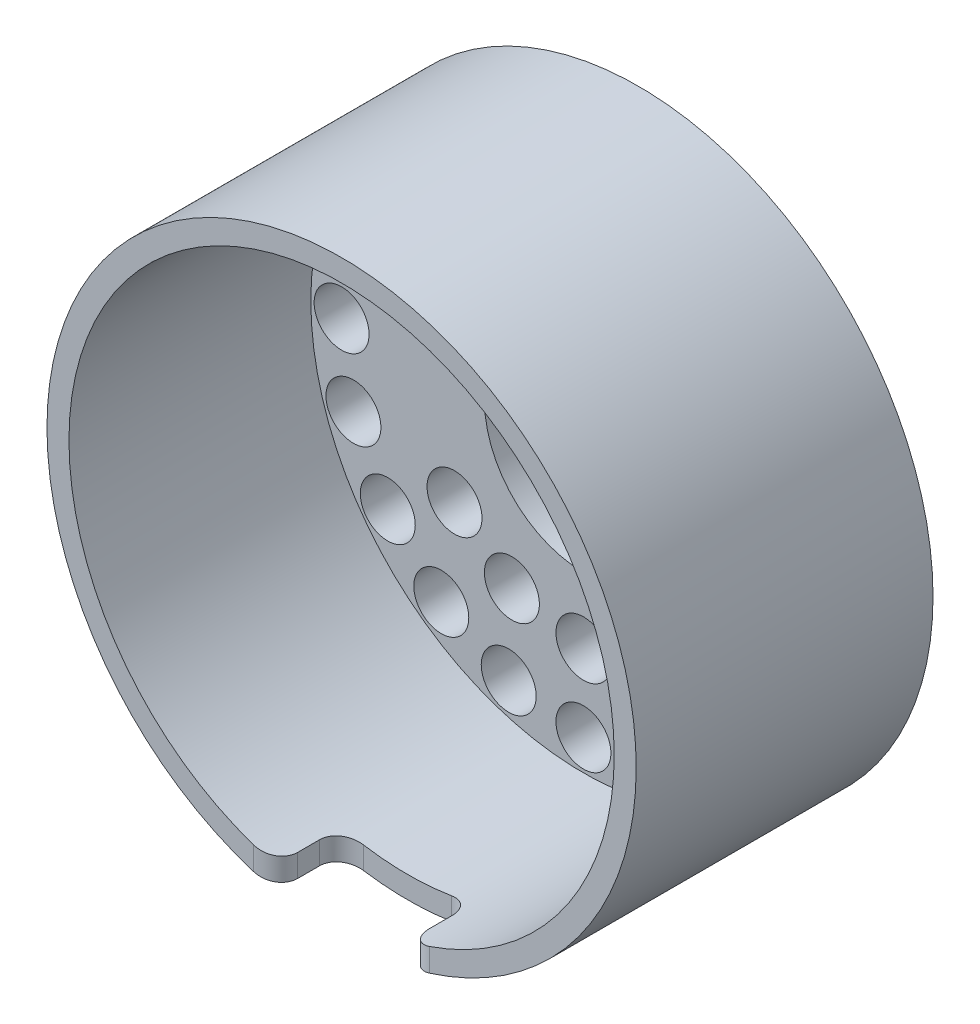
ISO-10303-21;
HEADER;
FILE_DESCRIPTION(('STEP AP214'),'2;1');
FILE_NAME('part.step','',(''),(''),'','','');
FILE_SCHEMA(('AUTOMOTIVE_DESIGN { 1 0 10303 214 1 1 1 1 }'));
ENDSEC;
DATA;
#1=APPLICATION_CONTEXT('core data for automotive mechanical design processes');
#2=APPLICATION_PROTOCOL_DEFINITION('international standard','automotive_design',2000,#1);
#3=PRODUCT_CONTEXT('',#1,'mechanical');
#4=PRODUCT('Part','Part','',(#3));
#5=PRODUCT_RELATED_PRODUCT_CATEGORY('part','',(#4));
#6=PRODUCT_DEFINITION_FORMATION('','',#4);
#7=PRODUCT_DEFINITION_CONTEXT('part definition',#1,'design');
#8=PRODUCT_DEFINITION('design','',#6,#7);
#9=PRODUCT_DEFINITION_SHAPE('','',#8);
#10=(LENGTH_UNIT() NAMED_UNIT(*) SI_UNIT(.MILLI.,.METRE.));
#11=(NAMED_UNIT(*) PLANE_ANGLE_UNIT() SI_UNIT($,.RADIAN.));
#12=(NAMED_UNIT(*) SI_UNIT($,.STERADIAN.) SOLID_ANGLE_UNIT());
#13=UNCERTAINTY_MEASURE_WITH_UNIT(LENGTH_MEASURE(1.E-05),#10,'distance_accuracy_value','');
#14=(GEOMETRIC_REPRESENTATION_CONTEXT(3) GLOBAL_UNCERTAINTY_ASSIGNED_CONTEXT((#13)) GLOBAL_UNIT_ASSIGNED_CONTEXT((#10,
#11,#12)) REPRESENTATION_CONTEXT('',''));
#15=CARTESIAN_POINT('',(0.,0.,0.));
#16=DIRECTION('',(0.,0.,1.));
#17=DIRECTION('',(1.,0.,0.));
#18=AXIS2_PLACEMENT_3D('',#15,#16,#17);
#19=CARTESIAN_POINT('',(0.,0.,6.35));
#20=DIRECTION('',(0.,0.,1.));
#21=DIRECTION('',(1.,0.,0.));
#22=AXIS2_PLACEMENT_3D('',#19,#20,#21);
#23=PLANE('',#22);
#24=CARTESIAN_POINT('',(-22.6039348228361,16.4227199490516,6.35));
#25=DIRECTION('',(0.,0.,1.));
#26=DIRECTION('',(1.,0.,0.));
#27=AXIS2_PLACEMENT_3D('',#24,#25,#26);
#28=CIRCLE('',#27,3.175);
#29=CARTESIAN_POINT('',(-19.4289348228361,16.4227199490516,6.35));
#30=VERTEX_POINT('',#29);
#31=EDGE_CURVE('E984',#30,#30,#28,.F.);
#32=ORIENTED_EDGE('',*,*,#31,.T.);
#33=EDGE_LOOP('',(#32));
#34=FACE_BOUND('',#33,.T.);
#35=CARTESIAN_POINT('',(-16.4227199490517,22.603934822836,6.35));
#36=DIRECTION('',(0.,0.,1.));
#37=DIRECTION('',(1.,0.,0.));
#38=AXIS2_PLACEMENT_3D('',#35,#36,#37);
#39=CIRCLE('',#38,3.175);
#40=CARTESIAN_POINT('',(-13.2477199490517,22.603934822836,6.35));
#41=VERTEX_POINT('',#40);
#42=EDGE_CURVE('E988',#41,#41,#39,.F.);
#43=ORIENTED_EDGE('',*,*,#42,.T.);
#44=EDGE_LOOP('',(#43));
#45=FACE_BOUND('',#44,.T.);
#46=CARTESIAN_POINT('',(-26.5725190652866,8.63393482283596,6.35));
#47=DIRECTION('',(0.,0.,1.));
#48=DIRECTION('',(1.,0.,0.));
#49=AXIS2_PLACEMENT_3D('',#46,#47,#48);
#50=CIRCLE('',#49,3.175);
#51=CARTESIAN_POINT('',(-23.3975190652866,8.63393482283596,6.35));
#52=VERTEX_POINT('',#51);
#53=EDGE_CURVE('E990',#52,#52,#50,.F.);
#54=ORIENTED_EDGE('',*,*,#53,.T.);
#55=EDGE_LOOP('',(#54));
#56=FACE_BOUND('',#55,.T.);
#57=CARTESIAN_POINT('',(-27.94,0.,6.35));
#58=DIRECTION('',(0.,0.,1.));
#59=DIRECTION('',(1.,0.,0.));
#60=AXIS2_PLACEMENT_3D('',#57,#58,#59);
#61=CIRCLE('',#60,3.175);
#62=CARTESIAN_POINT('',(-31.115,0.,6.35));
#63=VERTEX_POINT('',#62);
#64=EDGE_CURVE('E1000',#63,#63,#61,.F.);
#65=ORIENTED_EDGE('',*,*,#64,.T.);
#66=EDGE_LOOP('',(#65));
#67=FACE_BOUND('',#66,.T.);
#68=CARTESIAN_POINT('',(-8.63393482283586,-26.5725190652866,6.35));
#69=DIRECTION('',(0.,0.,1.));
#70=DIRECTION('',(1.,0.,0.));
#71=AXIS2_PLACEMENT_3D('',#68,#69,#70);
#72=CIRCLE('',#71,3.175);
#73=CARTESIAN_POINT('',(-11.8089348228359,-26.5725190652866,6.35));
#74=VERTEX_POINT('',#73);
#75=EDGE_CURVE('E1013',#74,#74,#72,.F.);
#76=ORIENTED_EDGE('',*,*,#75,.T.);
#77=EDGE_LOOP('',(#76));
#78=FACE_BOUND('',#77,.T.);
#79=CARTESIAN_POINT('',(-16.4227199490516,-22.6039348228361,6.35));
#80=DIRECTION('',(0.,0.,1.));
#81=DIRECTION('',(1.,0.,0.));
#82=AXIS2_PLACEMENT_3D('',#79,#80,#81);
#83=CIRCLE('',#82,3.175);
#84=CARTESIAN_POINT('',(-13.2477199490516,-22.6039348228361,6.35));
#85=VERTEX_POINT('',#84);
#86=EDGE_CURVE('E1012',#85,#85,#83,.F.);
#87=ORIENTED_EDGE('',*,*,#86,.T.);
#88=EDGE_LOOP('',(#87));
#89=FACE_BOUND('',#88,.T.);
#90=CARTESIAN_POINT('',(-22.603934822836,-16.4227199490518,6.35));
#91=DIRECTION('',(0.,0.,1.));
#92=DIRECTION('',(1.,0.,0.));
#93=AXIS2_PLACEMENT_3D('',#90,#91,#92);
#94=CIRCLE('',#93,3.175);
#95=CARTESIAN_POINT('',(-19.428934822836,-16.4227199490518,6.35));
#96=VERTEX_POINT('',#95);
#97=EDGE_CURVE('E1026',#96,#96,#94,.F.);
#98=ORIENTED_EDGE('',*,*,#97,.T.);
#99=EDGE_LOOP('',(#98));
#100=FACE_BOUND('',#99,.T.);
#101=CARTESIAN_POINT('',(-26.5725190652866,-8.63393482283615,6.35));
#102=DIRECTION('',(0.,0.,1.));
#103=DIRECTION('',(1.,0.,0.));
#104=AXIS2_PLACEMENT_3D('',#101,#102,#103);
#105=CIRCLE('',#104,3.175);
#106=CARTESIAN_POINT('',(-23.3975190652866,-8.63393482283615,6.35));
#107=VERTEX_POINT('',#106);
#108=EDGE_CURVE('E1006',#107,#107,#105,.F.);
#109=ORIENTED_EDGE('',*,*,#108,.T.);
#110=EDGE_LOOP('',(#109));
#111=FACE_BOUND('',#110,.T.);
#112=CARTESIAN_POINT('',(0.,-27.94,6.35));
#113=DIRECTION('',(0.,0.,1.));
#114=DIRECTION('',(1.,0.,0.));
#115=AXIS2_PLACEMENT_3D('',#112,#113,#114);
#116=CIRCLE('',#115,3.175);
#117=CARTESIAN_POINT('',(-3.175,-27.94,6.35));
#118=VERTEX_POINT('',#117);
#119=EDGE_CURVE('E1020',#118,#118,#116,.F.);
#120=ORIENTED_EDGE('',*,*,#119,.T.);
#121=EDGE_LOOP('',(#120));
#122=FACE_BOUND('',#121,.T.);
#123=CARTESIAN_POINT('',(8.63393482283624,-26.5725190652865,6.35));
#124=DIRECTION('',(0.,0.,1.));
#125=DIRECTION('',(1.,0.,0.));
#126=AXIS2_PLACEMENT_3D('',#123,#124,#125);
#127=CIRCLE('',#126,3.175);
#128=CARTESIAN_POINT('',(11.8089348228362,-26.5725190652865,6.35));
#129=VERTEX_POINT('',#128);
#130=EDGE_CURVE('E1036',#129,#129,#127,.F.);
#131=ORIENTED_EDGE('',*,*,#130,.T.);
#132=EDGE_LOOP('',(#131));
#133=FACE_BOUND('',#132,.T.);
#134=CARTESIAN_POINT('',(22.6039348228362,-16.4227199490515,6.35));
#135=DIRECTION('',(0.,0.,1.));
#136=DIRECTION('',(1.,0.,0.));
#137=AXIS2_PLACEMENT_3D('',#134,#135,#136);
#138=CIRCLE('',#137,3.175);
#139=CARTESIAN_POINT('',(25.7789348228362,-16.4227199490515,6.35));
#140=VERTEX_POINT('',#139);
#141=EDGE_CURVE('E1048',#140,#140,#138,.F.);
#142=ORIENTED_EDGE('',*,*,#141,.T.);
#143=EDGE_LOOP('',(#142));
#144=FACE_BOUND('',#143,.T.);
#145=CARTESIAN_POINT('',(16.4227199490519,-22.6039348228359,6.35));
#146=DIRECTION('',(0.,0.,1.));
#147=DIRECTION('',(1.,0.,0.));
#148=AXIS2_PLACEMENT_3D('',#145,#146,#147);
#149=CIRCLE('',#148,3.175);
#150=CARTESIAN_POINT('',(19.5977199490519,-22.6039348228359,6.35));
#151=VERTEX_POINT('',#150);
#152=EDGE_CURVE('E1042',#151,#151,#149,.F.);
#153=ORIENTED_EDGE('',*,*,#152,.T.);
#154=EDGE_LOOP('',(#153));
#155=FACE_BOUND('',#154,.T.);
#156=CARTESIAN_POINT('',(26.5725190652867,-8.63393482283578,6.35));
#157=DIRECTION('',(0.,0.,1.));
#158=DIRECTION('',(1.,0.,0.));
#159=AXIS2_PLACEMENT_3D('',#156,#157,#158);
#160=CIRCLE('',#159,3.175);
#161=CARTESIAN_POINT('',(23.3975190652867,-8.63393482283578,6.35));
#162=VERTEX_POINT('',#161);
#163=EDGE_CURVE('E1049',#162,#162,#160,.F.);
#164=ORIENTED_EDGE('',*,*,#163,.T.);
#165=EDGE_LOOP('',(#164));
#166=FACE_BOUND('',#165,.T.);
#167=CARTESIAN_POINT('',(27.94,2.92655965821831E-13,6.35));
#168=DIRECTION('',(0.,0.,1.));
#169=DIRECTION('',(1.,0.,0.));
#170=AXIS2_PLACEMENT_3D('',#167,#168,#169);
#171=CIRCLE('',#170,3.175);
#172=CARTESIAN_POINT('',(24.765,2.92655965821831E-13,6.35));
#173=VERTEX_POINT('',#172);
#174=EDGE_CURVE('E1060',#173,#173,#171,.F.);
#175=ORIENTED_EDGE('',*,*,#174,.T.);
#176=EDGE_LOOP('',(#175));
#177=FACE_BOUND('',#176,.T.);
#178=CARTESIAN_POINT('',(26.5725190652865,8.63393482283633,6.35));
#179=DIRECTION('',(0.,0.,1.));
#180=DIRECTION('',(1.,0.,0.));
#181=AXIS2_PLACEMENT_3D('',#178,#179,#180);
#182=CIRCLE('',#181,3.175);
#183=CARTESIAN_POINT('',(29.7475190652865,8.63393482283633,6.35));
#184=VERTEX_POINT('',#183);
#185=EDGE_CURVE('E1066',#184,#184,#182,.F.);
#186=ORIENTED_EDGE('',*,*,#185,.T.);
#187=EDGE_LOOP('',(#186));
#188=FACE_BOUND('',#187,.T.);
#189=CARTESIAN_POINT('',(22.6039348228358,16.422719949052,6.35));
#190=DIRECTION('',(0.,0.,1.));
#191=DIRECTION('',(1.,0.,0.));
#192=AXIS2_PLACEMENT_3D('',#189,#190,#191);
#193=CIRCLE('',#192,3.175);
#194=CARTESIAN_POINT('',(25.7789348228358,16.422719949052,6.35));
#195=VERTEX_POINT('',#194);
#196=EDGE_CURVE('E1072',#195,#195,#193,.F.);
#197=ORIENTED_EDGE('',*,*,#196,.T.);
#198=EDGE_LOOP('',(#197));
#199=FACE_BOUND('',#198,.T.);
#200=CARTESIAN_POINT('',(16.4227199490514,22.6039348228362,6.35));
#201=DIRECTION('',(0.,0.,1.));
#202=DIRECTION('',(1.,0.,0.));
#203=AXIS2_PLACEMENT_3D('',#200,#201,#202);
#204=CIRCLE('',#203,3.175);
#205=CARTESIAN_POINT('',(13.2477199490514,22.6039348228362,6.35));
#206=VERTEX_POINT('',#205);
#207=EDGE_CURVE('E1078',#206,#206,#204,.F.);
#208=ORIENTED_EDGE('',*,*,#207,.T.);
#209=EDGE_LOOP('',(#208));
#210=FACE_BOUND('',#209,.T.);
#211=CARTESIAN_POINT('',(8.63393482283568,26.5725190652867,6.35));
#212=DIRECTION('',(0.,0.,1.));
#213=DIRECTION('',(1.,0.,0.));
#214=AXIS2_PLACEMENT_3D('',#211,#212,#213);
#215=CIRCLE('',#214,3.175);
#216=CARTESIAN_POINT('',(5.45893482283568,26.5725190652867,6.35));
#217=VERTEX_POINT('',#216);
#218=EDGE_CURVE('E1254',#217,#217,#215,.F.);
#219=ORIENTED_EDGE('',*,*,#218,.T.);
#220=EDGE_LOOP('',(#219));
#221=FACE_BOUND('',#220,.T.);
#222=CARTESIAN_POINT('',(-8.63393482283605,26.5725190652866,6.35));
#223=DIRECTION('',(0.,0.,1.));
#224=DIRECTION('',(1.,0.,0.));
#225=AXIS2_PLACEMENT_3D('',#222,#223,#224);
#226=CIRCLE('',#225,3.175);
#227=CARTESIAN_POINT('',(-5.45893482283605,26.5725190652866,6.35));
#228=VERTEX_POINT('',#227);
#229=EDGE_CURVE('E1083',#228,#228,#226,.F.);
#230=ORIENTED_EDGE('',*,*,#229,.T.);
#231=EDGE_LOOP('',(#230));
#232=FACE_BOUND('',#231,.T.);
#233=CARTESIAN_POINT('',(0.,27.94,6.35));
#234=DIRECTION('',(0.,0.,1.));
#235=DIRECTION('',(1.,0.,0.));
#236=AXIS2_PLACEMENT_3D('',#233,#234,#235);
#237=CIRCLE('',#236,3.175);
#238=CARTESIAN_POINT('',(-3.175,27.94,6.35));
#239=VERTEX_POINT('',#238);
#240=EDGE_CURVE('E1089',#239,#239,#237,.F.);
#241=ORIENTED_EDGE('',*,*,#240,.T.);
#242=EDGE_LOOP('',(#241));
#243=FACE_BOUND('',#242,.T.);
#244=CARTESIAN_POINT('',(-8.26548523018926,17.1634569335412,6.35));
#245=DIRECTION('',(0.,0.,1.));
#246=DIRECTION('',(1.,0.,0.));
#247=AXIS2_PLACEMENT_3D('',#244,#245,#246);
#248=CIRCLE('',#247,3.175);
#249=CARTESIAN_POINT('',(-5.09048523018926,17.1634569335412,6.35));
#250=VERTEX_POINT('',#249);
#251=EDGE_CURVE('E1134',#250,#250,#248,.F.);
#252=ORIENTED_EDGE('',*,*,#251,.T.);
#253=EDGE_LOOP('',(#252));
#254=FACE_BOUND('',#253,.T.);
#255=CARTESIAN_POINT('',(-14.8938897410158,11.8774807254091,6.35));
#256=DIRECTION('',(0.,0.,1.));
#257=DIRECTION('',(1.,0.,0.));
#258=AXIS2_PLACEMENT_3D('',#255,#256,#257);
#259=CIRCLE('',#258,3.175);
#260=CARTESIAN_POINT('',(-11.7188897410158,11.8774807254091,6.35));
#261=VERTEX_POINT('',#260);
#262=EDGE_CURVE('E1128',#261,#261,#259,.F.);
#263=ORIENTED_EDGE('',*,*,#262,.T.);
#264=EDGE_LOOP('',(#263));
#265=FACE_BOUND('',#264,.T.);
#266=CARTESIAN_POINT('',(-14.8938897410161,-11.8774807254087,6.35));
#267=DIRECTION('',(0.,0.,1.));
#268=DIRECTION('',(1.,0.,0.));
#269=AXIS2_PLACEMENT_3D('',#266,#267,#268);
#270=CIRCLE('',#269,3.175);
#271=CARTESIAN_POINT('',(-11.7188897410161,-11.8774807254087,6.35));
#272=VERTEX_POINT('',#271);
#273=EDGE_CURVE('E1122',#272,#272,#270,.F.);
#274=ORIENTED_EDGE('',*,*,#273,.T.);
#275=EDGE_LOOP('',(#274));
#276=FACE_BOUND('',#275,.T.);
#277=CARTESIAN_POINT('',(-8.26548523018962,-17.163456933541,6.35));
#278=DIRECTION('',(0.,0.,1.));
#279=DIRECTION('',(1.,0.,0.));
#280=AXIS2_PLACEMENT_3D('',#277,#278,#279);
#281=CIRCLE('',#280,3.175);
#282=CARTESIAN_POINT('',(-11.4404852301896,-17.163456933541,6.35));
#283=VERTEX_POINT('',#282);
#284=EDGE_CURVE('E1116',#283,#283,#281,.F.);
#285=ORIENTED_EDGE('',*,*,#284,.T.);
#286=EDGE_LOOP('',(#285));
#287=FACE_BOUND('',#286,.T.);
#288=CARTESIAN_POINT('',(0.,-19.05,6.35));
#289=DIRECTION('',(0.,0.,1.));
#290=DIRECTION('',(1.,0.,0.));
#291=AXIS2_PLACEMENT_3D('',#288,#289,#290);
#292=CIRCLE('',#291,3.175);
#293=CARTESIAN_POINT('',(-3.175,-19.05,6.35));
#294=VERTEX_POINT('',#293);
#295=EDGE_CURVE('E1110',#294,#294,#292,.F.);
#296=ORIENTED_EDGE('',*,*,#295,.T.);
#297=EDGE_LOOP('',(#296));
#298=FACE_BOUND('',#297,.T.);
#299=CARTESIAN_POINT('',(8.26548523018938,-17.1634569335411,6.35));
#300=DIRECTION('',(0.,0.,1.));
#301=DIRECTION('',(1.,0.,0.));
#302=AXIS2_PLACEMENT_3D('',#299,#300,#301);
#303=CIRCLE('',#302,3.175);
#304=CARTESIAN_POINT('',(11.4404852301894,-17.1634569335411,6.35));
#305=VERTEX_POINT('',#304);
#306=EDGE_CURVE('E1104',#305,#305,#303,.F.);
#307=ORIENTED_EDGE('',*,*,#306,.T.);
#308=EDGE_LOOP('',(#307));
#309=FACE_BOUND('',#308,.T.);
#310=CARTESIAN_POINT('',(14.8938897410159,-11.8774807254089,6.35));
#311=DIRECTION('',(0.,0.,1.));
#312=DIRECTION('',(1.,0.,0.));
#313=AXIS2_PLACEMENT_3D('',#310,#311,#312);
#314=CIRCLE('',#313,3.175);
#315=CARTESIAN_POINT('',(18.0688897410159,-11.8774807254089,6.35));
#316=VERTEX_POINT('',#315);
#317=EDGE_CURVE('E1097',#316,#316,#314,.F.);
#318=ORIENTED_EDGE('',*,*,#317,.T.);
#319=EDGE_LOOP('',(#318));
#320=FACE_BOUND('',#319,.T.);
#321=CARTESIAN_POINT('',(14.893889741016,11.8774807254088,6.35));
#322=DIRECTION('',(0.,0.,1.));
#323=DIRECTION('',(1.,0.,0.));
#324=AXIS2_PLACEMENT_3D('',#321,#322,#323);
#325=CIRCLE('',#324,3.175);
#326=CARTESIAN_POINT('',(18.068889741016,11.8774807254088,6.35));
#327=VERTEX_POINT('',#326);
#328=EDGE_CURVE('E1096',#327,#327,#325,.F.);
#329=ORIENTED_EDGE('',*,*,#328,.T.);
#330=EDGE_LOOP('',(#329));
#331=FACE_BOUND('',#330,.T.);
#332=CARTESIAN_POINT('',(8.2654852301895,17.1634569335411,6.35));
#333=DIRECTION('',(0.,0.,1.));
#334=DIRECTION('',(1.,0.,0.));
#335=AXIS2_PLACEMENT_3D('',#332,#333,#334);
#336=CIRCLE('',#335,3.175);
#337=CARTESIAN_POINT('',(11.4404852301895,17.1634569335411,6.35));
#338=VERTEX_POINT('',#337);
#339=EDGE_CURVE('E1143',#338,#338,#336,.F.);
#340=ORIENTED_EDGE('',*,*,#339,.T.);
#341=EDGE_LOOP('',(#340));
#342=FACE_BOUND('',#341,.T.);
#343=CARTESIAN_POINT('',(0.,19.05,6.35));
#344=DIRECTION('',(0.,0.,1.));
#345=DIRECTION('',(1.,0.,0.));
#346=AXIS2_PLACEMENT_3D('',#343,#344,#345);
#347=CIRCLE('',#346,3.175);
#348=CARTESIAN_POINT('',(-3.175,19.05,6.35));
#349=VERTEX_POINT('',#348);
#350=EDGE_CURVE('E1149',#349,#349,#347,.F.);
#351=ORIENTED_EDGE('',*,*,#350,.T.);
#352=EDGE_LOOP('',(#351));
#353=FACE_BOUND('',#352,.T.);
#354=CARTESIAN_POINT('',(0.,0.,6.35));
#355=DIRECTION('',(0.,0.,1.));
#356=DIRECTION('',(1.,0.,0.));
#357=AXIS2_PLACEMENT_3D('',#354,#355,#356);
#358=CIRCLE('',#357,11.43);
#359=CARTESIAN_POINT('',(11.43,0.,6.35));
#360=VERTEX_POINT('',#359);
#361=EDGE_CURVE('E234',#360,#360,#358,.T.);
#362=ORIENTED_EDGE('',*,*,#361,.F.);
#363=EDGE_LOOP('',(#362));
#364=FACE_BOUND('',#363,.T.);
#365=CARTESIAN_POINT('',(0.,0.,6.35));
#366=DIRECTION('',(0.,0.,1.));
#367=DIRECTION('',(1.,0.,0.));
#368=AXIS2_PLACEMENT_3D('',#365,#366,#367);
#369=CIRCLE('',#368,31.496);
#370=CARTESIAN_POINT('',(31.496,0.,6.35));
#371=VERTEX_POINT('',#370);
#372=EDGE_CURVE('E240',#371,#371,#369,.F.);
#373=ORIENTED_EDGE('',*,*,#372,.F.);
#374=EDGE_LOOP('',(#373));
#375=FACE_BOUND('',#374,.T.);
#376=ADVANCED_FACE('F35',(#34,#45,#56,#67,#78,#89,#100,#111,#122,#133,#144,#155,#166,#177,#188,
#199,#210,#221,#232,#243,#254,#265,#276,#287,#298,#309,#320,#331,#342,#353,#364,#375),#23,.T.);
#377=CARTESIAN_POINT('',(0.,0.,0.));
#378=DIRECTION('',(0.,0.,1.));
#379=DIRECTION('',(1.,0.,0.));
#380=AXIS2_PLACEMENT_3D('',#377,#378,#379);
#381=PLANE('',#380);
#382=CARTESIAN_POINT('',(-22.6039348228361,16.4227199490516,0.));
#383=DIRECTION('',(0.,0.,-1.));
#384=DIRECTION('',(-0.587785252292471,-0.809016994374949,0.));
#385=AXIS2_PLACEMENT_3D('',#382,#383,#384);
#386=CIRCLE('',#385,3.175);
#387=CARTESIAN_POINT('',(-24.4701529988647,13.8540909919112,0.));
#388=VERTEX_POINT('',#387);
#389=EDGE_CURVE('E982',#388,#388,#386,.T.);
#390=ORIENTED_EDGE('',*,*,#389,.F.);
#391=EDGE_LOOP('',(#390));
#392=FACE_BOUND('',#391,.T.);
#393=CARTESIAN_POINT('',(-16.4227199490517,22.603934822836,0.));
#394=DIRECTION('',(0.,0.,-1.));
#395=DIRECTION('',(-0.809016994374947,-0.587785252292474,0.));
#396=AXIS2_PLACEMENT_3D('',#393,#394,#395);
#397=CIRCLE('',#396,3.175);
#398=CARTESIAN_POINT('',(-18.9913489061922,20.7377166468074,0.));
#399=VERTEX_POINT('',#398);
#400=EDGE_CURVE('E985',#399,#399,#397,.T.);
#401=ORIENTED_EDGE('',*,*,#400,.F.);
#402=EDGE_LOOP('',(#401));
#403=FACE_BOUND('',#402,.T.);
#404=CARTESIAN_POINT('',(-26.5725190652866,8.63393482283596,0.));
#405=DIRECTION('',(0.,0.,-1.));
#406=DIRECTION('',(-0.309016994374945,-0.951056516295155,0.));
#407=AXIS2_PLACEMENT_3D('',#404,#405,#406);
#408=CIRCLE('',#407,3.175);
#409=CARTESIAN_POINT('',(-27.5536480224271,5.61433038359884,0.));
#410=VERTEX_POINT('',#409);
#411=EDGE_CURVE('E997',#410,#410,#408,.T.);
#412=ORIENTED_EDGE('',*,*,#411,.F.);
#413=EDGE_LOOP('',(#412));
#414=FACE_BOUND('',#413,.T.);
#415=CARTESIAN_POINT('',(-27.94,0.,0.));
#416=DIRECTION('',(0.,0.,-1.));
#417=DIRECTION('',(0.,-1.,0.));
#418=AXIS2_PLACEMENT_3D('',#415,#416,#417);
#419=CIRCLE('',#418,3.175);
#420=CARTESIAN_POINT('',(-31.115,0.,0.));
#421=VERTEX_POINT('',#420);
#422=EDGE_CURVE('E1003',#421,#421,#419,.T.);
#423=ORIENTED_EDGE('',*,*,#422,.F.);
#424=EDGE_LOOP('',(#423));
#425=FACE_BOUND('',#424,.T.);
#426=CARTESIAN_POINT('',(-8.63393482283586,-26.5725190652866,0.));
#427=DIRECTION('',(0.,0.,-1.));
#428=DIRECTION('',(0.951056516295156,-0.309016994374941,0.));
#429=AXIS2_PLACEMENT_3D('',#426,#427,#428);
#430=CIRCLE('',#429,3.175);
#431=CARTESIAN_POINT('',(-11.8089348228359,-26.5725190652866,0.));
#432=VERTEX_POINT('',#431);
#433=EDGE_CURVE('E1017',#432,#432,#430,.T.);
#434=ORIENTED_EDGE('',*,*,#433,.F.);
#435=EDGE_LOOP('',(#434));
#436=FACE_BOUND('',#435,.T.);
#437=CARTESIAN_POINT('',(-16.4227199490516,-22.6039348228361,0.));
#438=DIRECTION('',(0.,0.,-1.));
#439=DIRECTION('',(0.809016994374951,-0.587785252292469,0.));
#440=AXIS2_PLACEMENT_3D('',#437,#438,#439);
#441=CIRCLE('',#440,3.175);
#442=CARTESIAN_POINT('',(-13.8540909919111,-24.4701529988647,0.));
#443=VERTEX_POINT('',#442);
#444=EDGE_CURVE('E1009',#443,#443,#441,.T.);
#445=ORIENTED_EDGE('',*,*,#444,.F.);
#446=EDGE_LOOP('',(#445));
#447=FACE_BOUND('',#446,.T.);
#448=CARTESIAN_POINT('',(-22.603934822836,-16.4227199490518,0.));
#449=DIRECTION('',(0.,0.,-1.));
#450=DIRECTION('',(0.587785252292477,-0.809016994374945,0.));
#451=AXIS2_PLACEMENT_3D('',#448,#449,#450);
#452=CIRCLE('',#451,3.175);
#453=CARTESIAN_POINT('',(-20.7377166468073,-18.9913489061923,0.));
#454=VERTEX_POINT('',#453);
#455=EDGE_CURVE('E1016',#454,#454,#452,.T.);
#456=ORIENTED_EDGE('',*,*,#455,.F.);
#457=EDGE_LOOP('',(#456));
#458=FACE_BOUND('',#457,.T.);
#459=CARTESIAN_POINT('',(-26.5725190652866,-8.63393482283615,0.));
#460=DIRECTION('',(0.,0.,-1.));
#461=DIRECTION('',(0.309016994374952,-0.951056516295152,0.));
#462=AXIS2_PLACEMENT_3D('',#459,#460,#461);
#463=CIRCLE('',#462,3.175);
#464=CARTESIAN_POINT('',(-25.5913901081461,-11.6535392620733,0.));
#465=VERTEX_POINT('',#464);
#466=EDGE_CURVE('E1023',#465,#465,#463,.T.);
#467=ORIENTED_EDGE('',*,*,#466,.F.);
#468=EDGE_LOOP('',(#467));
#469=FACE_BOUND('',#468,.T.);
#470=CARTESIAN_POINT('',(0.,-27.94,0.));
#471=DIRECTION('',(0.,0.,-1.));
#472=DIRECTION('',(1.,0.,0.));
#473=AXIS2_PLACEMENT_3D('',#470,#471,#472);
#474=CIRCLE('',#473,3.175);
#475=CARTESIAN_POINT('',(-3.175,-27.94,0.));
#476=VERTEX_POINT('',#475);
#477=EDGE_CURVE('E1033',#476,#476,#474,.T.);
#478=ORIENTED_EDGE('',*,*,#477,.F.);
#479=EDGE_LOOP('',(#478));
#480=FACE_BOUND('',#479,.T.);
#481=CARTESIAN_POINT('',(8.63393482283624,-26.5725190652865,0.));
#482=DIRECTION('',(0.,0.,-1.));
#483=DIRECTION('',(0.951056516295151,0.309016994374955,0.));
#484=AXIS2_PLACEMENT_3D('',#481,#482,#483);
#485=CIRCLE('',#484,3.175);
#486=CARTESIAN_POINT('',(11.6535392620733,-25.591390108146,0.));
#487=VERTEX_POINT('',#486);
#488=EDGE_CURVE('E1039',#487,#487,#485,.T.);
#489=ORIENTED_EDGE('',*,*,#488,.F.);
#490=EDGE_LOOP('',(#489));
#491=FACE_BOUND('',#490,.T.);
#492=CARTESIAN_POINT('',(22.6039348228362,-16.4227199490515,0.));
#493=DIRECTION('',(0.,0.,-1.));
#494=DIRECTION('',(0.587785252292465,0.809016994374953,0.));
#495=AXIS2_PLACEMENT_3D('',#492,#493,#494);
#496=CIRCLE('',#495,3.175);
#497=CARTESIAN_POINT('',(24.4701529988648,-13.854090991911,0.));
#498=VERTEX_POINT('',#497);
#499=EDGE_CURVE('E1045',#498,#498,#496,.T.);
#500=ORIENTED_EDGE('',*,*,#499,.F.);
#501=EDGE_LOOP('',(#500));
#502=FACE_BOUND('',#501,.T.);
#503=CARTESIAN_POINT('',(16.4227199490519,-22.6039348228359,0.));
#504=DIRECTION('',(0.,0.,-1.));
#505=DIRECTION('',(0.809016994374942,0.58778525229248,0.));
#506=AXIS2_PLACEMENT_3D('',#503,#504,#505);
#507=CIRCLE('',#506,3.175);
#508=CARTESIAN_POINT('',(18.9913489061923,-20.7377166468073,0.));
#509=VERTEX_POINT('',#508);
#510=EDGE_CURVE('E1052',#509,#509,#507,.T.);
#511=ORIENTED_EDGE('',*,*,#510,.F.);
#512=EDGE_LOOP('',(#511));
#513=FACE_BOUND('',#512,.T.);
#514=CARTESIAN_POINT('',(26.5725190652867,-8.63393482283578,0.));
#515=DIRECTION('',(0.,0.,-1.));
#516=DIRECTION('',(0.309016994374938,0.951056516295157,0.));
#517=AXIS2_PLACEMENT_3D('',#514,#515,#516);
#518=CIRCLE('',#517,3.175);
#519=CARTESIAN_POINT('',(23.3975190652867,-8.63393482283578,0.));
#520=VERTEX_POINT('',#519);
#521=EDGE_CURVE('E1057',#520,#520,#518,.T.);
#522=ORIENTED_EDGE('',*,*,#521,.F.);
#523=EDGE_LOOP('',(#522));
#524=FACE_BOUND('',#523,.T.);
#525=CARTESIAN_POINT('',(27.94,2.92655965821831E-13,0.));
#526=DIRECTION('',(0.,0.,-1.));
#527=DIRECTION('',(0.,1.,0.));
#528=AXIS2_PLACEMENT_3D('',#525,#526,#527);
#529=CIRCLE('',#528,3.175);
#530=CARTESIAN_POINT('',(24.765,2.92655965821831E-13,0.));
#531=VERTEX_POINT('',#530);
#532=EDGE_CURVE('E1063',#531,#531,#529,.T.);
#533=ORIENTED_EDGE('',*,*,#532,.F.);
#534=EDGE_LOOP('',(#533));
#535=FACE_BOUND('',#534,.T.);
#536=CARTESIAN_POINT('',(26.5725190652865,8.63393482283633,0.));
#537=DIRECTION('',(0.,0.,-1.));
#538=DIRECTION('',(-0.309016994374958,0.95105651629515,0.));
#539=AXIS2_PLACEMENT_3D('',#536,#537,#538);
#540=CIRCLE('',#539,3.175);
#541=CARTESIAN_POINT('',(25.591390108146,11.6535392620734,0.));
#542=VERTEX_POINT('',#541);
#543=EDGE_CURVE('E1069',#542,#542,#540,.T.);
#544=ORIENTED_EDGE('',*,*,#543,.F.);
#545=EDGE_LOOP('',(#544));
#546=FACE_BOUND('',#545,.T.);
#547=CARTESIAN_POINT('',(22.6039348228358,16.422719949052,0.));
#548=DIRECTION('',(0.,0.,-1.));
#549=DIRECTION('',(-0.587785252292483,0.80901699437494,0.));
#550=AXIS2_PLACEMENT_3D('',#547,#548,#549);
#551=CIRCLE('',#550,3.175);
#552=CARTESIAN_POINT('',(20.7377166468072,18.9913489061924,0.));
#553=VERTEX_POINT('',#552);
#554=EDGE_CURVE('E1075',#553,#553,#551,.T.);
#555=ORIENTED_EDGE('',*,*,#554,.F.);
#556=EDGE_LOOP('',(#555));
#557=FACE_BOUND('',#556,.T.);
#558=CARTESIAN_POINT('',(16.4227199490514,22.6039348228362,0.));
#559=DIRECTION('',(0.,0.,-1.));
#560=DIRECTION('',(-0.809016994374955,0.587785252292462,0.));
#561=AXIS2_PLACEMENT_3D('',#558,#559,#560);
#562=CIRCLE('',#561,3.175);
#563=CARTESIAN_POINT('',(13.2477199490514,22.6039348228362,0.));
#564=VERTEX_POINT('',#563);
#565=EDGE_CURVE('E1256',#564,#564,#562,.T.);
#566=ORIENTED_EDGE('',*,*,#565,.F.);
#567=EDGE_LOOP('',(#566));
#568=FACE_BOUND('',#567,.T.);
#569=CARTESIAN_POINT('',(8.63393482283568,26.5725190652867,0.));
#570=DIRECTION('',(0.,0.,-1.));
#571=DIRECTION('',(-0.951056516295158,0.309016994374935,0.));
#572=AXIS2_PLACEMENT_3D('',#569,#570,#571);
#573=CIRCLE('',#572,3.175);
#574=CARTESIAN_POINT('',(5.45893482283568,26.5725190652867,0.));
#575=VERTEX_POINT('',#574);
#576=EDGE_CURVE('E1257',#575,#575,#573,.T.);
#577=ORIENTED_EDGE('',*,*,#576,.F.);
#578=EDGE_LOOP('',(#577));
#579=FACE_BOUND('',#578,.T.);
#580=CARTESIAN_POINT('',(-8.63393482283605,26.5725190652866,0.));
#581=DIRECTION('',(0.,0.,-1.));
#582=DIRECTION('',(-0.951056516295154,-0.309016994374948,0.));
#583=AXIS2_PLACEMENT_3D('',#580,#581,#582);
#584=CIRCLE('',#583,3.175);
#585=CARTESIAN_POINT('',(-11.6535392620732,25.5913901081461,0.));
#586=VERTEX_POINT('',#585);
#587=EDGE_CURVE('E996',#586,#586,#584,.T.);
#588=ORIENTED_EDGE('',*,*,#587,.F.);
#589=EDGE_LOOP('',(#588));
#590=FACE_BOUND('',#589,.T.);
#591=CARTESIAN_POINT('',(0.,27.94,0.));
#592=DIRECTION('',(0.,0.,-1.));
#593=DIRECTION('',(-1.,0.,0.));
#594=AXIS2_PLACEMENT_3D('',#591,#592,#593);
#595=CIRCLE('',#594,3.175);
#596=CARTESIAN_POINT('',(-3.175,27.94,0.));
#597=VERTEX_POINT('',#596);
#598=EDGE_CURVE('E1086',#597,#597,#595,.T.);
#599=ORIENTED_EDGE('',*,*,#598,.F.);
#600=EDGE_LOOP('',(#599));
#601=FACE_BOUND('',#600,.T.);
#602=CARTESIAN_POINT('',(-8.26548523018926,17.1634569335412,0.));
#603=DIRECTION('',(0.,0.,-1.));
#604=DIRECTION('',(-0.900968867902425,-0.433883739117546,0.));
#605=AXIS2_PLACEMENT_3D('',#602,#603,#604);
#606=CIRCLE('',#605,3.175);
#607=CARTESIAN_POINT('',(-11.1260613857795,15.785876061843,0.));
#608=VERTEX_POINT('',#607);
#609=EDGE_CURVE('E1092',#608,#608,#606,.T.);
#610=ORIENTED_EDGE('',*,*,#609,.F.);
#611=EDGE_LOOP('',(#610));
#612=FACE_BOUND('',#611,.T.);
#613=CARTESIAN_POINT('',(-14.8938897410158,11.8774807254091,0.));
#614=DIRECTION('',(0.,0.,-1.));
#615=DIRECTION('',(-0.623489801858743,-0.781831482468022,0.));
#616=AXIS2_PLACEMENT_3D('',#613,#614,#615);
#617=CIRCLE('',#616,3.175);
#618=CARTESIAN_POINT('',(-16.8734698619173,9.39516576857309,0.));
#619=VERTEX_POINT('',#618);
#620=EDGE_CURVE('E1131',#619,#619,#617,.T.);
#621=ORIENTED_EDGE('',*,*,#620,.F.);
#622=EDGE_LOOP('',(#621));
#623=FACE_BOUND('',#622,.T.);
#624=CARTESIAN_POINT('',(-14.8938897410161,-11.8774807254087,0.));
#625=DIRECTION('',(0.,0.,-1.));
#626=DIRECTION('',(0.623489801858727,-0.781831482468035,0.));
#627=AXIS2_PLACEMENT_3D('',#624,#625,#626);
#628=CIRCLE('',#627,3.175);
#629=CARTESIAN_POINT('',(-12.9143096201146,-14.3597956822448,0.));
#630=VERTEX_POINT('',#629);
#631=EDGE_CURVE('E1125',#630,#630,#628,.T.);
#632=ORIENTED_EDGE('',*,*,#631,.F.);
#633=EDGE_LOOP('',(#632));
#634=FACE_BOUND('',#633,.T.);
#635=CARTESIAN_POINT('',(-8.26548523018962,-17.163456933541,0.));
#636=DIRECTION('',(0.,0.,-1.));
#637=DIRECTION('',(0.900968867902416,-0.433883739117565,0.));
#638=AXIS2_PLACEMENT_3D('',#635,#636,#637);
#639=CIRCLE('',#638,3.175);
#640=CARTESIAN_POINT('',(-11.4404852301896,-17.163456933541,0.));
#641=VERTEX_POINT('',#640);
#642=EDGE_CURVE('E1119',#641,#641,#639,.T.);
#643=ORIENTED_EDGE('',*,*,#642,.F.);
#644=EDGE_LOOP('',(#643));
#645=FACE_BOUND('',#644,.T.);
#646=CARTESIAN_POINT('',(0.,-19.05,0.));
#647=DIRECTION('',(0.,0.,-1.));
#648=DIRECTION('',(1.,0.,0.));
#649=AXIS2_PLACEMENT_3D('',#646,#647,#648);
#650=CIRCLE('',#649,3.175);
#651=CARTESIAN_POINT('',(-3.175,-19.05,0.));
#652=VERTEX_POINT('',#651);
#653=EDGE_CURVE('E1113',#652,#652,#650,.T.);
#654=ORIENTED_EDGE('',*,*,#653,.F.);
#655=EDGE_LOOP('',(#654));
#656=FACE_BOUND('',#655,.T.);
#657=CARTESIAN_POINT('',(8.26548523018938,-17.1634569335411,0.));
#658=DIRECTION('',(0.,0.,-1.));
#659=DIRECTION('',(0.900968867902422,0.433883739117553,0.));
#660=AXIS2_PLACEMENT_3D('',#657,#658,#659);
#661=CIRCLE('',#660,3.175);
#662=CARTESIAN_POINT('',(11.1260613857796,-15.7858760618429,0.));
#663=VERTEX_POINT('',#662);
#664=EDGE_CURVE('E1107',#663,#663,#661,.T.);
#665=ORIENTED_EDGE('',*,*,#664,.F.);
#666=EDGE_LOOP('',(#665));
#667=FACE_BOUND('',#666,.T.);
#668=CARTESIAN_POINT('',(14.8938897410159,-11.8774807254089,0.));
#669=DIRECTION('',(0.,0.,-1.));
#670=DIRECTION('',(0.623489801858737,0.781831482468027,0.));
#671=AXIS2_PLACEMENT_3D('',#668,#669,#670);
#672=CIRCLE('',#671,3.175);
#673=CARTESIAN_POINT('',(16.8734698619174,-9.39516576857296,0.));
#674=VERTEX_POINT('',#673);
#675=EDGE_CURVE('E1101',#674,#674,#672,.T.);
#676=ORIENTED_EDGE('',*,*,#675,.F.);
#677=EDGE_LOOP('',(#676));
#678=FACE_BOUND('',#677,.T.);
#679=CARTESIAN_POINT('',(14.893889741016,11.8774807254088,0.));
#680=DIRECTION('',(0.,0.,-1.));
#681=DIRECTION('',(-0.623489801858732,0.781831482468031,0.));
#682=AXIS2_PLACEMENT_3D('',#679,#680,#681);
#683=CIRCLE('',#682,3.175);
#684=CARTESIAN_POINT('',(12.9143096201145,14.3597956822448,0.));
#685=VERTEX_POINT('',#684);
#686=EDGE_CURVE('E1093',#685,#685,#683,.T.);
#687=ORIENTED_EDGE('',*,*,#686,.F.);
#688=EDGE_LOOP('',(#687));
#689=FACE_BOUND('',#688,.T.);
#690=CARTESIAN_POINT('',(8.2654852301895,17.1634569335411,0.));
#691=DIRECTION('',(0.,0.,-1.));
#692=DIRECTION('',(-0.900968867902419,0.433883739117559,0.));
#693=AXIS2_PLACEMENT_3D('',#690,#691,#692);
#694=CIRCLE('',#693,3.175);
#695=CARTESIAN_POINT('',(5.40490907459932,18.5410378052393,0.));
#696=VERTEX_POINT('',#695);
#697=EDGE_CURVE('E1100',#696,#696,#694,.T.);
#698=ORIENTED_EDGE('',*,*,#697,.F.);
#699=EDGE_LOOP('',(#698));
#700=FACE_BOUND('',#699,.T.);
#701=CARTESIAN_POINT('',(0.,19.05,0.));
#702=DIRECTION('',(0.,0.,-1.));
#703=DIRECTION('',(-1.,0.,0.));
#704=AXIS2_PLACEMENT_3D('',#701,#702,#703);
#705=CIRCLE('',#704,3.175);
#706=CARTESIAN_POINT('',(-3.175,19.05,0.));
#707=VERTEX_POINT('',#706);
#708=EDGE_CURVE('E1146',#707,#707,#705,.T.);
#709=ORIENTED_EDGE('',*,*,#708,.F.);
#710=EDGE_LOOP('',(#709));
#711=FACE_BOUND('',#710,.T.);
#712=CARTESIAN_POINT('',(0.,0.,0.));
#713=DIRECTION('',(0.,0.,1.));
#714=DIRECTION('',(1.,0.,0.));
#715=AXIS2_PLACEMENT_3D('',#712,#713,#714);
#716=CIRCLE('',#715,13.97);
#717=CARTESIAN_POINT('',(13.97,0.,0.));
#718=VERTEX_POINT('',#717);
#719=EDGE_CURVE('E277',#718,#718,#716,.T.);
#720=ORIENTED_EDGE('',*,*,#719,.T.);
#721=EDGE_LOOP('',(#720));
#722=FACE_BOUND('',#721,.T.);
#723=DIRECTION('',(0.,1.,0.));
#724=VECTOR('',#723,1.);
#725=CARTESIAN_POINT('',(-20.828,3.3655,0.));
#726=LINE('',#725,#724);
#727=CARTESIAN_POINT('',(-20.828,-3.3655,0.));
#728=VERTEX_POINT('',#727);
#729=CARTESIAN_POINT('',(-20.828,3.3655,0.));
#730=VERTEX_POINT('',#729);
#731=EDGE_CURVE('E214',#728,#730,#726,.T.);
#732=ORIENTED_EDGE('',*,*,#731,.F.);
#733=DIRECTION('',(-1.,0.,0.));
#734=VECTOR('',#733,1.);
#735=CARTESIAN_POINT('',(-14.097,-3.3655,0.));
#736=LINE('',#735,#734);
#737=CARTESIAN_POINT('',(-14.097,-3.3655,0.));
#738=VERTEX_POINT('',#737);
#739=EDGE_CURVE('E223',#738,#728,#736,.T.);
#740=ORIENTED_EDGE('',*,*,#739,.F.);
#741=DIRECTION('',(0.,-1.,0.));
#742=VECTOR('',#741,1.);
#743=CARTESIAN_POINT('',(-14.097,3.3655,0.));
#744=LINE('',#743,#742);
#745=CARTESIAN_POINT('',(-14.097,3.3655,0.));
#746=VERTEX_POINT('',#745);
#747=EDGE_CURVE('E220',#746,#738,#744,.T.);
#748=ORIENTED_EDGE('',*,*,#747,.F.);
#749=DIRECTION('',(1.,0.,0.));
#750=VECTOR('',#749,1.);
#751=CARTESIAN_POINT('',(-14.097,3.3655,0.));
#752=LINE('',#751,#750);
#753=EDGE_CURVE('E217',#730,#746,#752,.T.);
#754=ORIENTED_EDGE('',*,*,#753,.F.);
#755=EDGE_LOOP('',(#732,#740,#748,#754));
#756=FACE_BOUND('',#755,.T.);
#757=CARTESIAN_POINT('',(0.,0.,0.));
#758=DIRECTION('',(0.,0.,1.));
#759=DIRECTION('',(1.,0.,0.));
#760=AXIS2_PLACEMENT_3D('',#757,#758,#759);
#761=CIRCLE('',#760,34.036);
#762=CARTESIAN_POINT('',(34.036,0.,0.));
#763=VERTEX_POINT('',#762);
#764=EDGE_CURVE('E237',#763,#763,#761,.T.);
#765=ORIENTED_EDGE('',*,*,#764,.F.);
#766=EDGE_LOOP('',(#765));
#767=FACE_BOUND('',#766,.T.);
#768=DIRECTION('',(0.,1.,0.));
#769=VECTOR('',#768,1.);
#770=CARTESIAN_POINT('',(14.097,3.3655,0.));
#771=LINE('',#770,#769);
#772=CARTESIAN_POINT('',(14.097,-3.3655,0.));
#773=VERTEX_POINT('',#772);
#774=CARTESIAN_POINT('',(14.097,3.3655,0.));
#775=VERTEX_POINT('',#774);
#776=EDGE_CURVE('E182',#773,#775,#771,.T.);
#777=ORIENTED_EDGE('',*,*,#776,.F.);
#778=DIRECTION('',(-1.,0.,0.));
#779=VECTOR('',#778,1.);
#780=CARTESIAN_POINT('',(14.097,-3.3655,0.));
#781=LINE('',#780,#779);
#782=CARTESIAN_POINT('',(20.828,-3.3655,0.));
#783=VERTEX_POINT('',#782);
#784=EDGE_CURVE('E190',#783,#773,#781,.T.);
#785=ORIENTED_EDGE('',*,*,#784,.F.);
#786=DIRECTION('',(0.,-1.,0.));
#787=VECTOR('',#786,1.);
#788=CARTESIAN_POINT('',(20.828,3.3655,0.));
#789=LINE('',#788,#787);
#790=CARTESIAN_POINT('',(20.828,3.3655,0.));
#791=VERTEX_POINT('',#790);
#792=EDGE_CURVE('E204',#791,#783,#789,.T.);
#793=ORIENTED_EDGE('',*,*,#792,.F.);
#794=DIRECTION('',(1.,0.,0.));
#795=VECTOR('',#794,1.);
#796=CARTESIAN_POINT('',(14.097,3.3655,0.));
#797=LINE('',#796,#795);
#798=EDGE_CURVE('E199',#775,#791,#797,.T.);
#799=ORIENTED_EDGE('',*,*,#798,.F.);
#800=EDGE_LOOP('',(#777,#785,#793,#799));
#801=FACE_BOUND('',#800,.T.);
#802=ADVANCED_FACE('F195',(#392,#403,#414,#425,#436,#447,#458,#469,#480,#491,#502,#513,#524,
#535,#546,#557,#568,#579,#590,#601,#612,#623,#634,#645,#656,#667,#678,#689,#700,#711,#722,#756,
#767,#801),#381,.F.);
#803=CARTESIAN_POINT('',(0.,0.,6.35));
#804=DIRECTION('',(0.,0.,-1.));
#805=DIRECTION('',(-1.,0.,0.));
#806=AXIS2_PLACEMENT_3D('',#803,#804,#805);
#807=CYLINDRICAL_SURFACE('',#806,34.036);
#808=ORIENTED_EDGE('',*,*,#764,.T.);
#809=EDGE_LOOP('',(#808));
#810=FACE_BOUND('',#809,.T.);
#811=CARTESIAN_POINT('',(0.,0.,34.29));
#812=DIRECTION('',(0.,0.,1.));
#813=DIRECTION('',(1.,0.,0.));
#814=AXIS2_PLACEMENT_3D('',#811,#812,#813);
#815=CIRCLE('',#814,34.036);
#816=CARTESIAN_POINT('',(10.16,-32.4842068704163,34.29));
#817=VERTEX_POINT('',#816);
#818=CARTESIAN_POINT('',(-10.16,-32.4842068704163,34.29));
#819=VERTEX_POINT('',#818);
#820=EDGE_CURVE('E200',#817,#819,#815,.T.);
#821=ORIENTED_EDGE('',*,*,#820,.F.);
#822=CARTESIAN_POINT('',(10.16,-32.4842068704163,34.29));
#823=CARTESIAN_POINT('',(10.087242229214,-32.5069645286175,34.2899977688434));
#824=CARTESIAN_POINT('',(10.0144385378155,-32.5294650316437,34.2868717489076));
#825=CARTESIAN_POINT('',(9.86916844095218,-32.5738325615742,34.2743495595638));
#826=CARTESIAN_POINT('',(9.79670208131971,-32.595699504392,34.2649525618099));
#827=CARTESIAN_POINT('',(9.58049168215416,-32.6601593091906,34.2273241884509));
#828=CARTESIAN_POINT('',(9.43792623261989,-32.7016142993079,34.1896554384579));
#829=CARTESIAN_POINT('',(9.1603349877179,-32.7804585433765,34.089676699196));
#830=CARTESIAN_POINT('',(9.02531984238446,-32.8178421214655,34.0273328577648));
#831=CARTESIAN_POINT('',(8.76737361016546,-32.8876922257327,33.8793803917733));
#832=CARTESIAN_POINT('',(8.64443344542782,-32.9201624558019,33.7937894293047));
#833=CARTESIAN_POINT('',(8.4181123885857,-32.9787504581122,33.604339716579));
#834=CARTESIAN_POINT('',(8.31426611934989,-33.0050257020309,33.5010856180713));
#835=CARTESIAN_POINT('',(8.12534185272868,-33.052044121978,33.2774746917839));
#836=CARTESIAN_POINT('',(8.04026704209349,-33.0727863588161,33.1571149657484));
#837=CARTESIAN_POINT('',(7.89439622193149,-33.1079033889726,32.9071089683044));
#838=CARTESIAN_POINT('',(7.83288756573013,-33.1224668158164,32.7779040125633));
#839=CARTESIAN_POINT('',(7.73236600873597,-33.1460782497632,32.5106111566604));
#840=CARTESIAN_POINT('',(7.69333095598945,-33.1551316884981,32.3725321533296));
#841=CARTESIAN_POINT('',(7.65082426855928,-33.1649576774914,32.152743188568));
#842=CARTESIAN_POINT('',(7.63927017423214,-33.1676189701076,32.072593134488));
#843=CARTESIAN_POINT('',(7.62386155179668,-33.1711630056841,31.9116415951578));
#844=CARTESIAN_POINT('',(7.6199952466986,-33.1720484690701,31.8308412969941));
#845=CARTESIAN_POINT('',(7.61999999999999,-33.1720499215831,31.75));
#846=B_SPLINE_CURVE_WITH_KNOTS('',3,(#822,#823,#824,#825,#826,#827,#828,#829,#830,#831,#832,
#833,#834,#835,#836,#837,#838,#839,#840,#841,#842,#843,#844,#845),.UNSPECIFIED.,.F.,.F.,(4,2,2,
2,2,2,2,2,2,2,2,4),(0.,0.228569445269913,0.45716908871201,0.914337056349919,1.37213440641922,
1.82958491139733,2.27371219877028,2.71791482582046,3.14736126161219,3.57638366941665,
3.81910185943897,4.06144794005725),.UNSPECIFIED.);
#847=CARTESIAN_POINT('',(7.62000000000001,-33.1720499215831,31.75));
#848=VERTEX_POINT('',#847);
#849=EDGE_CURVE('E355',#817,#848,#846,.T.);
#850=ORIENTED_EDGE('',*,*,#849,.T.);
#851=DIRECTION('',(0.,0.,-1.));
#852=VECTOR('',#851,1.);
#853=CARTESIAN_POINT('',(7.62000000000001,-33.1720499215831,6.35));
#854=LINE('',#853,#852);
#855=CARTESIAN_POINT('',(7.62000000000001,-33.1720499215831,29.21));
#856=VERTEX_POINT('',#855);
#857=EDGE_CURVE('E293',#856,#848,#854,.F.);
#858=ORIENTED_EDGE('',*,*,#857,.F.);
#859=CARTESIAN_POINT('',(7.62,-33.1720499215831,29.21));
#860=CARTESIAN_POINT('',(7.62000782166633,-33.1720464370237,29.1397454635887));
#861=CARTESIAN_POINT('',(7.61708530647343,-33.1727194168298,29.069494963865));
#862=CARTESIAN_POINT('',(7.6054400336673,-33.1753921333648,28.9295095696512));
#863=CARTESIAN_POINT('',(7.59671793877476,-33.1773917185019,28.8597746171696));
#864=CARTESIAN_POINT('',(7.57355230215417,-33.1826872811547,28.7214213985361));
#865=CARTESIAN_POINT('',(7.55911785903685,-33.1859811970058,28.6528015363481));
#866=CARTESIAN_POINT('',(7.52465954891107,-33.1938112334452,28.5170720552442));
#867=CARTESIAN_POINT('',(7.50463567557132,-33.1983473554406,28.4499624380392));
#868=CARTESIAN_POINT('',(7.4363847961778,-33.2137273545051,28.2515837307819));
#869=CARTESIAN_POINT('',(7.37996123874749,-33.226346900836,28.1231623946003));
#870=CARTESIAN_POINT('',(7.24707099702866,-33.2555838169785,27.8777421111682));
#871=CARTESIAN_POINT('',(7.17060265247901,-33.2722015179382,27.7607441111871));
#872=CARTESIAN_POINT('',(6.99872008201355,-33.3087828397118,27.5396831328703));
#873=CARTESIAN_POINT('',(6.90307200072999,-33.3287872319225,27.4358085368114));
#874=CARTESIAN_POINT('',(6.69617207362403,-33.3709709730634,27.2454750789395));
#875=CARTESIAN_POINT('',(6.58491611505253,-33.393150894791,27.1590208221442));
#876=CARTESIAN_POINT('',(6.3472527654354,-33.4391481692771,27.0040449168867));
#877=CARTESIAN_POINT('',(6.22056611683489,-33.4629907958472,26.9359591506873));
#878=CARTESIAN_POINT('',(5.95758252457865,-33.5108091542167,26.8221232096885));
#879=CARTESIAN_POINT('',(5.82129014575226,-33.5347848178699,26.7763625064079));
#880=CARTESIAN_POINT('',(5.58370700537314,-33.5750127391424,26.7183830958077));
#881=CARTESIAN_POINT('',(5.48384942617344,-33.5914713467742,26.700266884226));
#882=CARTESIAN_POINT('',(5.28269967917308,-33.6236951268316,26.67607391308));
#883=CARTESIAN_POINT('',(5.18140933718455,-33.6394610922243,26.6699830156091));
#884=CARTESIAN_POINT('',(5.08,-33.6547603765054,26.67));
#885=B_SPLINE_CURVE_WITH_KNOTS('',3,(#859,#860,#861,#862,#863,#864,#865,#866,#867,#868,#869,
#870,#871,#872,#873,#874,#875,#876,#877,#878,#879,#880,#881,#882,#883,#884),.UNSPECIFIED.,.F.,
.F.,(4,2,2,2,2,2,2,2,2,2,2,2,4),(0.,0.210692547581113,0.421361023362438,0.631695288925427,
0.842029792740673,1.262390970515,1.68278697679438,2.10866008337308,2.53464562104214,
2.96999345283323,3.40513577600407,3.71289698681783,4.02029615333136),.UNSPECIFIED.);
#886=CARTESIAN_POINT('',(5.08,-33.6547603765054,26.67));
#887=VERTEX_POINT('',#886);
#888=EDGE_CURVE('E376',#856,#887,#885,.T.);
#889=ORIENTED_EDGE('',*,*,#888,.T.);
#890=CARTESIAN_POINT('',(0.,0.,26.67));
#891=DIRECTION('',(0.,0.,-1.));
#892=DIRECTION('',(-1.,0.,0.));
#893=AXIS2_PLACEMENT_3D('',#890,#891,#892);
#894=CIRCLE('',#893,34.036);
#895=CARTESIAN_POINT('',(-5.08,-33.6547603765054,26.67));
#896=VERTEX_POINT('',#895);
#897=EDGE_CURVE('E423',#896,#887,#894,.F.);
#898=ORIENTED_EDGE('',*,*,#897,.F.);
#899=CARTESIAN_POINT('',(-5.08,-33.6547603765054,26.67));
#900=CARTESIAN_POINT('',(-5.15247360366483,-33.6438222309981,26.6700008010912));
#901=CARTESIAN_POINT('',(-5.2248754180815,-33.6326524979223,26.6731036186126));
#902=CARTESIAN_POINT('',(-5.36908515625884,-33.6099320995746,26.6854659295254));
#903=CARTESIAN_POINT('',(-5.44089312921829,-33.5983814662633,26.6947249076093));
#904=CARTESIAN_POINT('',(-5.65454037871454,-33.5633162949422,26.7316263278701));
#905=CARTESIAN_POINT('',(-5.79483838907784,-33.5393528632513,26.7683935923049));
#906=CARTESIAN_POINT('',(-6.06708928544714,-33.4911764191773,26.865183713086));
#907=CARTESIAN_POINT('',(-6.19903954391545,-33.466963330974,26.9252138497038));
#908=CARTESIAN_POINT('',(-6.45094693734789,-33.4193209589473,27.066878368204));
#909=CARTESIAN_POINT('',(-6.57090544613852,-33.3958915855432,27.1485102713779));
#910=CARTESIAN_POINT('',(-6.79550715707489,-33.3509150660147,27.3312716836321));
#911=CARTESIAN_POINT('',(-6.90013692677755,-33.3293695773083,27.432418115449));
#912=CARTESIAN_POINT('',(-7.09087368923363,-33.289312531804,27.6514527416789));
#913=CARTESIAN_POINT('',(-7.17697826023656,-33.270801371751,27.7693431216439));
#914=CARTESIAN_POINT('',(-7.32690275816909,-33.238104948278,28.0168191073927));
#915=CARTESIAN_POINT('',(-7.39101245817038,-33.2238637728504,28.1462218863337));
#916=CARTESIAN_POINT('',(-7.49645518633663,-33.2002319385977,28.4143562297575));
#917=CARTESIAN_POINT('',(-7.53780903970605,-33.1908368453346,28.5530791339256));
#918=CARTESIAN_POINT('',(-7.58468081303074,-33.1801480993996,28.779082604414));
#919=CARTESIAN_POINT('',(-7.59791593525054,-33.1771172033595,28.8647563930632));
#920=CARTESIAN_POINT('',(-7.61557401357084,-33.173066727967,29.0369393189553));
#921=CARTESIAN_POINT('',(-7.62000859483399,-33.1720444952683,29.1234472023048));
#922=CARTESIAN_POINT('',(-7.62,-33.1720499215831,29.21));
#923=B_SPLINE_CURVE_WITH_KNOTS('',3,(#899,#900,#901,#902,#903,#904,#905,#906,#907,#908,#909,
#910,#911,#912,#913,#914,#915,#916,#917,#918,#919,#920,#921,#922),.UNSPECIFIED.,.F.,.F.,(4,2,2,
2,2,2,2,2,2,2,2,4),(0.,0.219745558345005,0.439472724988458,0.878221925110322,1.31710854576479,
1.75594482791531,2.1951633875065,2.63443933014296,3.06768320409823,3.50052992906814,
3.76032489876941,4.01977646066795),.UNSPECIFIED.);
#924=CARTESIAN_POINT('',(-7.62000000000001,-33.1720499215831,29.21));
#925=VERTEX_POINT('',#924);
#926=EDGE_CURVE('E11',#896,#925,#923,.T.);
#927=ORIENTED_EDGE('',*,*,#926,.T.);
#928=DIRECTION('',(0.,0.,-1.));
#929=VECTOR('',#928,1.);
#930=CARTESIAN_POINT('',(-7.62000000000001,-33.1720499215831,6.35));
#931=LINE('',#930,#929);
#932=CARTESIAN_POINT('',(-7.62000000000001,-33.1720499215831,31.75));
#933=VERTEX_POINT('',#932);
#934=EDGE_CURVE('E1152',#933,#925,#931,.T.);
#935=ORIENTED_EDGE('',*,*,#934,.F.);
#936=CARTESIAN_POINT('',(-7.62,-33.1720499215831,31.75));
#937=CARTESIAN_POINT('',(-7.61999226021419,-33.1720500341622,31.8199916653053));
#938=CARTESIAN_POINT('',(-7.62289293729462,-33.1713853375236,31.889979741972));
#939=CARTESIAN_POINT('',(-7.63445158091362,-33.1687278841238,32.0294478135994));
#940=CARTESIAN_POINT('',(-7.64310906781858,-33.1667352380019,32.0989278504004));
#941=CARTESIAN_POINT('',(-7.6661066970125,-33.1614269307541,32.2368001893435));
#942=CARTESIAN_POINT('',(-7.68043936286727,-33.1581130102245,32.3051937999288));
#943=CARTESIAN_POINT('',(-7.71465489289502,-33.1501689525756,32.4404800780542));
#944=CARTESIAN_POINT('',(-7.73453772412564,-33.1455388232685,32.5073727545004));
#945=CARTESIAN_POINT('',(-7.80231184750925,-33.1296757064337,32.7051336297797));
#946=CARTESIAN_POINT('',(-7.85834235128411,-33.1164669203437,32.8331653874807));
#947=CARTESIAN_POINT('',(-7.99021849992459,-33.0848948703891,33.077774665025));
#948=CARTESIAN_POINT('',(-8.06606355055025,-33.0665317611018,33.1943525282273));
#949=CARTESIAN_POINT('',(-8.23591322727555,-33.0246381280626,33.4140056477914));
#950=CARTESIAN_POINT('',(-8.3300662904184,-33.0010651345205,33.5169581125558));
#951=CARTESIAN_POINT('',(-8.53318794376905,-32.9491269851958,33.7055825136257));
#952=CARTESIAN_POINT('',(-8.64215889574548,-32.9207610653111,33.7912516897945));
#953=CARTESIAN_POINT('',(-8.87444169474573,-32.8589158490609,33.9451811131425));
#954=CARTESIAN_POINT('',(-8.99803631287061,-32.8253296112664,34.0129709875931));
#955=CARTESIAN_POINT('',(-9.25375250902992,-32.7541594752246,34.1269538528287));
#956=CARTESIAN_POINT('',(-9.38587472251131,-32.7165752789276,34.173145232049));
#957=CARTESIAN_POINT('',(-9.62524949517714,-32.6468342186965,34.2354366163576));
#958=CARTESIAN_POINT('',(-9.73157124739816,-32.615304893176,34.2559232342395));
#959=CARTESIAN_POINT('',(-9.94531589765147,-32.5507698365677,34.2832042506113));
#960=CARTESIAN_POINT('',(-10.0527365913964,-32.5177667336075,34.2900220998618));
#961=CARTESIAN_POINT('',(-10.16,-32.4842068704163,34.29));
#962=B_SPLINE_CURVE_WITH_KNOTS('',3,(#936,#937,#938,#939,#940,#941,#942,#943,#944,#945,#946,
#947,#948,#949,#950,#951,#952,#953,#954,#955,#956,#957,#958,#959,#960,#961),.UNSPECIFIED.,.F.,
.F.,(4,2,2,2,2,2,2,2,2,2,2,2,4),(0.,0.209905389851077,0.419793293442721,0.629405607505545,
0.839016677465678,1.25799619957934,1.67696315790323,2.09948042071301,2.52206510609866,
2.9548548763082,3.38767693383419,3.72518173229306,4.0621069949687),.UNSPECIFIED.);
#963=EDGE_CURVE('E348',#933,#819,#962,.T.);
#964=ORIENTED_EDGE('',*,*,#963,.T.);
#965=EDGE_LOOP('',(#821,#850,#858,#889,#898,#927,#935,#964));
#966=FACE_BOUND('',#965,.T.);
#967=ADVANCED_FACE('F362',(#810,#966),#807,.T.);
#968=CARTESIAN_POINT('',(0.,0.,6.35));
#969=DIRECTION('',(0.,0.,-1.));
#970=DIRECTION('',(-1.,0.,0.));
#971=AXIS2_PLACEMENT_3D('',#968,#969,#970);
#972=CYLINDRICAL_SURFACE('',#971,11.43);
#973=CARTESIAN_POINT('',(0.,0.,2.54));
#974=DIRECTION('',(0.,0.,1.));
#975=DIRECTION('',(1.,0.,0.));
#976=AXIS2_PLACEMENT_3D('',#973,#974,#975);
#977=CIRCLE('',#976,11.43);
#978=CARTESIAN_POINT('',(11.43,0.,2.54));
#979=VERTEX_POINT('',#978);
#980=EDGE_CURVE('E302',#979,#979,#977,.F.);
#981=ORIENTED_EDGE('',*,*,#980,.T.);
#982=EDGE_LOOP('',(#981));
#983=FACE_BOUND('',#982,.T.);
#984=ORIENTED_EDGE('',*,*,#361,.T.);
#985=EDGE_LOOP('',(#984));
#986=FACE_BOUND('',#985,.T.);
#987=ADVANCED_FACE('F367',(#983,#986),#972,.F.);
#988=CARTESIAN_POINT('',(-20.828,3.3655,-10.16));
#989=DIRECTION('',(1.,0.,0.));
#990=DIRECTION('',(0.,0.,-1.));
#991=AXIS2_PLACEMENT_3D('',#988,#989,#990);
#992=PLANE('',#991);
#993=DIRECTION('',(0.,0.,1.));
#994=VECTOR('',#993,1.);
#995=CARTESIAN_POINT('',(-20.828,3.3655,-10.16));
#996=LINE('',#995,#994);
#997=CARTESIAN_POINT('',(-20.828,3.3655,-8.89));
#998=VERTEX_POINT('',#997);
#999=EDGE_CURVE('E232',#998,#730,#996,.T.);
#1000=ORIENTED_EDGE('',*,*,#999,.F.);
#1001=DIRECTION('',(0.,1.,0.));
#1002=VECTOR('',#1001,1.);
#1003=CARTESIAN_POINT('',(-20.828,-3.3655,-8.89));
#1004=LINE('',#1003,#1002);
#1005=CARTESIAN_POINT('',(-20.828,-3.3655,-8.89));
#1006=VERTEX_POINT('',#1005);
#1007=EDGE_CURVE('E259',#998,#1006,#1004,.F.);
#1008=ORIENTED_EDGE('',*,*,#1007,.T.);
#1009=DIRECTION('',(0.,0.,1.));
#1010=VECTOR('',#1009,1.);
#1011=CARTESIAN_POINT('',(-20.828,-3.3655,-10.16));
#1012=LINE('',#1011,#1010);
#1013=EDGE_CURVE('E226',#1006,#728,#1012,.T.);
#1014=ORIENTED_EDGE('',*,*,#1013,.T.);
#1015=ORIENTED_EDGE('',*,*,#731,.T.);
#1016=EDGE_LOOP('',(#1000,#1008,#1014,#1015));
#1017=FACE_BOUND('',#1016,.T.);
#1018=ADVANCED_FACE('F479',(#1017),#992,.F.);
#1019=CARTESIAN_POINT('',(-14.097,3.3655,-10.16));
#1020=DIRECTION('',(0.,-1.,0.));
#1021=DIRECTION('',(0.,0.,-1.));
#1022=AXIS2_PLACEMENT_3D('',#1019,#1020,#1021);
#1023=PLANE('',#1022);
#1024=DIRECTION('',(0.,0.,1.));
#1025=VECTOR('',#1024,1.);
#1026=CARTESIAN_POINT('',(-14.097,3.3655,-10.16));
#1027=LINE('',#1026,#1025);
#1028=CARTESIAN_POINT('',(-14.097,3.3655,-8.89));
#1029=VERTEX_POINT('',#1028);
#1030=EDGE_CURVE('E230',#1029,#746,#1027,.T.);
#1031=ORIENTED_EDGE('',*,*,#1030,.F.);
#1032=DIRECTION('',(1.,0.,0.));
#1033=VECTOR('',#1032,1.);
#1034=CARTESIAN_POINT('',(-20.828,3.3655,-8.89));
#1035=LINE('',#1034,#1033);
#1036=EDGE_CURVE('E257',#1029,#998,#1035,.F.);
#1037=ORIENTED_EDGE('',*,*,#1036,.T.);
#1038=ORIENTED_EDGE('',*,*,#999,.T.);
#1039=ORIENTED_EDGE('',*,*,#753,.T.);
#1040=EDGE_LOOP('',(#1031,#1037,#1038,#1039));
#1041=FACE_BOUND('',#1040,.T.);
#1042=ADVANCED_FACE('F483',(#1041),#1023,.F.);
#1043=CARTESIAN_POINT('',(-14.097,3.3655,-10.16));
#1044=DIRECTION('',(-1.,0.,0.));
#1045=DIRECTION('',(0.,0.,1.));
#1046=AXIS2_PLACEMENT_3D('',#1043,#1044,#1045);
#1047=PLANE('',#1046);
#1048=DIRECTION('',(0.,0.,1.));
#1049=VECTOR('',#1048,1.);
#1050=CARTESIAN_POINT('',(-14.097,-3.3655,-10.16));
#1051=LINE('',#1050,#1049);
#1052=CARTESIAN_POINT('',(-14.097,-3.3655,-8.89));
#1053=VERTEX_POINT('',#1052);
#1054=EDGE_CURVE('E228',#1053,#738,#1051,.T.);
#1055=ORIENTED_EDGE('',*,*,#1054,.F.);
#1056=DIRECTION('',(0.,-1.,0.));
#1057=VECTOR('',#1056,1.);
#1058=CARTESIAN_POINT('',(-14.097,3.3655,-8.89));
#1059=LINE('',#1058,#1057);
#1060=EDGE_CURVE('E255',#1053,#1029,#1059,.F.);
#1061=ORIENTED_EDGE('',*,*,#1060,.T.);
#1062=ORIENTED_EDGE('',*,*,#1030,.T.);
#1063=ORIENTED_EDGE('',*,*,#747,.T.);
#1064=EDGE_LOOP('',(#1055,#1061,#1062,#1063));
#1065=FACE_BOUND('',#1064,.T.);
#1066=ADVANCED_FACE('F487',(#1065),#1047,.F.);
#1067=CARTESIAN_POINT('',(-14.097,-3.3655,-10.16));
#1068=DIRECTION('',(0.,1.,0.));
#1069=DIRECTION('',(0.,0.,1.));
#1070=AXIS2_PLACEMENT_3D('',#1067,#1068,#1069);
#1071=PLANE('',#1070);
#1072=ORIENTED_EDGE('',*,*,#1013,.F.);
#1073=DIRECTION('',(-1.,0.,0.));
#1074=VECTOR('',#1073,1.);
#1075=CARTESIAN_POINT('',(-14.097,-3.3655,-8.89));
#1076=LINE('',#1075,#1074);
#1077=EDGE_CURVE('E252',#1006,#1053,#1076,.F.);
#1078=ORIENTED_EDGE('',*,*,#1077,.T.);
#1079=ORIENTED_EDGE('',*,*,#1054,.T.);
#1080=ORIENTED_EDGE('',*,*,#739,.T.);
#1081=EDGE_LOOP('',(#1072,#1078,#1079,#1080));
#1082=FACE_BOUND('',#1081,.T.);
#1083=ADVANCED_FACE('F491',(#1082),#1071,.F.);
#1084=CARTESIAN_POINT('',(0.,0.,-10.16));
#1085=DIRECTION('',(0.,0.,-1.));
#1086=DIRECTION('',(-1.,0.,0.));
#1087=AXIS2_PLACEMENT_3D('',#1084,#1085,#1086);
#1088=PLANE('',#1087);
#1089=DIRECTION('',(0.,-1.,0.));
#1090=VECTOR('',#1089,1.);
#1091=CARTESIAN_POINT('',(-15.367,-3.3655,-10.16));
#1092=LINE('',#1091,#1090);
#1093=CARTESIAN_POINT('',(-15.367,2.0955,-10.16));
#1094=VERTEX_POINT('',#1093);
#1095=CARTESIAN_POINT('',(-15.367,-2.0955,-10.16));
#1096=VERTEX_POINT('',#1095);
#1097=EDGE_CURVE('E247',#1094,#1096,#1092,.T.);
#1098=ORIENTED_EDGE('',*,*,#1097,.T.);
#1099=DIRECTION('',(-1.,0.,0.));
#1100=VECTOR('',#1099,1.);
#1101=CARTESIAN_POINT('',(-20.828,-2.0955,-10.16));
#1102=LINE('',#1101,#1100);
#1103=CARTESIAN_POINT('',(-19.558,-2.0955,-10.16));
#1104=VERTEX_POINT('',#1103);
#1105=EDGE_CURVE('E249',#1096,#1104,#1102,.T.);
#1106=ORIENTED_EDGE('',*,*,#1105,.T.);
#1107=DIRECTION('',(0.,1.,0.));
#1108=VECTOR('',#1107,1.);
#1109=CARTESIAN_POINT('',(-19.558,3.3655,-10.16));
#1110=LINE('',#1109,#1108);
#1111=CARTESIAN_POINT('',(-19.558,2.0955,-10.16));
#1112=VERTEX_POINT('',#1111);
#1113=EDGE_CURVE('E243',#1104,#1112,#1110,.T.);
#1114=ORIENTED_EDGE('',*,*,#1113,.T.);
#1115=DIRECTION('',(1.,0.,0.));
#1116=VECTOR('',#1115,1.);
#1117=CARTESIAN_POINT('',(-14.097,2.0955,-10.16));
#1118=LINE('',#1117,#1116);
#1119=EDGE_CURVE('E245',#1112,#1094,#1118,.T.);
#1120=ORIENTED_EDGE('',*,*,#1119,.T.);
#1121=EDGE_LOOP('',(#1098,#1106,#1114,#1120));
#1122=FACE_BOUND('',#1121,.T.);
#1123=ADVANCED_FACE('F495',(#1122),#1088,.T.);
#1124=CARTESIAN_POINT('',(14.097,3.3655,-10.16));
#1125=DIRECTION('',(1.,0.,0.));
#1126=DIRECTION('',(0.,0.,-1.));
#1127=AXIS2_PLACEMENT_3D('',#1124,#1125,#1126);
#1128=PLANE('',#1127);
#1129=DIRECTION('',(0.,0.,1.));
#1130=VECTOR('',#1129,1.);
#1131=CARTESIAN_POINT('',(14.097,3.3655,-10.16));
#1132=LINE('',#1131,#1130);
#1133=CARTESIAN_POINT('',(14.097,3.3655,-8.89));
#1134=VERTEX_POINT('',#1133);
#1135=EDGE_CURVE('E212',#1134,#775,#1132,.T.);
#1136=ORIENTED_EDGE('',*,*,#1135,.F.);
#1137=DIRECTION('',(0.,1.,0.));
#1138=VECTOR('',#1137,1.);
#1139=CARTESIAN_POINT('',(14.097,3.3655,-8.89));
#1140=LINE('',#1139,#1138);
#1141=CARTESIAN_POINT('',(14.097,-3.3655,-8.89));
#1142=VERTEX_POINT('',#1141);
#1143=EDGE_CURVE('E184',#1134,#1142,#1140,.F.);
#1144=ORIENTED_EDGE('',*,*,#1143,.T.);
#1145=DIRECTION('',(0.,0.,1.));
#1146=VECTOR('',#1145,1.);
#1147=CARTESIAN_POINT('',(14.097,-3.3655,-10.16));
#1148=LINE('',#1147,#1146);
#1149=EDGE_CURVE('E178',#1142,#773,#1148,.T.);
#1150=ORIENTED_EDGE('',*,*,#1149,.T.);
#1151=ORIENTED_EDGE('',*,*,#776,.T.);
#1152=EDGE_LOOP('',(#1136,#1144,#1150,#1151));
#1153=FACE_BOUND('',#1152,.T.);
#1154=ADVANCED_FACE('F181',(#1153),#1128,.F.);
#1155=CARTESIAN_POINT('',(14.097,3.3655,-10.16));
#1156=DIRECTION('',(0.,-1.,0.));
#1157=DIRECTION('',(0.,0.,-1.));
#1158=AXIS2_PLACEMENT_3D('',#1155,#1156,#1157);
#1159=PLANE('',#1158);
#1160=DIRECTION('',(0.,0.,1.));
#1161=VECTOR('',#1160,1.);
#1162=CARTESIAN_POINT('',(20.828,3.3655,-10.16));
#1163=LINE('',#1162,#1161);
#1164=CARTESIAN_POINT('',(20.828,3.3655,-8.89));
#1165=VERTEX_POINT('',#1164);
#1166=EDGE_CURVE('E210',#1165,#791,#1163,.T.);
#1167=ORIENTED_EDGE('',*,*,#1166,.F.);
#1168=DIRECTION('',(1.,0.,0.));
#1169=VECTOR('',#1168,1.);
#1170=CARTESIAN_POINT('',(14.097,3.3655,-8.89));
#1171=LINE('',#1170,#1169);
#1172=EDGE_CURVE('E274',#1165,#1134,#1171,.F.);
#1173=ORIENTED_EDGE('',*,*,#1172,.T.);
#1174=ORIENTED_EDGE('',*,*,#1135,.T.);
#1175=ORIENTED_EDGE('',*,*,#798,.T.);
#1176=EDGE_LOOP('',(#1167,#1173,#1174,#1175));
#1177=FACE_BOUND('',#1176,.T.);
#1178=ADVANCED_FACE('F437',(#1177),#1159,.F.);
#1179=CARTESIAN_POINT('',(20.828,3.3655,-10.16));
#1180=DIRECTION('',(-1.,0.,0.));
#1181=DIRECTION('',(0.,0.,1.));
#1182=AXIS2_PLACEMENT_3D('',#1179,#1180,#1181);
#1183=PLANE('',#1182);
#1184=DIRECTION('',(0.,0.,1.));
#1185=VECTOR('',#1184,1.);
#1186=CARTESIAN_POINT('',(20.828,-3.3655,-10.16));
#1187=LINE('',#1186,#1185);
#1188=CARTESIAN_POINT('',(20.828,-3.3655,-8.89));
#1189=VERTEX_POINT('',#1188);
#1190=EDGE_CURVE('E189',#1189,#783,#1187,.T.);
#1191=ORIENTED_EDGE('',*,*,#1190,.F.);
#1192=DIRECTION('',(0.,-1.,0.));
#1193=VECTOR('',#1192,1.);
#1194=CARTESIAN_POINT('',(20.828,3.3655,-8.89));
#1195=LINE('',#1194,#1193);
#1196=EDGE_CURVE('E272',#1189,#1165,#1195,.F.);
#1197=ORIENTED_EDGE('',*,*,#1196,.T.);
#1198=ORIENTED_EDGE('',*,*,#1166,.T.);
#1199=ORIENTED_EDGE('',*,*,#792,.T.);
#1200=EDGE_LOOP('',(#1191,#1197,#1198,#1199));
#1201=FACE_BOUND('',#1200,.T.);
#1202=ADVANCED_FACE('F454',(#1201),#1183,.F.);
#1203=CARTESIAN_POINT('',(14.097,-3.3655,-10.16));
#1204=DIRECTION('',(0.,1.,0.));
#1205=DIRECTION('',(0.,0.,1.));
#1206=AXIS2_PLACEMENT_3D('',#1203,#1204,#1205);
#1207=PLANE('',#1206);
#1208=ORIENTED_EDGE('',*,*,#1149,.F.);
#1209=DIRECTION('',(-1.,0.,0.));
#1210=VECTOR('',#1209,1.);
#1211=CARTESIAN_POINT('',(14.097,-3.3655,-8.89));
#1212=LINE('',#1211,#1210);
#1213=EDGE_CURVE('E270',#1142,#1189,#1212,.F.);
#1214=ORIENTED_EDGE('',*,*,#1213,.T.);
#1215=ORIENTED_EDGE('',*,*,#1190,.T.);
#1216=ORIENTED_EDGE('',*,*,#784,.T.);
#1217=EDGE_LOOP('',(#1208,#1214,#1215,#1216));
#1218=FACE_BOUND('',#1217,.T.);
#1219=ADVANCED_FACE('F202',(#1218),#1207,.F.);
#1220=CARTESIAN_POINT('',(0.,0.,-10.16));
#1221=DIRECTION('',(0.,0.,1.));
#1222=DIRECTION('',(1.,0.,0.));
#1223=AXIS2_PLACEMENT_3D('',#1220,#1221,#1222);
#1224=PLANE('',#1223);
#1225=DIRECTION('',(0.,-1.,0.));
#1226=VECTOR('',#1225,1.);
#1227=CARTESIAN_POINT('',(19.558,0.,-10.16));
#1228=LINE('',#1227,#1226);
#1229=CARTESIAN_POINT('',(19.558,2.0955,-10.16));
#1230=VERTEX_POINT('',#1229);
#1231=CARTESIAN_POINT('',(19.558,-2.0955,-10.16));
#1232=VERTEX_POINT('',#1231);
#1233=EDGE_CURVE('E265',#1230,#1232,#1228,.T.);
#1234=ORIENTED_EDGE('',*,*,#1233,.T.);
#1235=DIRECTION('',(-1.,0.,0.));
#1236=VECTOR('',#1235,1.);
#1237=CARTESIAN_POINT('',(0.,-2.0955,-10.16));
#1238=LINE('',#1237,#1236);
#1239=CARTESIAN_POINT('',(15.367,-2.0955,-10.16));
#1240=VERTEX_POINT('',#1239);
#1241=EDGE_CURVE('E267',#1232,#1240,#1238,.T.);
#1242=ORIENTED_EDGE('',*,*,#1241,.T.);
#1243=DIRECTION('',(0.,1.,0.));
#1244=VECTOR('',#1243,1.);
#1245=CARTESIAN_POINT('',(15.367,0.,-10.16));
#1246=LINE('',#1245,#1244);
#1247=CARTESIAN_POINT('',(15.367,2.0955,-10.16));
#1248=VERTEX_POINT('',#1247);
#1249=EDGE_CURVE('E261',#1240,#1248,#1246,.T.);
#1250=ORIENTED_EDGE('',*,*,#1249,.T.);
#1251=DIRECTION('',(1.,0.,0.));
#1252=VECTOR('',#1251,1.);
#1253=CARTESIAN_POINT('',(0.,2.0955,-10.16));
#1254=LINE('',#1253,#1252);
#1255=EDGE_CURVE('E263',#1248,#1230,#1254,.T.);
#1256=ORIENTED_EDGE('',*,*,#1255,.T.);
#1257=EDGE_LOOP('',(#1234,#1242,#1250,#1256));
#1258=FACE_BOUND('',#1257,.T.);
#1259=ADVANCED_FACE('F459',(#1258),#1224,.F.);
#1260=CARTESIAN_POINT('',(0.,0.,34.29));
#1261=DIRECTION('',(0.,0.,1.));
#1262=DIRECTION('',(1.,0.,0.));
#1263=AXIS2_PLACEMENT_3D('',#1260,#1261,#1262);
#1264=PLANE('',#1263);
#1265=CARTESIAN_POINT('',(0.,0.,34.29));
#1266=DIRECTION('',(0.,0.,1.));
#1267=DIRECTION('',(1.,0.,0.));
#1268=AXIS2_PLACEMENT_3D('',#1265,#1266,#1267);
#1269=CIRCLE('',#1268,31.496);
#1270=CARTESIAN_POINT('',(10.16,-29.8122863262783,34.29));
#1271=VERTEX_POINT('',#1270);
#1272=CARTESIAN_POINT('',(-10.16,-29.8122863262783,34.29));
#1273=VERTEX_POINT('',#1272);
#1274=EDGE_CURVE('E289',#1271,#1273,#1269,.T.);
#1275=ORIENTED_EDGE('',*,*,#1274,.F.);
#1276=DIRECTION('',(0.,1.,0.));
#1277=VECTOR('',#1276,1.);
#1278=CARTESIAN_POINT('',(10.16,-33.1720499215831,34.29));
#1279=LINE('',#1278,#1277);
#1280=EDGE_CURVE('E356',#1271,#817,#1279,.F.);
#1281=ORIENTED_EDGE('',*,*,#1280,.T.);
#1282=ORIENTED_EDGE('',*,*,#820,.T.);
#1283=DIRECTION('',(0.,1.,0.));
#1284=VECTOR('',#1283,1.);
#1285=CARTESIAN_POINT('',(-10.16,-30.5603274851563,34.29));
#1286=LINE('',#1285,#1284);
#1287=EDGE_CURVE('E427',#819,#1273,#1286,.T.);
#1288=ORIENTED_EDGE('',*,*,#1287,.T.);
#1289=EDGE_LOOP('',(#1275,#1281,#1282,#1288));
#1290=FACE_BOUND('',#1289,.T.);
#1291=ADVANCED_FACE('F431',(#1290),#1264,.T.);
#1292=CARTESIAN_POINT('',(0.,0.,34.29));
#1293=DIRECTION('',(0.,0.,-1.));
#1294=DIRECTION('',(-1.,0.,0.));
#1295=AXIS2_PLACEMENT_3D('',#1292,#1293,#1294);
#1296=CYLINDRICAL_SURFACE('',#1295,31.496);
#1297=DIRECTION('',(0.,0.,-1.));
#1298=VECTOR('',#1297,1.);
#1299=CARTESIAN_POINT('',(7.61999999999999,-30.5603274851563,34.29));
#1300=LINE('',#1299,#1298);
#1301=CARTESIAN_POINT('',(7.61999999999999,-30.5603274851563,31.75));
#1302=VERTEX_POINT('',#1301);
#1303=CARTESIAN_POINT('',(7.61999999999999,-30.5603274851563,29.21));
#1304=VERTEX_POINT('',#1303);
#1305=EDGE_CURVE('E305',#1302,#1304,#1300,.T.);
#1306=ORIENTED_EDGE('',*,*,#1305,.F.);
#1307=CARTESIAN_POINT('',(7.62,-30.5603274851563,31.75));
#1308=CARTESIAN_POINT('',(7.61999211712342,-30.5603276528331,31.8197452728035));
#1309=CARTESIAN_POINT('',(7.6228725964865,-30.5596111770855,31.8894868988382));
#1310=CARTESIAN_POINT('',(7.63434968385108,-30.556746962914,32.028462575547));
#1311=CARTESIAN_POINT('',(7.64294578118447,-30.5545993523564,32.0976966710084));
#1312=CARTESIAN_POINT('',(7.66577746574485,-30.5488789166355,32.235072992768));
#1313=CARTESIAN_POINT('',(7.68000510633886,-30.5453080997,32.3032166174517));
#1314=CARTESIAN_POINT('',(7.71396567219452,-30.5367492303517,32.4380070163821));
#1315=CARTESIAN_POINT('',(7.73369857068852,-30.5317611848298,32.5046537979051));
#1316=CARTESIAN_POINT('',(7.80095049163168,-30.5146745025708,32.7016820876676));
#1317=CARTESIAN_POINT('',(7.85653692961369,-30.5004498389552,32.8292361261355));
#1318=CARTESIAN_POINT('',(7.98731399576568,-30.4664629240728,33.0729481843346));
#1319=CARTESIAN_POINT('',(8.06250453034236,-30.4467006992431,33.1891062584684));
#1320=CARTESIAN_POINT('',(8.23092401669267,-30.401604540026,33.4081705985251));
#1321=CARTESIAN_POINT('',(8.32432347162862,-30.3762176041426,33.5109349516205));
#1322=CARTESIAN_POINT('',(8.52573072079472,-30.3203040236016,33.6993044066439));
#1323=CARTESIAN_POINT('',(8.6337407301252,-30.2897765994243,33.7849069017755));
#1324=CARTESIAN_POINT('',(8.86433125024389,-30.2231108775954,33.9392068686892));
#1325=CARTESIAN_POINT('',(8.98723630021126,-30.1868388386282,34.0073607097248));
#1326=CARTESIAN_POINT('',(9.24146179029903,-30.1099822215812,34.1222025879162));
#1327=CARTESIAN_POINT('',(9.37278376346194,-30.0693968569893,34.1688867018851));
#1328=CARTESIAN_POINT('',(9.61360294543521,-29.9931536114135,34.2330133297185));
#1329=CARTESIAN_POINT('',(9.72226474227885,-29.9581142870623,34.2544184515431));
#1330=CARTESIAN_POINT('',(9.94068802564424,-29.886353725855,34.282911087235));
#1331=CARTESIAN_POINT('',(10.0504472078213,-29.8496355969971,34.2900240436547));
#1332=CARTESIAN_POINT('',(10.16,-29.8122863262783,34.29));
#1333=B_SPLINE_CURVE_WITH_KNOTS('',3,(#1307,#1308,#1309,#1310,#1311,#1312,#1313,#1314,#1315,
#1316,#1317,#1318,#1319,#1320,#1321,#1322,#1323,#1324,#1325,#1326,#1327,#1328,#1329,#1330,#1331,
#1332),.UNSPECIFIED.,.F.,.F.,(4,2,2,2,2,2,2,2,2,2,2,2,4),(0.,0.209166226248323,
0.418313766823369,0.627167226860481,0.83601967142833,1.25347029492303,1.67091892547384,
2.09248244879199,2.51410995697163,2.94760474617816,3.38117871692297,3.72878495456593,
4.07577184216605),.UNSPECIFIED.);
#1334=EDGE_CURVE('E326',#1302,#1271,#1333,.T.);
#1335=ORIENTED_EDGE('',*,*,#1334,.T.);
#1336=ORIENTED_EDGE('',*,*,#1274,.T.);
#1337=CARTESIAN_POINT('',(-10.16,-29.8122863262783,34.29));
#1338=CARTESIAN_POINT('',(-10.0870010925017,-29.8371658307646,34.2899974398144));
#1339=CARTESIAN_POINT('',(-10.013940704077,-29.8617635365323,34.2868509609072));
#1340=CARTESIAN_POINT('',(-9.86812394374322,-29.9102664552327,34.2742371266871));
#1341=CARTESIAN_POINT('',(-9.79536762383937,-29.9341715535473,34.2647687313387));
#1342=CARTESIAN_POINT('',(-9.57819805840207,-30.0046532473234,34.2268267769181));
#1343=CARTESIAN_POINT('',(-9.43491847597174,-30.049984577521,34.1888164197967));
#1344=CARTESIAN_POINT('',(-9.15581453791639,-30.136199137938,34.0877970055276));
#1345=CARTESIAN_POINT('',(-9.02000202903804,-30.1770753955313,34.0247494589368));
#1346=CARTESIAN_POINT('',(-8.76054043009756,-30.2534166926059,33.8749727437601));
#1347=CARTESIAN_POINT('',(-8.63688084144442,-30.2888864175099,33.788264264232));
#1348=CARTESIAN_POINT('',(-8.41001280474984,-30.3526463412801,33.5967327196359));
#1349=CARTESIAN_POINT('',(-8.3062436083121,-30.3811429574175,33.4926426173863));
#1350=CARTESIAN_POINT('',(-8.11761443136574,-30.4320871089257,33.267185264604));
#1351=CARTESIAN_POINT('',(-8.03275753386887,-30.454533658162,33.1458152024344));
#1352=CARTESIAN_POINT('',(-7.8879839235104,-30.4923453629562,32.8944517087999));
#1353=CARTESIAN_POINT('',(-7.8272233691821,-30.5079526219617,32.764979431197));
#1354=CARTESIAN_POINT('',(-7.72821315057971,-30.533184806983,32.4972166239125));
#1355=CARTESIAN_POINT('',(-7.68993968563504,-30.5428160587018,32.3589355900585));
#1356=CARTESIAN_POINT('',(-7.64907473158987,-30.5530665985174,32.1412123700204));
#1357=CARTESIAN_POINT('',(-7.63817599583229,-30.5557911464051,32.0633343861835));
#1358=CARTESIAN_POINT('',(-7.62364241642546,-30.5594194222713,31.9069836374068));
#1359=CARTESIAN_POINT('',(-7.61999632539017,-30.5603259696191,31.8285119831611));
#1360=CARTESIAN_POINT('',(-7.62,-30.5603274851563,31.75));
#1361=B_SPLINE_CURVE_WITH_KNOTS('',3,(#1337,#1338,#1339,#1340,#1341,#1342,#1343,#1344,#1345,
#1346,#1347,#1348,#1349,#1350,#1351,#1352,#1353,#1354,#1355,#1356,#1357,#1358,#1359,#1360),
.UNSPECIFIED.,.F.,.F.,(4,2,2,2,2,2,2,2,2,2,2,4),(0.,0.23123417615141,0.462506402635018,
0.925158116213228,1.38852383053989,1.85148567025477,2.29838308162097,2.74535329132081,
3.17488576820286,3.6039627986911,3.83969539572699,4.07506213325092),.UNSPECIFIED.);
#1362=CARTESIAN_POINT('',(-7.61999999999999,-30.5603274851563,31.75));
#1363=VERTEX_POINT('',#1362);
#1364=EDGE_CURVE('E318',#1273,#1363,#1361,.T.);
#1365=ORIENTED_EDGE('',*,*,#1364,.T.);
#1366=DIRECTION('',(0.,0.,-1.));
#1367=VECTOR('',#1366,1.);
#1368=CARTESIAN_POINT('',(-7.61999999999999,-30.5603274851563,34.29));
#1369=LINE('',#1368,#1367);
#1370=CARTESIAN_POINT('',(-7.61999999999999,-30.5603274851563,29.21));
#1371=VERTEX_POINT('',#1370);
#1372=EDGE_CURVE('E311',#1371,#1363,#1369,.F.);
#1373=ORIENTED_EDGE('',*,*,#1372,.F.);
#1374=CARTESIAN_POINT('',(-7.62,-30.5603274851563,29.21));
#1375=CARTESIAN_POINT('',(-7.62000798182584,-30.5603236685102,29.1399467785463));
#1376=CARTESIAN_POINT('',(-7.61710199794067,-30.5610500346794,29.0698977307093));
#1377=CARTESIAN_POINT('',(-7.60552375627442,-30.5639344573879,28.9303160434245));
#1378=CARTESIAN_POINT('',(-7.59685222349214,-30.5660923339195,28.8607833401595));
#1379=CARTESIAN_POINT('',(-7.57382438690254,-30.5718061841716,28.722843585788));
#1380=CARTESIAN_POINT('',(-7.55947791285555,-30.5753597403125,28.6544348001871));
#1381=CARTESIAN_POINT('',(-7.52523394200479,-30.5838058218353,28.5191250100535));
#1382=CARTESIAN_POINT('',(-7.505336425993,-30.5886983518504,28.4522240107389));
#1383=CARTESIAN_POINT('',(-7.43752821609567,-30.6052836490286,28.2544717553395));
#1384=CARTESIAN_POINT('',(-7.38148333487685,-30.618888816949,28.126461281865));
#1385=CARTESIAN_POINT('',(-7.24952491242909,-30.6503992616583,27.881799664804));
#1386=CARTESIAN_POINT('',(-7.17360887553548,-30.6683050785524,27.7651499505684));
#1387=CARTESIAN_POINT('',(-7.00282404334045,-30.7077555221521,27.5444367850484));
#1388=CARTESIAN_POINT('',(-6.9076845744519,-30.729351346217,27.4405917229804));
#1389=CARTESIAN_POINT('',(-6.70188411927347,-30.7748900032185,27.2502158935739));
#1390=CARTESIAN_POINT('',(-6.59121888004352,-30.7988334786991,27.163689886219));
#1391=CARTESIAN_POINT('',(-6.35435177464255,-30.8485855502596,27.0081329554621));
#1392=CARTESIAN_POINT('',(-6.22782329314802,-30.8744262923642,26.9396097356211));
#1393=CARTESIAN_POINT('',(-5.96508211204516,-30.9262623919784,26.8248886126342));
#1394=CARTESIAN_POINT('',(-5.82887382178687,-30.9522576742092,26.7786806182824));
#1395=CARTESIAN_POINT('',(-5.59014775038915,-30.9961048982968,26.7196413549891));
#1396=CARTESIAN_POINT('',(-5.48905362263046,-31.0141720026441,26.7010571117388));
#1397=CARTESIAN_POINT('',(-5.28535000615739,-31.0495395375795,26.6762344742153));
#1398=CARTESIAN_POINT('',(-5.18274236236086,-31.0668408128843,26.6699821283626));
#1399=CARTESIAN_POINT('',(-5.08,-31.0836229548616,26.67));
#1400=B_SPLINE_CURVE_WITH_KNOTS('',3,(#1374,#1375,#1376,#1377,#1378,#1379,#1380,#1381,#1382,
#1383,#1384,#1385,#1386,#1387,#1388,#1389,#1390,#1391,#1392,#1393,#1394,#1395,#1396,#1397,#1398,
#1399),.UNSPECIFIED.,.F.,.F.,(4,2,2,2,2,2,2,2,2,2,2,2,4),(0.,0.21008836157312,0.420150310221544,
0.629849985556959,0.839550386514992,1.25862058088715,1.67774343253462,2.10324025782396,
2.52885386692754,2.9654237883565,3.40179610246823,3.71418133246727,4.02621294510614),.UNSPECIFIED.);
#1401=CARTESIAN_POINT('',(-5.08,-31.0836229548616,26.67));
#1402=VERTEX_POINT('',#1401);
#1403=EDGE_CURVE('E49',#1371,#1402,#1400,.T.);
#1404=ORIENTED_EDGE('',*,*,#1403,.T.);
#1405=CARTESIAN_POINT('',(0.,0.,26.67));
#1406=DIRECTION('',(0.,0.,-1.));
#1407=DIRECTION('',(-1.,0.,0.));
#1408=AXIS2_PLACEMENT_3D('',#1405,#1406,#1407);
#1409=CIRCLE('',#1408,31.496);
#1410=CARTESIAN_POINT('',(5.08,-31.0836229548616,26.67));
#1411=VERTEX_POINT('',#1410);
#1412=EDGE_CURVE('E308',#1411,#1402,#1409,.T.);
#1413=ORIENTED_EDGE('',*,*,#1412,.F.);
#1414=CARTESIAN_POINT('',(5.08,-31.0836229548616,26.67));
#1415=CARTESIAN_POINT('',(5.15264795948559,-31.0717515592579,26.6700008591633));
#1416=CARTESIAN_POINT('',(5.22521744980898,-31.0596282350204,26.6731185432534));
#1417=CARTESIAN_POINT('',(5.36974784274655,-31.034967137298,26.6855372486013));
#1418=CARTESIAN_POINT('',(5.4417087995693,-31.0224294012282,26.6948377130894));
#1419=CARTESIAN_POINT('',(5.65579269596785,-30.9843660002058,26.7318991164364));
#1420=CARTESIAN_POINT('',(5.79635183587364,-30.9583516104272,26.7688204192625));
#1421=CARTESIAN_POINT('',(6.06906357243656,-30.9060483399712,26.8659984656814));
#1422=CARTESIAN_POINT('',(6.20121377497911,-30.8797593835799,26.9262618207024));
#1423=CARTESIAN_POINT('',(6.45347213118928,-30.8280277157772,27.0684763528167));
#1424=CARTESIAN_POINT('',(6.57358151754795,-30.802584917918,27.1504253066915));
#1425=CARTESIAN_POINT('',(6.79845005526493,-30.7537375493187,27.3339358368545));
#1426=CARTESIAN_POINT('',(6.90319287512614,-30.730335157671,27.4355180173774));
#1427=CARTESIAN_POINT('',(7.09406624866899,-30.6868350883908,27.6555418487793));
#1428=CARTESIAN_POINT('',(7.18019459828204,-30.6667378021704,27.7739854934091));
#1429=CARTESIAN_POINT('',(7.32984905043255,-30.6313102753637,28.0223671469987));
#1430=CARTESIAN_POINT('',(7.39371772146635,-30.6159082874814,28.1520886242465));
#1431=CARTESIAN_POINT('',(7.49860838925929,-30.5903878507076,28.420889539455));
#1432=CARTESIAN_POINT('',(7.53965262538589,-30.5802642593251,28.5599597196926));
#1433=CARTESIAN_POINT('',(7.58567297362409,-30.5688710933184,28.7851392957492));
#1434=CARTESIAN_POINT('',(7.59853611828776,-30.5656734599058,28.8696190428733));
#1435=CARTESIAN_POINT('',(7.61569805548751,-30.5614002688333,29.0393849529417));
#1436=CARTESIAN_POINT('',(7.6200080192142,-30.5603219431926,29.1246699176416));
#1437=CARTESIAN_POINT('',(7.62,-30.5603274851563,29.21));
#1438=B_SPLINE_CURVE_WITH_KNOTS('',3,(#1414,#1415,#1416,#1417,#1418,#1419,#1420,#1421,#1422,
#1423,#1424,#1425,#1426,#1427,#1428,#1429,#1430,#1431,#1432,#1433,#1434,#1435,#1436,#1437),
.UNSPECIFIED.,.F.,.F.,(4,2,2,2,2,2,2,2,2,2,2,4),(0.,0.220695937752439,0.441372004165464,
0.882018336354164,1.322789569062,1.76351563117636,2.20470675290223,2.64595008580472,
3.08006719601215,3.51376057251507,3.76988230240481,4.02566929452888),.UNSPECIFIED.);
#1439=EDGE_CURVE('E382',#1411,#1304,#1438,.T.);
#1440=ORIENTED_EDGE('',*,*,#1439,.T.);
#1441=EDGE_LOOP('',(#1306,#1335,#1336,#1365,#1373,#1404,#1413,#1440));
#1442=FACE_BOUND('',#1441,.T.);
#1443=ORIENTED_EDGE('',*,*,#372,.T.);
#1444=EDGE_LOOP('',(#1443));
#1445=FACE_BOUND('',#1444,.T.);
#1446=ADVANCED_FACE('F333',(#1442,#1445),#1296,.F.);
#1447=CARTESIAN_POINT('',(0.,2.0955,-8.89));
#1448=DIRECTION('',(-1.,0.,0.));
#1449=DIRECTION('',(0.,0.,1.));
#1450=AXIS2_PLACEMENT_3D('',#1447,#1448,#1449);
#1451=CYLINDRICAL_SURFACE('',#1450,1.27);
#1452=CARTESIAN_POINT('',(-19.558,2.0955,-8.89));
#1453=DIRECTION('',(-0.707106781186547,-0.707106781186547,0.));
#1454=DIRECTION('',(0.707106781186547,-0.707106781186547,0.));
#1455=AXIS2_PLACEMENT_3D('',#1452,#1453,#1454);
#1456=ELLIPSE('',#1455,1.79605122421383,1.27);
#1457=EDGE_CURVE('E283',#998,#1112,#1456,.T.);
#1458=ORIENTED_EDGE('',*,*,#1457,.F.);
#1459=ORIENTED_EDGE('',*,*,#1036,.F.);
#1460=CARTESIAN_POINT('',(-15.367,2.0955,-8.89));
#1461=DIRECTION('',(-0.707106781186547,0.707106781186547,0.));
#1462=DIRECTION('',(-0.707106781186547,-0.707106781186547,0.));
#1463=AXIS2_PLACEMENT_3D('',#1460,#1461,#1462);
#1464=ELLIPSE('',#1463,1.79605122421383,1.27);
#1465=EDGE_CURVE('E286',#1094,#1029,#1464,.F.);
#1466=ORIENTED_EDGE('',*,*,#1465,.F.);
#1467=ORIENTED_EDGE('',*,*,#1119,.F.);
#1468=EDGE_LOOP('',(#1458,#1459,#1466,#1467));
#1469=FACE_BOUND('',#1468,.T.);
#1470=ADVANCED_FACE('F523',(#1469),#1451,.T.);
#1471=CARTESIAN_POINT('',(-15.367,0.,-8.89));
#1472=DIRECTION('',(0.,1.,0.));
#1473=DIRECTION('',(0.,0.,1.));
#1474=AXIS2_PLACEMENT_3D('',#1471,#1472,#1473);
#1475=CYLINDRICAL_SURFACE('',#1474,1.27);
#1476=ORIENTED_EDGE('',*,*,#1465,.T.);
#1477=ORIENTED_EDGE('',*,*,#1060,.F.);
#1478=CARTESIAN_POINT('',(-15.367,-2.0955,-8.89));
#1479=DIRECTION('',(0.707106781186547,0.707106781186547,0.));
#1480=DIRECTION('',(-0.707106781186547,0.707106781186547,0.));
#1481=AXIS2_PLACEMENT_3D('',#1478,#1479,#1480);
#1482=ELLIPSE('',#1481,1.79605122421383,1.27);
#1483=EDGE_CURVE('E280',#1096,#1053,#1482,.F.);
#1484=ORIENTED_EDGE('',*,*,#1483,.F.);
#1485=ORIENTED_EDGE('',*,*,#1097,.F.);
#1486=EDGE_LOOP('',(#1476,#1477,#1484,#1485));
#1487=FACE_BOUND('',#1486,.T.);
#1488=ADVANCED_FACE('F528',(#1487),#1475,.T.);
#1489=CARTESIAN_POINT('',(-19.558,0.,-8.89));
#1490=DIRECTION('',(0.,-1.,0.));
#1491=DIRECTION('',(0.,0.,-1.));
#1492=AXIS2_PLACEMENT_3D('',#1489,#1490,#1491);
#1493=CYLINDRICAL_SURFACE('',#1492,1.27);
#1494=ORIENTED_EDGE('',*,*,#1457,.T.);
#1495=ORIENTED_EDGE('',*,*,#1113,.F.);
#1496=CARTESIAN_POINT('',(-19.558,-2.0955,-8.89));
#1497=DIRECTION('',(0.707106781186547,-0.707106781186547,0.));
#1498=DIRECTION('',(-0.707106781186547,-0.707106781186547,0.));
#1499=AXIS2_PLACEMENT_3D('',#1496,#1497,#1498);
#1500=ELLIPSE('',#1499,1.79605122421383,1.27);
#1501=EDGE_CURVE('E278',#1006,#1104,#1500,.T.);
#1502=ORIENTED_EDGE('',*,*,#1501,.F.);
#1503=ORIENTED_EDGE('',*,*,#1007,.F.);
#1504=EDGE_LOOP('',(#1494,#1495,#1502,#1503));
#1505=FACE_BOUND('',#1504,.T.);
#1506=ADVANCED_FACE('F540',(#1505),#1493,.T.);
#1507=CARTESIAN_POINT('',(0.,-2.0955,-8.89));
#1508=DIRECTION('',(1.,0.,0.));
#1509=DIRECTION('',(0.,0.,-1.));
#1510=AXIS2_PLACEMENT_3D('',#1507,#1508,#1509);
#1511=CYLINDRICAL_SURFACE('',#1510,1.27);
#1512=ORIENTED_EDGE('',*,*,#1483,.T.);
#1513=ORIENTED_EDGE('',*,*,#1077,.F.);
#1514=ORIENTED_EDGE('',*,*,#1501,.T.);
#1515=ORIENTED_EDGE('',*,*,#1105,.F.);
#1516=EDGE_LOOP('',(#1512,#1513,#1514,#1515));
#1517=FACE_BOUND('',#1516,.T.);
#1518=ADVANCED_FACE('F370',(#1517),#1511,.T.);
#1519=CARTESIAN_POINT('',(0.,2.0955,-8.89));
#1520=DIRECTION('',(1.,0.,0.));
#1521=DIRECTION('',(0.,0.,-1.));
#1522=AXIS2_PLACEMENT_3D('',#1519,#1520,#1521);
#1523=CYLINDRICAL_SURFACE('',#1522,1.27);
#1524=CARTESIAN_POINT('',(15.367,2.0955,-8.89));
#1525=DIRECTION('',(0.707106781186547,0.707106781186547,0.));
#1526=DIRECTION('',(-0.707106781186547,0.707106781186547,0.));
#1527=AXIS2_PLACEMENT_3D('',#1524,#1525,#1526);
#1528=ELLIPSE('',#1527,1.79605122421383,1.27);
#1529=EDGE_CURVE('E295',#1134,#1248,#1528,.F.);
#1530=ORIENTED_EDGE('',*,*,#1529,.F.);
#1531=ORIENTED_EDGE('',*,*,#1172,.F.);
#1532=CARTESIAN_POINT('',(19.558,2.0955,-8.89));
#1533=DIRECTION('',(0.707106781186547,-0.707106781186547,0.));
#1534=DIRECTION('',(0.707106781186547,0.707106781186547,0.));
#1535=AXIS2_PLACEMENT_3D('',#1532,#1533,#1534);
#1536=ELLIPSE('',#1535,1.79605122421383,1.27);
#1537=EDGE_CURVE('E281',#1230,#1165,#1536,.T.);
#1538=ORIENTED_EDGE('',*,*,#1537,.F.);
#1539=ORIENTED_EDGE('',*,*,#1255,.F.);
#1540=EDGE_LOOP('',(#1530,#1531,#1538,#1539));
#1541=FACE_BOUND('',#1540,.T.);
#1542=ADVANCED_FACE('F442',(#1541),#1523,.T.);
#1543=CARTESIAN_POINT('',(19.558,0.,-8.89));
#1544=DIRECTION('',(0.,-1.,0.));
#1545=DIRECTION('',(0.,0.,-1.));
#1546=AXIS2_PLACEMENT_3D('',#1543,#1544,#1545);
#1547=CYLINDRICAL_SURFACE('',#1546,1.27);
#1548=ORIENTED_EDGE('',*,*,#1537,.T.);
#1549=ORIENTED_EDGE('',*,*,#1196,.F.);
#1550=CARTESIAN_POINT('',(19.558,-2.0955,-8.89));
#1551=DIRECTION('',(-0.707106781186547,-0.707106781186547,0.));
#1552=DIRECTION('',(0.707106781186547,-0.707106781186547,0.));
#1553=AXIS2_PLACEMENT_3D('',#1550,#1551,#1552);
#1554=ELLIPSE('',#1553,1.79605122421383,1.27);
#1555=EDGE_CURVE('E292',#1232,#1189,#1554,.T.);
#1556=ORIENTED_EDGE('',*,*,#1555,.F.);
#1557=ORIENTED_EDGE('',*,*,#1233,.F.);
#1558=EDGE_LOOP('',(#1548,#1549,#1556,#1557));
#1559=FACE_BOUND('',#1558,.T.);
#1560=ADVANCED_FACE('F456',(#1559),#1547,.T.);
#1561=CARTESIAN_POINT('',(15.367,0.,-8.89));
#1562=DIRECTION('',(0.,1.,0.));
#1563=DIRECTION('',(0.,0.,1.));
#1564=AXIS2_PLACEMENT_3D('',#1561,#1562,#1563);
#1565=CYLINDRICAL_SURFACE('',#1564,1.27);
#1566=ORIENTED_EDGE('',*,*,#1529,.T.);
#1567=ORIENTED_EDGE('',*,*,#1249,.F.);
#1568=CARTESIAN_POINT('',(15.367,-2.0955,-8.89));
#1569=DIRECTION('',(-0.707106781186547,0.707106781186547,0.));
#1570=DIRECTION('',(0.707106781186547,0.707106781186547,0.));
#1571=AXIS2_PLACEMENT_3D('',#1568,#1569,#1570);
#1572=ELLIPSE('',#1571,1.79605122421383,1.27);
#1573=EDGE_CURVE('E290',#1142,#1240,#1572,.F.);
#1574=ORIENTED_EDGE('',*,*,#1573,.F.);
#1575=ORIENTED_EDGE('',*,*,#1143,.F.);
#1576=EDGE_LOOP('',(#1566,#1567,#1574,#1575));
#1577=FACE_BOUND('',#1576,.T.);
#1578=ADVANCED_FACE('F447',(#1577),#1565,.T.);
#1579=CARTESIAN_POINT('',(0.,-2.0955,-8.89));
#1580=DIRECTION('',(-1.,0.,0.));
#1581=DIRECTION('',(0.,0.,1.));
#1582=AXIS2_PLACEMENT_3D('',#1579,#1580,#1581);
#1583=CYLINDRICAL_SURFACE('',#1582,1.27);
#1584=ORIENTED_EDGE('',*,*,#1555,.T.);
#1585=ORIENTED_EDGE('',*,*,#1213,.F.);
#1586=ORIENTED_EDGE('',*,*,#1573,.T.);
#1587=ORIENTED_EDGE('',*,*,#1241,.F.);
#1588=EDGE_LOOP('',(#1584,#1585,#1586,#1587));
#1589=FACE_BOUND('',#1588,.T.);
#1590=ADVANCED_FACE('F450',(#1589),#1583,.T.);
#1591=CARTESIAN_POINT('',(0.,0.,2.54));
#1592=DIRECTION('',(0.,0.,1.));
#1593=DIRECTION('',(1.,0.,0.));
#1594=AXIS2_PLACEMENT_3D('',#1591,#1592,#1593);
#1595=TOROIDAL_SURFACE('',#1594,13.97,2.54);
#1596=ORIENTED_EDGE('',*,*,#980,.F.);
#1597=EDGE_LOOP('',(#1596));
#1598=FACE_BOUND('',#1597,.T.);
#1599=ORIENTED_EDGE('',*,*,#719,.F.);
#1600=EDGE_LOOP('',(#1599));
#1601=FACE_BOUND('',#1600,.T.);
#1602=ADVANCED_FACE('F590',(#1598,#1601),#1595,.T.);
#1603=CARTESIAN_POINT('',(-7.61999999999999,-34.037,34.29));
#1604=DIRECTION('',(-1.,0.,0.));
#1605=DIRECTION('',(0.,0.,1.));
#1606=AXIS2_PLACEMENT_3D('',#1603,#1604,#1605);
#1607=PLANE('',#1606);
#1608=ORIENTED_EDGE('',*,*,#1372,.T.);
#1609=DIRECTION('',(0.,1.,0.));
#1610=VECTOR('',#1609,1.);
#1611=CARTESIAN_POINT('',(-7.62,-33.1720499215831,31.75));
#1612=LINE('',#1611,#1610);
#1613=EDGE_CURVE('E61',#1363,#933,#1612,.F.);
#1614=ORIENTED_EDGE('',*,*,#1613,.T.);
#1615=ORIENTED_EDGE('',*,*,#934,.T.);
#1616=DIRECTION('',(0.,1.,0.));
#1617=VECTOR('',#1616,1.);
#1618=CARTESIAN_POINT('',(-7.62,-30.5603274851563,29.21));
#1619=LINE('',#1618,#1617);
#1620=EDGE_CURVE('E409',#925,#1371,#1619,.T.);
#1621=ORIENTED_EDGE('',*,*,#1620,.T.);
#1622=EDGE_LOOP('',(#1608,#1614,#1615,#1621));
#1623=FACE_BOUND('',#1622,.T.);
#1624=ADVANCED_FACE('F607',(#1623),#1607,.F.);
#1625=CARTESIAN_POINT('',(-7.62,-34.037,26.67));
#1626=DIRECTION('',(0.,0.,-1.));
#1627=DIRECTION('',(-1.,0.,0.));
#1628=AXIS2_PLACEMENT_3D('',#1625,#1626,#1627);
#1629=PLANE('',#1628);
#1630=ORIENTED_EDGE('',*,*,#897,.T.);
#1631=DIRECTION('',(0.,1.,0.));
#1632=VECTOR('',#1631,1.);
#1633=CARTESIAN_POINT('',(5.08,-30.5603274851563,26.67));
#1634=LINE('',#1633,#1632);
#1635=EDGE_CURVE('E407',#887,#1411,#1634,.T.);
#1636=ORIENTED_EDGE('',*,*,#1635,.T.);
#1637=ORIENTED_EDGE('',*,*,#1412,.T.);
#1638=DIRECTION('',(0.,1.,0.));
#1639=VECTOR('',#1638,1.);
#1640=CARTESIAN_POINT('',(-5.08,-33.1720499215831,26.67));
#1641=LINE('',#1640,#1639);
#1642=EDGE_CURVE('E405',#1402,#896,#1641,.F.);
#1643=ORIENTED_EDGE('',*,*,#1642,.T.);
#1644=EDGE_LOOP('',(#1630,#1636,#1637,#1643));
#1645=FACE_BOUND('',#1644,.T.);
#1646=ADVANCED_FACE('F404',(#1645),#1629,.F.);
#1647=CARTESIAN_POINT('',(7.62,-34.037,26.67));
#1648=DIRECTION('',(1.,0.,0.));
#1649=DIRECTION('',(0.,0.,-1.));
#1650=AXIS2_PLACEMENT_3D('',#1647,#1648,#1649);
#1651=PLANE('',#1650);
#1652=ORIENTED_EDGE('',*,*,#857,.T.);
#1653=DIRECTION('',(0.,1.,0.));
#1654=VECTOR('',#1653,1.);
#1655=CARTESIAN_POINT('',(7.62,-30.5603274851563,31.75));
#1656=LINE('',#1655,#1654);
#1657=EDGE_CURVE('E315',#848,#1302,#1656,.T.);
#1658=ORIENTED_EDGE('',*,*,#1657,.T.);
#1659=ORIENTED_EDGE('',*,*,#1305,.T.);
#1660=DIRECTION('',(0.,1.,0.));
#1661=VECTOR('',#1660,1.);
#1662=CARTESIAN_POINT('',(7.62,-33.1720499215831,29.21));
#1663=LINE('',#1662,#1661);
#1664=EDGE_CURVE('E313',#1304,#856,#1663,.F.);
#1665=ORIENTED_EDGE('',*,*,#1664,.T.);
#1666=EDGE_LOOP('',(#1652,#1658,#1659,#1665));
#1667=FACE_BOUND('',#1666,.T.);
#1668=ADVANCED_FACE('F421',(#1667),#1651,.F.);
#1669=CARTESIAN_POINT('',(10.16,-34.037,31.75));
#1670=DIRECTION('',(0.,-1.,0.));
#1671=DIRECTION('',(0.,0.,-1.));
#1672=AXIS2_PLACEMENT_3D('',#1669,#1670,#1671);
#1673=CYLINDRICAL_SURFACE('',#1672,2.54);
#1674=ORIENTED_EDGE('',*,*,#849,.F.);
#1675=ORIENTED_EDGE('',*,*,#1280,.F.);
#1676=ORIENTED_EDGE('',*,*,#1334,.F.);
#1677=ORIENTED_EDGE('',*,*,#1657,.F.);
#1678=EDGE_LOOP('',(#1674,#1675,#1676,#1677));
#1679=FACE_BOUND('',#1678,.T.);
#1680=ADVANCED_FACE('F341',(#1679),#1673,.T.);
#1681=CARTESIAN_POINT('',(-10.16,0.,31.75));
#1682=DIRECTION('',(0.,-1.,0.));
#1683=DIRECTION('',(0.,0.,-1.));
#1684=AXIS2_PLACEMENT_3D('',#1681,#1682,#1683);
#1685=CYLINDRICAL_SURFACE('',#1684,2.54);
#1686=ORIENTED_EDGE('',*,*,#963,.F.);
#1687=ORIENTED_EDGE('',*,*,#1613,.F.);
#1688=ORIENTED_EDGE('',*,*,#1364,.F.);
#1689=ORIENTED_EDGE('',*,*,#1287,.F.);
#1690=EDGE_LOOP('',(#1686,#1687,#1688,#1689));
#1691=FACE_BOUND('',#1690,.T.);
#1692=ADVANCED_FACE('F337',(#1691),#1685,.T.);
#1693=CARTESIAN_POINT('',(5.08,-34.037,29.21));
#1694=DIRECTION('',(0.,-1.,0.));
#1695=DIRECTION('',(0.,0.,-1.));
#1696=AXIS2_PLACEMENT_3D('',#1693,#1694,#1695);
#1697=CYLINDRICAL_SURFACE('',#1696,2.54);
#1698=ORIENTED_EDGE('',*,*,#888,.F.);
#1699=ORIENTED_EDGE('',*,*,#1664,.F.);
#1700=ORIENTED_EDGE('',*,*,#1439,.F.);
#1701=ORIENTED_EDGE('',*,*,#1635,.F.);
#1702=EDGE_LOOP('',(#1698,#1699,#1700,#1701));
#1703=FACE_BOUND('',#1702,.T.);
#1704=ADVANCED_FACE('F340',(#1703),#1697,.F.);
#1705=CARTESIAN_POINT('',(-5.08,-34.037,29.21));
#1706=DIRECTION('',(0.,-1.,0.));
#1707=DIRECTION('',(0.,0.,-1.));
#1708=AXIS2_PLACEMENT_3D('',#1705,#1706,#1707);
#1709=CYLINDRICAL_SURFACE('',#1708,2.54);
#1710=ORIENTED_EDGE('',*,*,#926,.F.);
#1711=ORIENTED_EDGE('',*,*,#1642,.F.);
#1712=ORIENTED_EDGE('',*,*,#1403,.F.);
#1713=ORIENTED_EDGE('',*,*,#1620,.F.);
#1714=EDGE_LOOP('',(#1710,#1711,#1712,#1713));
#1715=FACE_BOUND('',#1714,.T.);
#1716=ADVANCED_FACE('F37',(#1715),#1709,.F.);
#1717=CARTESIAN_POINT('',(0.,19.05,15.3302561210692));
#1718=DIRECTION('',(0.,0.,-1.));
#1719=DIRECTION('',(-1.,0.,0.));
#1720=AXIS2_PLACEMENT_3D('',#1717,#1718,#1719);
#1721=CYLINDRICAL_SURFACE('',#1720,3.175);
#1722=CARTESIAN_POINT('',(-3.175,19.05,0.));
#1723=CARTESIAN_POINT('',(-3.175,19.05,0.0661458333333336));
#1724=CARTESIAN_POINT('',(-3.175,19.05,0.132291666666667));
#1725=CARTESIAN_POINT('',(-3.175,19.05,0.264583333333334));
#1726=CARTESIAN_POINT('',(-3.175,19.05,0.330729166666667));
#1727=CARTESIAN_POINT('',(-3.175,19.05,0.463020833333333));
#1728=CARTESIAN_POINT('',(-3.175,19.05,0.529166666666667));
#1729=CARTESIAN_POINT('',(-3.175,19.05,0.661458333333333));
#1730=CARTESIAN_POINT('',(-3.175,19.05,0.727604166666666));
#1731=CARTESIAN_POINT('',(-3.175,19.05,0.859895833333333));
#1732=CARTESIAN_POINT('',(-3.175,19.05,0.926041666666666));
#1733=CARTESIAN_POINT('',(-3.175,19.05,1.05833333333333));
#1734=CARTESIAN_POINT('',(-3.175,19.05,1.12447916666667));
#1735=CARTESIAN_POINT('',(-3.175,19.05,1.25677083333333));
#1736=CARTESIAN_POINT('',(-3.175,19.05,1.32291666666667));
#1737=CARTESIAN_POINT('',(-3.175,19.05,1.45520833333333));
#1738=CARTESIAN_POINT('',(-3.175,19.05,1.52135416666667));
#1739=CARTESIAN_POINT('',(-3.175,19.05,1.65364583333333));
#1740=CARTESIAN_POINT('',(-3.175,19.05,1.71979166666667));
#1741=CARTESIAN_POINT('',(-3.175,19.05,1.85208333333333));
#1742=CARTESIAN_POINT('',(-3.175,19.05,1.91822916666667));
#1743=CARTESIAN_POINT('',(-3.175,19.05,2.05052083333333));
#1744=CARTESIAN_POINT('',(-3.175,19.05,2.11666666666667));
#1745=CARTESIAN_POINT('',(-3.175,19.05,2.24895833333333));
#1746=CARTESIAN_POINT('',(-3.175,19.05,2.31510416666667));
#1747=CARTESIAN_POINT('',(-3.175,19.05,2.44739583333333));
#1748=CARTESIAN_POINT('',(-3.175,19.05,2.51354166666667));
#1749=CARTESIAN_POINT('',(-3.175,19.05,2.64583333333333));
#1750=CARTESIAN_POINT('',(-3.175,19.05,2.71197916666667));
#1751=CARTESIAN_POINT('',(-3.175,19.05,2.84427083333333));
#1752=CARTESIAN_POINT('',(-3.175,19.05,2.91041666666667));
#1753=CARTESIAN_POINT('',(-3.175,19.05,3.04270833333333));
#1754=CARTESIAN_POINT('',(-3.175,19.05,3.10885416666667));
#1755=CARTESIAN_POINT('',(-3.175,19.05,3.24114583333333));
#1756=CARTESIAN_POINT('',(-3.175,19.05,3.30729166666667));
#1757=CARTESIAN_POINT('',(-3.175,19.05,3.43958333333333));
#1758=CARTESIAN_POINT('',(-3.175,19.05,3.50572916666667));
#1759=CARTESIAN_POINT('',(-3.175,19.05,3.63802083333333));
#1760=CARTESIAN_POINT('',(-3.175,19.05,3.70416666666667));
#1761=CARTESIAN_POINT('',(-3.175,19.05,3.83645833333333));
#1762=CARTESIAN_POINT('',(-3.175,19.05,3.90260416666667));
#1763=CARTESIAN_POINT('',(-3.175,19.05,4.03489583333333));
#1764=CARTESIAN_POINT('',(-3.175,19.05,4.10104166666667));
#1765=CARTESIAN_POINT('',(-3.175,19.05,4.23333333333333));
#1766=CARTESIAN_POINT('',(-3.175,19.05,4.29947916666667));
#1767=CARTESIAN_POINT('',(-3.175,19.05,4.43177083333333));
#1768=CARTESIAN_POINT('',(-3.175,19.05,4.49791666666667));
#1769=CARTESIAN_POINT('',(-3.175,19.05,4.63020833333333));
#1770=CARTESIAN_POINT('',(-3.175,19.05,4.69635416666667));
#1771=CARTESIAN_POINT('',(-3.175,19.05,4.82864583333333));
#1772=CARTESIAN_POINT('',(-3.175,19.05,4.89479166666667));
#1773=CARTESIAN_POINT('',(-3.175,19.05,5.02708333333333));
#1774=CARTESIAN_POINT('',(-3.175,19.05,5.09322916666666));
#1775=CARTESIAN_POINT('',(-3.175,19.05,5.22552083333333));
#1776=CARTESIAN_POINT('',(-3.175,19.05,5.29166666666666));
#1777=CARTESIAN_POINT('',(-3.175,19.05,5.42395833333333));
#1778=CARTESIAN_POINT('',(-3.175,19.05,5.49010416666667));
#1779=CARTESIAN_POINT('',(-3.175,19.05,5.62239583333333));
#1780=CARTESIAN_POINT('',(-3.175,19.05,5.68854166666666));
#1781=CARTESIAN_POINT('',(-3.175,19.05,5.82083333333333));
#1782=CARTESIAN_POINT('',(-3.175,19.05,5.88697916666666));
#1783=CARTESIAN_POINT('',(-3.175,19.05,6.01927083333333));
#1784=CARTESIAN_POINT('',(-3.175,19.05,6.08541666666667));
#1785=CARTESIAN_POINT('',(-3.175,19.05,6.21770833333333));
#1786=CARTESIAN_POINT('',(-3.175,19.05,6.28385416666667));
#1787=CARTESIAN_POINT('',(-3.175,19.05,6.35));
#1788=B_SPLINE_CURVE_WITH_KNOTS('',3,(#1722,#1723,#1724,#1725,#1726,#1727,#1728,#1729,#1730,
#1731,#1732,#1733,#1734,#1735,#1736,#1737,#1738,#1739,#1740,#1741,#1742,#1743,#1744,#1745,#1746,
#1747,#1748,#1749,#1750,#1751,#1752,#1753,#1754,#1755,#1756,#1757,#1758,#1759,#1760,#1761,#1762,
#1763,#1764,#1765,#1766,#1767,#1768,#1769,#1770,#1771,#1772,#1773,#1774,#1775,#1776,#1777,#1778,
#1779,#1780,#1781,#1782,#1783,#1784,#1785,#1786,#1787),.UNSPECIFIED.,.F.,.F.,(4,2,2,2,2,2,2,2,2,
2,2,2,2,2,2,2,2,2,2,2,2,2,2,2,2,2,2,2,2,2,2,2,4),(0.,0.198437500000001,0.396875,0.5953125,
0.793749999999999,0.9921875,1.190625,1.3890625,1.5875,1.7859375,1.984375,2.1828125,2.38125,
2.5796875,2.778125,2.9765625,3.175,3.3734375,3.571875,3.7703125,3.96875,4.1671875,4.365625,
4.5640625,4.7625,4.9609375,5.159375,5.3578125,5.55625,5.7546875,5.953125,6.1515625,6.35),.UNSPECIFIED.);
#1789=EDGE_CURVE('BSEAM678',#707,#349,#1788,.T.);
#1790=ORIENTED_EDGE('',*,*,#708,.T.);
#1791=ORIENTED_EDGE('',*,*,#350,.F.);
#1792=ORIENTED_EDGE('',*,*,#1789,.T.);
#1793=ORIENTED_EDGE('',*,*,#1789,.F.);
#1794=EDGE_LOOP('',(#1790,#1792,#1791,#1793));
#1795=FACE_BOUND('',#1794,.T.);
#1796=ADVANCED_FACE('F678',(#1795),#1721,.F.);
#1797=CARTESIAN_POINT('',(8.2654852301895,17.1634569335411,15.3302561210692));
#1798=DIRECTION('',(0.,0.,-1.));
#1799=DIRECTION('',(-1.,0.,0.));
#1800=AXIS2_PLACEMENT_3D('',#1797,#1798,#1799);
#1801=CYLINDRICAL_SURFACE('',#1800,3.175);
#1802=ORIENTED_EDGE('',*,*,#697,.T.);
#1803=EDGE_LOOP('',(#1802));
#1804=FACE_BOUND('',#1803,.T.);
#1805=ORIENTED_EDGE('',*,*,#339,.F.);
#1806=EDGE_LOOP('',(#1805));
#1807=FACE_BOUND('',#1806,.T.);
#1808=ADVANCED_FACE('F686',(#1804,#1807),#1801,.F.);
#1809=CARTESIAN_POINT('',(14.893889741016,11.8774807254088,15.3302561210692));
#1810=DIRECTION('',(0.,0.,-1.));
#1811=DIRECTION('',(-1.,0.,0.));
#1812=AXIS2_PLACEMENT_3D('',#1809,#1810,#1811);
#1813=CYLINDRICAL_SURFACE('',#1812,3.175);
#1814=ORIENTED_EDGE('',*,*,#686,.T.);
#1815=EDGE_LOOP('',(#1814));
#1816=FACE_BOUND('',#1815,.T.);
#1817=ORIENTED_EDGE('',*,*,#328,.F.);
#1818=EDGE_LOOP('',(#1817));
#1819=FACE_BOUND('',#1818,.T.);
#1820=ADVANCED_FACE('F696',(#1816,#1819),#1813,.F.);
#1821=CARTESIAN_POINT('',(14.8938897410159,-11.8774807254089,15.3302561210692));
#1822=DIRECTION('',(0.,0.,-1.));
#1823=DIRECTION('',(-1.,0.,0.));
#1824=AXIS2_PLACEMENT_3D('',#1821,#1822,#1823);
#1825=CYLINDRICAL_SURFACE('',#1824,3.175);
#1826=ORIENTED_EDGE('',*,*,#675,.T.);
#1827=EDGE_LOOP('',(#1826));
#1828=FACE_BOUND('',#1827,.T.);
#1829=ORIENTED_EDGE('',*,*,#317,.F.);
#1830=EDGE_LOOP('',(#1829));
#1831=FACE_BOUND('',#1830,.T.);
#1832=ADVANCED_FACE('F706',(#1828,#1831),#1825,.F.);
#1833=CARTESIAN_POINT('',(8.26548523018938,-17.1634569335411,15.3302561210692));
#1834=DIRECTION('',(0.,0.,-1.));
#1835=DIRECTION('',(-1.,0.,0.));
#1836=AXIS2_PLACEMENT_3D('',#1833,#1834,#1835);
#1837=CYLINDRICAL_SURFACE('',#1836,3.175);
#1838=ORIENTED_EDGE('',*,*,#664,.T.);
#1839=EDGE_LOOP('',(#1838));
#1840=FACE_BOUND('',#1839,.T.);
#1841=ORIENTED_EDGE('',*,*,#306,.F.);
#1842=EDGE_LOOP('',(#1841));
#1843=FACE_BOUND('',#1842,.T.);
#1844=ADVANCED_FACE('F716',(#1840,#1843),#1837,.F.);
#1845=CARTESIAN_POINT('',(0.,-19.05,15.3302561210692));
#1846=DIRECTION('',(0.,0.,-1.));
#1847=DIRECTION('',(-1.,0.,0.));
#1848=AXIS2_PLACEMENT_3D('',#1845,#1846,#1847);
#1849=CYLINDRICAL_SURFACE('',#1848,3.175);
#1850=CARTESIAN_POINT('',(-3.175,-19.05,0.));
#1851=CARTESIAN_POINT('',(-3.175,-19.05,0.0661458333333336));
#1852=CARTESIAN_POINT('',(-3.175,-19.05,0.132291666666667));
#1853=CARTESIAN_POINT('',(-3.175,-19.05,0.264583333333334));
#1854=CARTESIAN_POINT('',(-3.175,-19.05,0.330729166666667));
#1855=CARTESIAN_POINT('',(-3.175,-19.05,0.463020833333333));
#1856=CARTESIAN_POINT('',(-3.175,-19.05,0.529166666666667));
#1857=CARTESIAN_POINT('',(-3.175,-19.05,0.661458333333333));
#1858=CARTESIAN_POINT('',(-3.175,-19.05,0.727604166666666));
#1859=CARTESIAN_POINT('',(-3.175,-19.05,0.859895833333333));
#1860=CARTESIAN_POINT('',(-3.175,-19.05,0.926041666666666));
#1861=CARTESIAN_POINT('',(-3.175,-19.05,1.05833333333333));
#1862=CARTESIAN_POINT('',(-3.175,-19.05,1.12447916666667));
#1863=CARTESIAN_POINT('',(-3.175,-19.05,1.25677083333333));
#1864=CARTESIAN_POINT('',(-3.175,-19.05,1.32291666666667));
#1865=CARTESIAN_POINT('',(-3.175,-19.05,1.45520833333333));
#1866=CARTESIAN_POINT('',(-3.175,-19.05,1.52135416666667));
#1867=CARTESIAN_POINT('',(-3.175,-19.05,1.65364583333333));
#1868=CARTESIAN_POINT('',(-3.175,-19.05,1.71979166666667));
#1869=CARTESIAN_POINT('',(-3.175,-19.05,1.85208333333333));
#1870=CARTESIAN_POINT('',(-3.175,-19.05,1.91822916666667));
#1871=CARTESIAN_POINT('',(-3.175,-19.05,2.05052083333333));
#1872=CARTESIAN_POINT('',(-3.175,-19.05,2.11666666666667));
#1873=CARTESIAN_POINT('',(-3.175,-19.05,2.24895833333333));
#1874=CARTESIAN_POINT('',(-3.175,-19.05,2.31510416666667));
#1875=CARTESIAN_POINT('',(-3.175,-19.05,2.44739583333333));
#1876=CARTESIAN_POINT('',(-3.175,-19.05,2.51354166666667));
#1877=CARTESIAN_POINT('',(-3.175,-19.05,2.64583333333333));
#1878=CARTESIAN_POINT('',(-3.175,-19.05,2.71197916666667));
#1879=CARTESIAN_POINT('',(-3.175,-19.05,2.84427083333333));
#1880=CARTESIAN_POINT('',(-3.175,-19.05,2.91041666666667));
#1881=CARTESIAN_POINT('',(-3.175,-19.05,3.04270833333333));
#1882=CARTESIAN_POINT('',(-3.175,-19.05,3.10885416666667));
#1883=CARTESIAN_POINT('',(-3.175,-19.05,3.24114583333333));
#1884=CARTESIAN_POINT('',(-3.175,-19.05,3.30729166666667));
#1885=CARTESIAN_POINT('',(-3.175,-19.05,3.43958333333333));
#1886=CARTESIAN_POINT('',(-3.175,-19.05,3.50572916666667));
#1887=CARTESIAN_POINT('',(-3.175,-19.05,3.63802083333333));
#1888=CARTESIAN_POINT('',(-3.175,-19.05,3.70416666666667));
#1889=CARTESIAN_POINT('',(-3.175,-19.05,3.83645833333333));
#1890=CARTESIAN_POINT('',(-3.175,-19.05,3.90260416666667));
#1891=CARTESIAN_POINT('',(-3.175,-19.05,4.03489583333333));
#1892=CARTESIAN_POINT('',(-3.175,-19.05,4.10104166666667));
#1893=CARTESIAN_POINT('',(-3.175,-19.05,4.23333333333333));
#1894=CARTESIAN_POINT('',(-3.175,-19.05,4.29947916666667));
#1895=CARTESIAN_POINT('',(-3.175,-19.05,4.43177083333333));
#1896=CARTESIAN_POINT('',(-3.175,-19.05,4.49791666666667));
#1897=CARTESIAN_POINT('',(-3.175,-19.05,4.63020833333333));
#1898=CARTESIAN_POINT('',(-3.175,-19.05,4.69635416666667));
#1899=CARTESIAN_POINT('',(-3.175,-19.05,4.82864583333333));
#1900=CARTESIAN_POINT('',(-3.175,-19.05,4.89479166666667));
#1901=CARTESIAN_POINT('',(-3.175,-19.05,5.02708333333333));
#1902=CARTESIAN_POINT('',(-3.175,-19.05,5.09322916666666));
#1903=CARTESIAN_POINT('',(-3.175,-19.05,5.22552083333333));
#1904=CARTESIAN_POINT('',(-3.175,-19.05,5.29166666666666));
#1905=CARTESIAN_POINT('',(-3.175,-19.05,5.42395833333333));
#1906=CARTESIAN_POINT('',(-3.175,-19.05,5.49010416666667));
#1907=CARTESIAN_POINT('',(-3.175,-19.05,5.62239583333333));
#1908=CARTESIAN_POINT('',(-3.175,-19.05,5.68854166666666));
#1909=CARTESIAN_POINT('',(-3.175,-19.05,5.82083333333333));
#1910=CARTESIAN_POINT('',(-3.175,-19.05,5.88697916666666));
#1911=CARTESIAN_POINT('',(-3.175,-19.05,6.01927083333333));
#1912=CARTESIAN_POINT('',(-3.175,-19.05,6.08541666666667));
#1913=CARTESIAN_POINT('',(-3.175,-19.05,6.21770833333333));
#1914=CARTESIAN_POINT('',(-3.175,-19.05,6.28385416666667));
#1915=CARTESIAN_POINT('',(-3.175,-19.05,6.35));
#1916=B_SPLINE_CURVE_WITH_KNOTS('',3,(#1850,#1851,#1852,#1853,#1854,#1855,#1856,#1857,#1858,
#1859,#1860,#1861,#1862,#1863,#1864,#1865,#1866,#1867,#1868,#1869,#1870,#1871,#1872,#1873,#1874,
#1875,#1876,#1877,#1878,#1879,#1880,#1881,#1882,#1883,#1884,#1885,#1886,#1887,#1888,#1889,#1890,
#1891,#1892,#1893,#1894,#1895,#1896,#1897,#1898,#1899,#1900,#1901,#1902,#1903,#1904,#1905,#1906,
#1907,#1908,#1909,#1910,#1911,#1912,#1913,#1914,#1915),.UNSPECIFIED.,.F.,.F.,(4,2,2,2,2,2,2,2,2,
2,2,2,2,2,2,2,2,2,2,2,2,2,2,2,2,2,2,2,2,2,2,2,4),(0.,0.198437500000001,0.396875,0.5953125,
0.793749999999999,0.9921875,1.190625,1.3890625,1.5875,1.7859375,1.984375,2.1828125,2.38125,
2.5796875,2.778125,2.9765625,3.175,3.3734375,3.571875,3.7703125,3.96875,4.1671875,4.365625,
4.5640625,4.7625,4.9609375,5.159375,5.3578125,5.55625,5.7546875,5.953125,6.1515625,6.35),.UNSPECIFIED.);
#1917=EDGE_CURVE('BSEAM726',#652,#294,#1916,.T.);
#1918=ORIENTED_EDGE('',*,*,#653,.T.);
#1919=ORIENTED_EDGE('',*,*,#295,.F.);
#1920=ORIENTED_EDGE('',*,*,#1917,.T.);
#1921=ORIENTED_EDGE('',*,*,#1917,.F.);
#1922=EDGE_LOOP('',(#1918,#1920,#1919,#1921));
#1923=FACE_BOUND('',#1922,.T.);
#1924=ADVANCED_FACE('F726',(#1923),#1849,.F.);
#1925=CARTESIAN_POINT('',(-8.26548523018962,-17.163456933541,15.3302561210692));
#1926=DIRECTION('',(0.,0.,-1.));
#1927=DIRECTION('',(-1.,0.,0.));
#1928=AXIS2_PLACEMENT_3D('',#1925,#1926,#1927);
#1929=CYLINDRICAL_SURFACE('',#1928,3.175);
#1930=CARTESIAN_POINT('',(-11.4404852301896,-17.163456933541,0.));
#1931=CARTESIAN_POINT('',(-11.4404852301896,-17.163456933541,0.0661458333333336));
#1932=CARTESIAN_POINT('',(-11.4404852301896,-17.163456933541,0.132291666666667));
#1933=CARTESIAN_POINT('',(-11.4404852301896,-17.163456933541,0.264583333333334));
#1934=CARTESIAN_POINT('',(-11.4404852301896,-17.163456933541,0.330729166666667));
#1935=CARTESIAN_POINT('',(-11.4404852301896,-17.163456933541,0.463020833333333));
#1936=CARTESIAN_POINT('',(-11.4404852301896,-17.163456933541,0.529166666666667));
#1937=CARTESIAN_POINT('',(-11.4404852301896,-17.163456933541,0.661458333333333));
#1938=CARTESIAN_POINT('',(-11.4404852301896,-17.163456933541,0.727604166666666));
#1939=CARTESIAN_POINT('',(-11.4404852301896,-17.163456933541,0.859895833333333));
#1940=CARTESIAN_POINT('',(-11.4404852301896,-17.163456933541,0.926041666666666));
#1941=CARTESIAN_POINT('',(-11.4404852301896,-17.163456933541,1.05833333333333));
#1942=CARTESIAN_POINT('',(-11.4404852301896,-17.163456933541,1.12447916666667));
#1943=CARTESIAN_POINT('',(-11.4404852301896,-17.163456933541,1.25677083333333));
#1944=CARTESIAN_POINT('',(-11.4404852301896,-17.163456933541,1.32291666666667));
#1945=CARTESIAN_POINT('',(-11.4404852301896,-17.163456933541,1.45520833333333));
#1946=CARTESIAN_POINT('',(-11.4404852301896,-17.163456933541,1.52135416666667));
#1947=CARTESIAN_POINT('',(-11.4404852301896,-17.163456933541,1.65364583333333));
#1948=CARTESIAN_POINT('',(-11.4404852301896,-17.163456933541,1.71979166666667));
#1949=CARTESIAN_POINT('',(-11.4404852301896,-17.163456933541,1.85208333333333));
#1950=CARTESIAN_POINT('',(-11.4404852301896,-17.163456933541,1.91822916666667));
#1951=CARTESIAN_POINT('',(-11.4404852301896,-17.163456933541,2.05052083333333));
#1952=CARTESIAN_POINT('',(-11.4404852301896,-17.163456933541,2.11666666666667));
#1953=CARTESIAN_POINT('',(-11.4404852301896,-17.163456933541,2.24895833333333));
#1954=CARTESIAN_POINT('',(-11.4404852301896,-17.163456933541,2.31510416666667));
#1955=CARTESIAN_POINT('',(-11.4404852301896,-17.163456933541,2.44739583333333));
#1956=CARTESIAN_POINT('',(-11.4404852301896,-17.163456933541,2.51354166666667));
#1957=CARTESIAN_POINT('',(-11.4404852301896,-17.163456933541,2.64583333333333));
#1958=CARTESIAN_POINT('',(-11.4404852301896,-17.163456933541,2.71197916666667));
#1959=CARTESIAN_POINT('',(-11.4404852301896,-17.163456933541,2.84427083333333));
#1960=CARTESIAN_POINT('',(-11.4404852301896,-17.163456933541,2.91041666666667));
#1961=CARTESIAN_POINT('',(-11.4404852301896,-17.163456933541,3.04270833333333));
#1962=CARTESIAN_POINT('',(-11.4404852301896,-17.163456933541,3.10885416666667));
#1963=CARTESIAN_POINT('',(-11.4404852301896,-17.163456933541,3.24114583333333));
#1964=CARTESIAN_POINT('',(-11.4404852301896,-17.163456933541,3.30729166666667));
#1965=CARTESIAN_POINT('',(-11.4404852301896,-17.163456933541,3.43958333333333));
#1966=CARTESIAN_POINT('',(-11.4404852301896,-17.163456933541,3.50572916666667));
#1967=CARTESIAN_POINT('',(-11.4404852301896,-17.163456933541,3.63802083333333));
#1968=CARTESIAN_POINT('',(-11.4404852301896,-17.163456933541,3.70416666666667));
#1969=CARTESIAN_POINT('',(-11.4404852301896,-17.163456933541,3.83645833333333));
#1970=CARTESIAN_POINT('',(-11.4404852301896,-17.163456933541,3.90260416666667));
#1971=CARTESIAN_POINT('',(-11.4404852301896,-17.163456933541,4.03489583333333));
#1972=CARTESIAN_POINT('',(-11.4404852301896,-17.163456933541,4.10104166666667));
#1973=CARTESIAN_POINT('',(-11.4404852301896,-17.163456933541,4.23333333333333));
#1974=CARTESIAN_POINT('',(-11.4404852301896,-17.163456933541,4.29947916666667));
#1975=CARTESIAN_POINT('',(-11.4404852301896,-17.163456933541,4.43177083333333));
#1976=CARTESIAN_POINT('',(-11.4404852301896,-17.163456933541,4.49791666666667));
#1977=CARTESIAN_POINT('',(-11.4404852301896,-17.163456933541,4.63020833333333));
#1978=CARTESIAN_POINT('',(-11.4404852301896,-17.163456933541,4.69635416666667));
#1979=CARTESIAN_POINT('',(-11.4404852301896,-17.163456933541,4.82864583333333));
#1980=CARTESIAN_POINT('',(-11.4404852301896,-17.163456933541,4.89479166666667));
#1981=CARTESIAN_POINT('',(-11.4404852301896,-17.163456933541,5.02708333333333));
#1982=CARTESIAN_POINT('',(-11.4404852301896,-17.163456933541,5.09322916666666));
#1983=CARTESIAN_POINT('',(-11.4404852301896,-17.163456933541,5.22552083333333));
#1984=CARTESIAN_POINT('',(-11.4404852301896,-17.163456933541,5.29166666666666));
#1985=CARTESIAN_POINT('',(-11.4404852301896,-17.163456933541,5.42395833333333));
#1986=CARTESIAN_POINT('',(-11.4404852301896,-17.163456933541,5.49010416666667));
#1987=CARTESIAN_POINT('',(-11.4404852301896,-17.163456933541,5.62239583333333));
#1988=CARTESIAN_POINT('',(-11.4404852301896,-17.163456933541,5.68854166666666));
#1989=CARTESIAN_POINT('',(-11.4404852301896,-17.163456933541,5.82083333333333));
#1990=CARTESIAN_POINT('',(-11.4404852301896,-17.163456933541,5.88697916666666));
#1991=CARTESIAN_POINT('',(-11.4404852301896,-17.163456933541,6.01927083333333));
#1992=CARTESIAN_POINT('',(-11.4404852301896,-17.163456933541,6.08541666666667));
#1993=CARTESIAN_POINT('',(-11.4404852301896,-17.163456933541,6.21770833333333));
#1994=CARTESIAN_POINT('',(-11.4404852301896,-17.163456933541,6.28385416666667));
#1995=CARTESIAN_POINT('',(-11.4404852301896,-17.163456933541,6.35));
#1996=B_SPLINE_CURVE_WITH_KNOTS('',3,(#1930,#1931,#1932,#1933,#1934,#1935,#1936,#1937,#1938,
#1939,#1940,#1941,#1942,#1943,#1944,#1945,#1946,#1947,#1948,#1949,#1950,#1951,#1952,#1953,#1954,
#1955,#1956,#1957,#1958,#1959,#1960,#1961,#1962,#1963,#1964,#1965,#1966,#1967,#1968,#1969,#1970,
#1971,#1972,#1973,#1974,#1975,#1976,#1977,#1978,#1979,#1980,#1981,#1982,#1983,#1984,#1985,#1986,
#1987,#1988,#1989,#1990,#1991,#1992,#1993,#1994,#1995),.UNSPECIFIED.,.F.,.F.,(4,2,2,2,2,2,2,2,2,
2,2,2,2,2,2,2,2,2,2,2,2,2,2,2,2,2,2,2,2,2,2,2,4),(0.,0.198437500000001,0.396875,0.5953125,
0.793749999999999,0.9921875,1.190625,1.3890625,1.5875,1.7859375,1.984375,2.1828125,2.38125,
2.5796875,2.778125,2.9765625,3.175,3.3734375,3.571875,3.7703125,3.96875,4.1671875,4.365625,
4.5640625,4.7625,4.9609375,5.159375,5.3578125,5.55625,5.7546875,5.953125,6.1515625,6.35),.UNSPECIFIED.);
#1997=EDGE_CURVE('BSEAM736',#641,#283,#1996,.T.);
#1998=ORIENTED_EDGE('',*,*,#642,.T.);
#1999=ORIENTED_EDGE('',*,*,#284,.F.);
#2000=ORIENTED_EDGE('',*,*,#1997,.T.);
#2001=ORIENTED_EDGE('',*,*,#1997,.F.);
#2002=EDGE_LOOP('',(#1998,#2000,#1999,#2001));
#2003=FACE_BOUND('',#2002,.T.);
#2004=ADVANCED_FACE('F736',(#2003),#1929,.F.);
#2005=CARTESIAN_POINT('',(-14.8938897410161,-11.8774807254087,15.3302561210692));
#2006=DIRECTION('',(0.,0.,-1.));
#2007=DIRECTION('',(-1.,0.,0.));
#2008=AXIS2_PLACEMENT_3D('',#2005,#2006,#2007);
#2009=CYLINDRICAL_SURFACE('',#2008,3.175);
#2010=ORIENTED_EDGE('',*,*,#631,.T.);
#2011=EDGE_LOOP('',(#2010));
#2012=FACE_BOUND('',#2011,.T.);
#2013=ORIENTED_EDGE('',*,*,#273,.F.);
#2014=EDGE_LOOP('',(#2013));
#2015=FACE_BOUND('',#2014,.T.);
#2016=ADVANCED_FACE('F746',(#2012,#2015),#2009,.F.);
#2017=CARTESIAN_POINT('',(-14.8938897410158,11.8774807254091,15.3302561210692));
#2018=DIRECTION('',(0.,0.,-1.));
#2019=DIRECTION('',(-1.,0.,0.));
#2020=AXIS2_PLACEMENT_3D('',#2017,#2018,#2019);
#2021=CYLINDRICAL_SURFACE('',#2020,3.175);
#2022=ORIENTED_EDGE('',*,*,#620,.T.);
#2023=EDGE_LOOP('',(#2022));
#2024=FACE_BOUND('',#2023,.T.);
#2025=ORIENTED_EDGE('',*,*,#262,.F.);
#2026=EDGE_LOOP('',(#2025));
#2027=FACE_BOUND('',#2026,.T.);
#2028=ADVANCED_FACE('F756',(#2024,#2027),#2021,.F.);
#2029=CARTESIAN_POINT('',(-8.26548523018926,17.1634569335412,15.3302561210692));
#2030=DIRECTION('',(0.,0.,-1.));
#2031=DIRECTION('',(-1.,0.,0.));
#2032=AXIS2_PLACEMENT_3D('',#2029,#2030,#2031);
#2033=CYLINDRICAL_SURFACE('',#2032,3.175);
#2034=ORIENTED_EDGE('',*,*,#609,.T.);
#2035=EDGE_LOOP('',(#2034));
#2036=FACE_BOUND('',#2035,.T.);
#2037=ORIENTED_EDGE('',*,*,#251,.F.);
#2038=EDGE_LOOP('',(#2037));
#2039=FACE_BOUND('',#2038,.T.);
#2040=ADVANCED_FACE('F766',(#2036,#2039),#2033,.F.);
#2041=CARTESIAN_POINT('',(0.,27.94,15.3302561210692));
#2042=DIRECTION('',(0.,0.,-1.));
#2043=DIRECTION('',(-1.,0.,0.));
#2044=AXIS2_PLACEMENT_3D('',#2041,#2042,#2043);
#2045=CYLINDRICAL_SURFACE('',#2044,3.175);
#2046=CARTESIAN_POINT('',(-3.175,27.94,0.));
#2047=CARTESIAN_POINT('',(-3.175,27.94,0.0661458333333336));
#2048=CARTESIAN_POINT('',(-3.175,27.94,0.132291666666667));
#2049=CARTESIAN_POINT('',(-3.175,27.94,0.264583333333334));
#2050=CARTESIAN_POINT('',(-3.175,27.94,0.330729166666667));
#2051=CARTESIAN_POINT('',(-3.175,27.94,0.463020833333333));
#2052=CARTESIAN_POINT('',(-3.175,27.94,0.529166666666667));
#2053=CARTESIAN_POINT('',(-3.175,27.94,0.661458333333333));
#2054=CARTESIAN_POINT('',(-3.175,27.94,0.727604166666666));
#2055=CARTESIAN_POINT('',(-3.175,27.94,0.859895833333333));
#2056=CARTESIAN_POINT('',(-3.175,27.94,0.926041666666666));
#2057=CARTESIAN_POINT('',(-3.175,27.94,1.05833333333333));
#2058=CARTESIAN_POINT('',(-3.175,27.94,1.12447916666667));
#2059=CARTESIAN_POINT('',(-3.175,27.94,1.25677083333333));
#2060=CARTESIAN_POINT('',(-3.175,27.94,1.32291666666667));
#2061=CARTESIAN_POINT('',(-3.175,27.94,1.45520833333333));
#2062=CARTESIAN_POINT('',(-3.175,27.94,1.52135416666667));
#2063=CARTESIAN_POINT('',(-3.175,27.94,1.65364583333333));
#2064=CARTESIAN_POINT('',(-3.175,27.94,1.71979166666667));
#2065=CARTESIAN_POINT('',(-3.175,27.94,1.85208333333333));
#2066=CARTESIAN_POINT('',(-3.175,27.94,1.91822916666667));
#2067=CARTESIAN_POINT('',(-3.175,27.94,2.05052083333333));
#2068=CARTESIAN_POINT('',(-3.175,27.94,2.11666666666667));
#2069=CARTESIAN_POINT('',(-3.175,27.94,2.24895833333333));
#2070=CARTESIAN_POINT('',(-3.175,27.94,2.31510416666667));
#2071=CARTESIAN_POINT('',(-3.175,27.94,2.44739583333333));
#2072=CARTESIAN_POINT('',(-3.175,27.94,2.51354166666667));
#2073=CARTESIAN_POINT('',(-3.175,27.94,2.64583333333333));
#2074=CARTESIAN_POINT('',(-3.175,27.94,2.71197916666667));
#2075=CARTESIAN_POINT('',(-3.175,27.94,2.84427083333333));
#2076=CARTESIAN_POINT('',(-3.175,27.94,2.91041666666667));
#2077=CARTESIAN_POINT('',(-3.175,27.94,3.04270833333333));
#2078=CARTESIAN_POINT('',(-3.175,27.94,3.10885416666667));
#2079=CARTESIAN_POINT('',(-3.175,27.94,3.24114583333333));
#2080=CARTESIAN_POINT('',(-3.175,27.94,3.30729166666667));
#2081=CARTESIAN_POINT('',(-3.175,27.94,3.43958333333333));
#2082=CARTESIAN_POINT('',(-3.175,27.94,3.50572916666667));
#2083=CARTESIAN_POINT('',(-3.175,27.94,3.63802083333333));
#2084=CARTESIAN_POINT('',(-3.175,27.94,3.70416666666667));
#2085=CARTESIAN_POINT('',(-3.175,27.94,3.83645833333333));
#2086=CARTESIAN_POINT('',(-3.175,27.94,3.90260416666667));
#2087=CARTESIAN_POINT('',(-3.175,27.94,4.03489583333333));
#2088=CARTESIAN_POINT('',(-3.175,27.94,4.10104166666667));
#2089=CARTESIAN_POINT('',(-3.175,27.94,4.23333333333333));
#2090=CARTESIAN_POINT('',(-3.175,27.94,4.29947916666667));
#2091=CARTESIAN_POINT('',(-3.175,27.94,4.43177083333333));
#2092=CARTESIAN_POINT('',(-3.175,27.94,4.49791666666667));
#2093=CARTESIAN_POINT('',(-3.175,27.94,4.63020833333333));
#2094=CARTESIAN_POINT('',(-3.175,27.94,4.69635416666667));
#2095=CARTESIAN_POINT('',(-3.175,27.94,4.82864583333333));
#2096=CARTESIAN_POINT('',(-3.175,27.94,4.89479166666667));
#2097=CARTESIAN_POINT('',(-3.175,27.94,5.02708333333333));
#2098=CARTESIAN_POINT('',(-3.175,27.94,5.09322916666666));
#2099=CARTESIAN_POINT('',(-3.175,27.94,5.22552083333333));
#2100=CARTESIAN_POINT('',(-3.175,27.94,5.29166666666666));
#2101=CARTESIAN_POINT('',(-3.175,27.94,5.42395833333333));
#2102=CARTESIAN_POINT('',(-3.175,27.94,5.49010416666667));
#2103=CARTESIAN_POINT('',(-3.175,27.94,5.62239583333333));
#2104=CARTESIAN_POINT('',(-3.175,27.94,5.68854166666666));
#2105=CARTESIAN_POINT('',(-3.175,27.94,5.82083333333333));
#2106=CARTESIAN_POINT('',(-3.175,27.94,5.88697916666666));
#2107=CARTESIAN_POINT('',(-3.175,27.94,6.01927083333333));
#2108=CARTESIAN_POINT('',(-3.175,27.94,6.08541666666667));
#2109=CARTESIAN_POINT('',(-3.175,27.94,6.21770833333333));
#2110=CARTESIAN_POINT('',(-3.175,27.94,6.28385416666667));
#2111=CARTESIAN_POINT('',(-3.175,27.94,6.35));
#2112=B_SPLINE_CURVE_WITH_KNOTS('',3,(#2046,#2047,#2048,#2049,#2050,#2051,#2052,#2053,#2054,
#2055,#2056,#2057,#2058,#2059,#2060,#2061,#2062,#2063,#2064,#2065,#2066,#2067,#2068,#2069,#2070,
#2071,#2072,#2073,#2074,#2075,#2076,#2077,#2078,#2079,#2080,#2081,#2082,#2083,#2084,#2085,#2086,
#2087,#2088,#2089,#2090,#2091,#2092,#2093,#2094,#2095,#2096,#2097,#2098,#2099,#2100,#2101,#2102,
#2103,#2104,#2105,#2106,#2107,#2108,#2109,#2110,#2111),.UNSPECIFIED.,.F.,.F.,(4,2,2,2,2,2,2,2,2,
2,2,2,2,2,2,2,2,2,2,2,2,2,2,2,2,2,2,2,2,2,2,2,4),(0.,0.198437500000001,0.396875,0.5953125,
0.793749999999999,0.9921875,1.190625,1.3890625,1.5875,1.7859375,1.984375,2.1828125,2.38125,
2.5796875,2.778125,2.9765625,3.175,3.3734375,3.571875,3.7703125,3.96875,4.1671875,4.365625,
4.5640625,4.7625,4.9609375,5.159375,5.3578125,5.55625,5.7546875,5.953125,6.1515625,6.35),.UNSPECIFIED.);
#2113=EDGE_CURVE('BSEAM775',#597,#239,#2112,.T.);
#2114=ORIENTED_EDGE('',*,*,#598,.T.);
#2115=ORIENTED_EDGE('',*,*,#240,.F.);
#2116=ORIENTED_EDGE('',*,*,#2113,.T.);
#2117=ORIENTED_EDGE('',*,*,#2113,.F.);
#2118=EDGE_LOOP('',(#2114,#2116,#2115,#2117));
#2119=FACE_BOUND('',#2118,.T.);
#2120=ADVANCED_FACE('F775',(#2119),#2045,.F.);
#2121=CARTESIAN_POINT('',(-8.63393482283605,26.5725190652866,15.3302561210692));
#2122=DIRECTION('',(0.,0.,-1.));
#2123=DIRECTION('',(-1.,0.,0.));
#2124=AXIS2_PLACEMENT_3D('',#2121,#2122,#2123);
#2125=CYLINDRICAL_SURFACE('',#2124,3.175);
#2126=ORIENTED_EDGE('',*,*,#587,.T.);
#2127=EDGE_LOOP('',(#2126));
#2128=FACE_BOUND('',#2127,.T.);
#2129=ORIENTED_EDGE('',*,*,#229,.F.);
#2130=EDGE_LOOP('',(#2129));
#2131=FACE_BOUND('',#2130,.T.);
#2132=ADVANCED_FACE('F784',(#2128,#2131),#2125,.F.);
#2133=CARTESIAN_POINT('',(8.63393482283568,26.5725190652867,15.3302561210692));
#2134=DIRECTION('',(0.,0.,-1.));
#2135=DIRECTION('',(-1.,0.,0.));
#2136=AXIS2_PLACEMENT_3D('',#2133,#2134,#2135);
#2137=CYLINDRICAL_SURFACE('',#2136,3.175);
#2138=CARTESIAN_POINT('',(5.45893482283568,26.5725190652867,0.));
#2139=CARTESIAN_POINT('',(5.45893482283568,26.5725190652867,0.0661458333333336));
#2140=CARTESIAN_POINT('',(5.45893482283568,26.5725190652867,0.132291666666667));
#2141=CARTESIAN_POINT('',(5.45893482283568,26.5725190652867,0.264583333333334));
#2142=CARTESIAN_POINT('',(5.45893482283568,26.5725190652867,0.330729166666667));
#2143=CARTESIAN_POINT('',(5.45893482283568,26.5725190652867,0.463020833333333));
#2144=CARTESIAN_POINT('',(5.45893482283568,26.5725190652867,0.529166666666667));
#2145=CARTESIAN_POINT('',(5.45893482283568,26.5725190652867,0.661458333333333));
#2146=CARTESIAN_POINT('',(5.45893482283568,26.5725190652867,0.727604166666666));
#2147=CARTESIAN_POINT('',(5.45893482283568,26.5725190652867,0.859895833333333));
#2148=CARTESIAN_POINT('',(5.45893482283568,26.5725190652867,0.926041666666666));
#2149=CARTESIAN_POINT('',(5.45893482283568,26.5725190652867,1.05833333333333));
#2150=CARTESIAN_POINT('',(5.45893482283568,26.5725190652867,1.12447916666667));
#2151=CARTESIAN_POINT('',(5.45893482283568,26.5725190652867,1.25677083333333));
#2152=CARTESIAN_POINT('',(5.45893482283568,26.5725190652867,1.32291666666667));
#2153=CARTESIAN_POINT('',(5.45893482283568,26.5725190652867,1.45520833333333));
#2154=CARTESIAN_POINT('',(5.45893482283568,26.5725190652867,1.52135416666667));
#2155=CARTESIAN_POINT('',(5.45893482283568,26.5725190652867,1.65364583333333));
#2156=CARTESIAN_POINT('',(5.45893482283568,26.5725190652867,1.71979166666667));
#2157=CARTESIAN_POINT('',(5.45893482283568,26.5725190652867,1.85208333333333));
#2158=CARTESIAN_POINT('',(5.45893482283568,26.5725190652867,1.91822916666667));
#2159=CARTESIAN_POINT('',(5.45893482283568,26.5725190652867,2.05052083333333));
#2160=CARTESIAN_POINT('',(5.45893482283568,26.5725190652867,2.11666666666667));
#2161=CARTESIAN_POINT('',(5.45893482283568,26.5725190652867,2.24895833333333));
#2162=CARTESIAN_POINT('',(5.45893482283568,26.5725190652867,2.31510416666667));
#2163=CARTESIAN_POINT('',(5.45893482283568,26.5725190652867,2.44739583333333));
#2164=CARTESIAN_POINT('',(5.45893482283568,26.5725190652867,2.51354166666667));
#2165=CARTESIAN_POINT('',(5.45893482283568,26.5725190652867,2.64583333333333));
#2166=CARTESIAN_POINT('',(5.45893482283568,26.5725190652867,2.71197916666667));
#2167=CARTESIAN_POINT('',(5.45893482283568,26.5725190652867,2.84427083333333));
#2168=CARTESIAN_POINT('',(5.45893482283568,26.5725190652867,2.91041666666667));
#2169=CARTESIAN_POINT('',(5.45893482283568,26.5725190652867,3.04270833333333));
#2170=CARTESIAN_POINT('',(5.45893482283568,26.5725190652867,3.10885416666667));
#2171=CARTESIAN_POINT('',(5.45893482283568,26.5725190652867,3.24114583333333));
#2172=CARTESIAN_POINT('',(5.45893482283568,26.5725190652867,3.30729166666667));
#2173=CARTESIAN_POINT('',(5.45893482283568,26.5725190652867,3.43958333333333));
#2174=CARTESIAN_POINT('',(5.45893482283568,26.5725190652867,3.50572916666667));
#2175=CARTESIAN_POINT('',(5.45893482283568,26.5725190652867,3.63802083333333));
#2176=CARTESIAN_POINT('',(5.45893482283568,26.5725190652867,3.70416666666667));
#2177=CARTESIAN_POINT('',(5.45893482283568,26.5725190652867,3.83645833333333));
#2178=CARTESIAN_POINT('',(5.45893482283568,26.5725190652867,3.90260416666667));
#2179=CARTESIAN_POINT('',(5.45893482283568,26.5725190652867,4.03489583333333));
#2180=CARTESIAN_POINT('',(5.45893482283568,26.5725190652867,4.10104166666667));
#2181=CARTESIAN_POINT('',(5.45893482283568,26.5725190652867,4.23333333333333));
#2182=CARTESIAN_POINT('',(5.45893482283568,26.5725190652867,4.29947916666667));
#2183=CARTESIAN_POINT('',(5.45893482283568,26.5725190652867,4.43177083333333));
#2184=CARTESIAN_POINT('',(5.45893482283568,26.5725190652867,4.49791666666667));
#2185=CARTESIAN_POINT('',(5.45893482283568,26.5725190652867,4.63020833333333));
#2186=CARTESIAN_POINT('',(5.45893482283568,26.5725190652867,4.69635416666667));
#2187=CARTESIAN_POINT('',(5.45893482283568,26.5725190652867,4.82864583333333));
#2188=CARTESIAN_POINT('',(5.45893482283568,26.5725190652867,4.89479166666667));
#2189=CARTESIAN_POINT('',(5.45893482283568,26.5725190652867,5.02708333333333));
#2190=CARTESIAN_POINT('',(5.45893482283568,26.5725190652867,5.09322916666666));
#2191=CARTESIAN_POINT('',(5.45893482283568,26.5725190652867,5.22552083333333));
#2192=CARTESIAN_POINT('',(5.45893482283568,26.5725190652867,5.29166666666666));
#2193=CARTESIAN_POINT('',(5.45893482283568,26.5725190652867,5.42395833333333));
#2194=CARTESIAN_POINT('',(5.45893482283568,26.5725190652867,5.49010416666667));
#2195=CARTESIAN_POINT('',(5.45893482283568,26.5725190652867,5.62239583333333));
#2196=CARTESIAN_POINT('',(5.45893482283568,26.5725190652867,5.68854166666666));
#2197=CARTESIAN_POINT('',(5.45893482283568,26.5725190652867,5.82083333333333));
#2198=CARTESIAN_POINT('',(5.45893482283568,26.5725190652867,5.88697916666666));
#2199=CARTESIAN_POINT('',(5.45893482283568,26.5725190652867,6.01927083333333));
#2200=CARTESIAN_POINT('',(5.45893482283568,26.5725190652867,6.08541666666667));
#2201=CARTESIAN_POINT('',(5.45893482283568,26.5725190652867,6.21770833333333));
#2202=CARTESIAN_POINT('',(5.45893482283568,26.5725190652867,6.28385416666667));
#2203=CARTESIAN_POINT('',(5.45893482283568,26.5725190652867,6.35));
#2204=B_SPLINE_CURVE_WITH_KNOTS('',3,(#2138,#2139,#2140,#2141,#2142,#2143,#2144,#2145,#2146,
#2147,#2148,#2149,#2150,#2151,#2152,#2153,#2154,#2155,#2156,#2157,#2158,#2159,#2160,#2161,#2162,
#2163,#2164,#2165,#2166,#2167,#2168,#2169,#2170,#2171,#2172,#2173,#2174,#2175,#2176,#2177,#2178,
#2179,#2180,#2181,#2182,#2183,#2184,#2185,#2186,#2187,#2188,#2189,#2190,#2191,#2192,#2193,#2194,
#2195,#2196,#2197,#2198,#2199,#2200,#2201,#2202,#2203),.UNSPECIFIED.,.F.,.F.,(4,2,2,2,2,2,2,2,2,
2,2,2,2,2,2,2,2,2,2,2,2,2,2,2,2,2,2,2,2,2,2,2,4),(0.,0.198437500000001,0.396875,0.5953125,
0.793749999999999,0.9921875,1.190625,1.3890625,1.5875,1.7859375,1.984375,2.1828125,2.38125,
2.5796875,2.778125,2.9765625,3.175,3.3734375,3.571875,3.7703125,3.96875,4.1671875,4.365625,
4.5640625,4.7625,4.9609375,5.159375,5.3578125,5.55625,5.7546875,5.953125,6.1515625,6.35),.UNSPECIFIED.);
#2205=EDGE_CURVE('BSEAM795',#575,#217,#2204,.T.);
#2206=ORIENTED_EDGE('',*,*,#576,.T.);
#2207=ORIENTED_EDGE('',*,*,#218,.F.);
#2208=ORIENTED_EDGE('',*,*,#2205,.T.);
#2209=ORIENTED_EDGE('',*,*,#2205,.F.);
#2210=EDGE_LOOP('',(#2206,#2208,#2207,#2209));
#2211=FACE_BOUND('',#2210,.T.);
#2212=ADVANCED_FACE('F795',(#2211),#2137,.F.);
#2213=CARTESIAN_POINT('',(16.4227199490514,22.6039348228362,15.3302561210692));
#2214=DIRECTION('',(0.,0.,-1.));
#2215=DIRECTION('',(-1.,0.,0.));
#2216=AXIS2_PLACEMENT_3D('',#2213,#2214,#2215);
#2217=CYLINDRICAL_SURFACE('',#2216,3.175);
#2218=CARTESIAN_POINT('',(13.2477199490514,22.6039348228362,0.));
#2219=CARTESIAN_POINT('',(13.2477199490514,22.6039348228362,0.0661458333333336));
#2220=CARTESIAN_POINT('',(13.2477199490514,22.6039348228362,0.132291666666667));
#2221=CARTESIAN_POINT('',(13.2477199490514,22.6039348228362,0.264583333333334));
#2222=CARTESIAN_POINT('',(13.2477199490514,22.6039348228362,0.330729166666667));
#2223=CARTESIAN_POINT('',(13.2477199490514,22.6039348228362,0.463020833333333));
#2224=CARTESIAN_POINT('',(13.2477199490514,22.6039348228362,0.529166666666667));
#2225=CARTESIAN_POINT('',(13.2477199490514,22.6039348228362,0.661458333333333));
#2226=CARTESIAN_POINT('',(13.2477199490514,22.6039348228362,0.727604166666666));
#2227=CARTESIAN_POINT('',(13.2477199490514,22.6039348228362,0.859895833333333));
#2228=CARTESIAN_POINT('',(13.2477199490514,22.6039348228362,0.926041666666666));
#2229=CARTESIAN_POINT('',(13.2477199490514,22.6039348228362,1.05833333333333));
#2230=CARTESIAN_POINT('',(13.2477199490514,22.6039348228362,1.12447916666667));
#2231=CARTESIAN_POINT('',(13.2477199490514,22.6039348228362,1.25677083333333));
#2232=CARTESIAN_POINT('',(13.2477199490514,22.6039348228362,1.32291666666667));
#2233=CARTESIAN_POINT('',(13.2477199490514,22.6039348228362,1.45520833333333));
#2234=CARTESIAN_POINT('',(13.2477199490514,22.6039348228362,1.52135416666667));
#2235=CARTESIAN_POINT('',(13.2477199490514,22.6039348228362,1.65364583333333));
#2236=CARTESIAN_POINT('',(13.2477199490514,22.6039348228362,1.71979166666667));
#2237=CARTESIAN_POINT('',(13.2477199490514,22.6039348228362,1.85208333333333));
#2238=CARTESIAN_POINT('',(13.2477199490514,22.6039348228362,1.91822916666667));
#2239=CARTESIAN_POINT('',(13.2477199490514,22.6039348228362,2.05052083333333));
#2240=CARTESIAN_POINT('',(13.2477199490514,22.6039348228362,2.11666666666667));
#2241=CARTESIAN_POINT('',(13.2477199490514,22.6039348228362,2.24895833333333));
#2242=CARTESIAN_POINT('',(13.2477199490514,22.6039348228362,2.31510416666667));
#2243=CARTESIAN_POINT('',(13.2477199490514,22.6039348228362,2.44739583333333));
#2244=CARTESIAN_POINT('',(13.2477199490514,22.6039348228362,2.51354166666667));
#2245=CARTESIAN_POINT('',(13.2477199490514,22.6039348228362,2.64583333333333));
#2246=CARTESIAN_POINT('',(13.2477199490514,22.6039348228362,2.71197916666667));
#2247=CARTESIAN_POINT('',(13.2477199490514,22.6039348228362,2.84427083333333));
#2248=CARTESIAN_POINT('',(13.2477199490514,22.6039348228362,2.91041666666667));
#2249=CARTESIAN_POINT('',(13.2477199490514,22.6039348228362,3.04270833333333));
#2250=CARTESIAN_POINT('',(13.2477199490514,22.6039348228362,3.10885416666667));
#2251=CARTESIAN_POINT('',(13.2477199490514,22.6039348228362,3.24114583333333));
#2252=CARTESIAN_POINT('',(13.2477199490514,22.6039348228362,3.30729166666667));
#2253=CARTESIAN_POINT('',(13.2477199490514,22.6039348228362,3.43958333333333));
#2254=CARTESIAN_POINT('',(13.2477199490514,22.6039348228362,3.50572916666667));
#2255=CARTESIAN_POINT('',(13.2477199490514,22.6039348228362,3.63802083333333));
#2256=CARTESIAN_POINT('',(13.2477199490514,22.6039348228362,3.70416666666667));
#2257=CARTESIAN_POINT('',(13.2477199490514,22.6039348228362,3.83645833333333));
#2258=CARTESIAN_POINT('',(13.2477199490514,22.6039348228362,3.90260416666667));
#2259=CARTESIAN_POINT('',(13.2477199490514,22.6039348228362,4.03489583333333));
#2260=CARTESIAN_POINT('',(13.2477199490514,22.6039348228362,4.10104166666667));
#2261=CARTESIAN_POINT('',(13.2477199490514,22.6039348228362,4.23333333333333));
#2262=CARTESIAN_POINT('',(13.2477199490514,22.6039348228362,4.29947916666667));
#2263=CARTESIAN_POINT('',(13.2477199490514,22.6039348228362,4.43177083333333));
#2264=CARTESIAN_POINT('',(13.2477199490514,22.6039348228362,4.49791666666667));
#2265=CARTESIAN_POINT('',(13.2477199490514,22.6039348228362,4.63020833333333));
#2266=CARTESIAN_POINT('',(13.2477199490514,22.6039348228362,4.69635416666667));
#2267=CARTESIAN_POINT('',(13.2477199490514,22.6039348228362,4.82864583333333));
#2268=CARTESIAN_POINT('',(13.2477199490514,22.6039348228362,4.89479166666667));
#2269=CARTESIAN_POINT('',(13.2477199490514,22.6039348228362,5.02708333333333));
#2270=CARTESIAN_POINT('',(13.2477199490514,22.6039348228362,5.09322916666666));
#2271=CARTESIAN_POINT('',(13.2477199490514,22.6039348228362,5.22552083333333));
#2272=CARTESIAN_POINT('',(13.2477199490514,22.6039348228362,5.29166666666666));
#2273=CARTESIAN_POINT('',(13.2477199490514,22.6039348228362,5.42395833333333));
#2274=CARTESIAN_POINT('',(13.2477199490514,22.6039348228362,5.49010416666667));
#2275=CARTESIAN_POINT('',(13.2477199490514,22.6039348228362,5.62239583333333));
#2276=CARTESIAN_POINT('',(13.2477199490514,22.6039348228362,5.68854166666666));
#2277=CARTESIAN_POINT('',(13.2477199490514,22.6039348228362,5.82083333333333));
#2278=CARTESIAN_POINT('',(13.2477199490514,22.6039348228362,5.88697916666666));
#2279=CARTESIAN_POINT('',(13.2477199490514,22.6039348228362,6.01927083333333));
#2280=CARTESIAN_POINT('',(13.2477199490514,22.6039348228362,6.08541666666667));
#2281=CARTESIAN_POINT('',(13.2477199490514,22.6039348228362,6.21770833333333));
#2282=CARTESIAN_POINT('',(13.2477199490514,22.6039348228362,6.28385416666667));
#2283=CARTESIAN_POINT('',(13.2477199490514,22.6039348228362,6.35));
#2284=B_SPLINE_CURVE_WITH_KNOTS('',3,(#2218,#2219,#2220,#2221,#2222,#2223,#2224,#2225,#2226,
#2227,#2228,#2229,#2230,#2231,#2232,#2233,#2234,#2235,#2236,#2237,#2238,#2239,#2240,#2241,#2242,
#2243,#2244,#2245,#2246,#2247,#2248,#2249,#2250,#2251,#2252,#2253,#2254,#2255,#2256,#2257,#2258,
#2259,#2260,#2261,#2262,#2263,#2264,#2265,#2266,#2267,#2268,#2269,#2270,#2271,#2272,#2273,#2274,
#2275,#2276,#2277,#2278,#2279,#2280,#2281,#2282,#2283),.UNSPECIFIED.,.F.,.F.,(4,2,2,2,2,2,2,2,2,
2,2,2,2,2,2,2,2,2,2,2,2,2,2,2,2,2,2,2,2,2,2,2,4),(0.,0.198437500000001,0.396875,0.5953125,
0.793749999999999,0.9921875,1.190625,1.3890625,1.5875,1.7859375,1.984375,2.1828125,2.38125,
2.5796875,2.778125,2.9765625,3.175,3.3734375,3.571875,3.7703125,3.96875,4.1671875,4.365625,
4.5640625,4.7625,4.9609375,5.159375,5.3578125,5.55625,5.7546875,5.953125,6.1515625,6.35),.UNSPECIFIED.);
#2285=EDGE_CURVE('BSEAM802',#564,#206,#2284,.T.);
#2286=ORIENTED_EDGE('',*,*,#565,.T.);
#2287=ORIENTED_EDGE('',*,*,#207,.F.);
#2288=ORIENTED_EDGE('',*,*,#2285,.T.);
#2289=ORIENTED_EDGE('',*,*,#2285,.F.);
#2290=EDGE_LOOP('',(#2286,#2288,#2287,#2289));
#2291=FACE_BOUND('',#2290,.T.);
#2292=ADVANCED_FACE('F802',(#2291),#2217,.F.);
#2293=CARTESIAN_POINT('',(22.6039348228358,16.422719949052,15.3302561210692));
#2294=DIRECTION('',(0.,0.,-1.));
#2295=DIRECTION('',(-1.,0.,0.));
#2296=AXIS2_PLACEMENT_3D('',#2293,#2294,#2295);
#2297=CYLINDRICAL_SURFACE('',#2296,3.175);
#2298=ORIENTED_EDGE('',*,*,#554,.T.);
#2299=EDGE_LOOP('',(#2298));
#2300=FACE_BOUND('',#2299,.T.);
#2301=ORIENTED_EDGE('',*,*,#196,.F.);
#2302=EDGE_LOOP('',(#2301));
#2303=FACE_BOUND('',#2302,.T.);
#2304=ADVANCED_FACE('F810',(#2300,#2303),#2297,.F.);
#2305=CARTESIAN_POINT('',(26.5725190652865,8.63393482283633,15.3302561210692));
#2306=DIRECTION('',(0.,0.,-1.));
#2307=DIRECTION('',(-1.,0.,0.));
#2308=AXIS2_PLACEMENT_3D('',#2305,#2306,#2307);
#2309=CYLINDRICAL_SURFACE('',#2308,3.175);
#2310=ORIENTED_EDGE('',*,*,#543,.T.);
#2311=EDGE_LOOP('',(#2310));
#2312=FACE_BOUND('',#2311,.T.);
#2313=ORIENTED_EDGE('',*,*,#185,.F.);
#2314=EDGE_LOOP('',(#2313));
#2315=FACE_BOUND('',#2314,.T.);
#2316=ADVANCED_FACE('F818',(#2312,#2315),#2309,.F.);
#2317=CARTESIAN_POINT('',(27.94,2.92655965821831E-13,15.3302561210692));
#2318=DIRECTION('',(0.,0.,-1.));
#2319=DIRECTION('',(-1.,0.,0.));
#2320=AXIS2_PLACEMENT_3D('',#2317,#2318,#2319);
#2321=CYLINDRICAL_SURFACE('',#2320,3.175);
#2322=CARTESIAN_POINT('',(24.765,2.92655965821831E-13,0.));
#2323=CARTESIAN_POINT('',(24.765,2.92655965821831E-13,0.0661458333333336));
#2324=CARTESIAN_POINT('',(24.765,2.92655965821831E-13,0.132291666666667));
#2325=CARTESIAN_POINT('',(24.765,2.92655965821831E-13,0.264583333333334));
#2326=CARTESIAN_POINT('',(24.765,2.92655965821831E-13,0.330729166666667));
#2327=CARTESIAN_POINT('',(24.765,2.92655965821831E-13,0.463020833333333));
#2328=CARTESIAN_POINT('',(24.765,2.92655965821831E-13,0.529166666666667));
#2329=CARTESIAN_POINT('',(24.765,2.92655965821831E-13,0.661458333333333));
#2330=CARTESIAN_POINT('',(24.765,2.92655965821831E-13,0.727604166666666));
#2331=CARTESIAN_POINT('',(24.765,2.92655965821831E-13,0.859895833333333));
#2332=CARTESIAN_POINT('',(24.765,2.92655965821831E-13,0.926041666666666));
#2333=CARTESIAN_POINT('',(24.765,2.92655965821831E-13,1.05833333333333));
#2334=CARTESIAN_POINT('',(24.765,2.92655965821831E-13,1.12447916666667));
#2335=CARTESIAN_POINT('',(24.765,2.92655965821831E-13,1.25677083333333));
#2336=CARTESIAN_POINT('',(24.765,2.92655965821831E-13,1.32291666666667));
#2337=CARTESIAN_POINT('',(24.765,2.92655965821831E-13,1.45520833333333));
#2338=CARTESIAN_POINT('',(24.765,2.92655965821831E-13,1.52135416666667));
#2339=CARTESIAN_POINT('',(24.765,2.92655965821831E-13,1.65364583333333));
#2340=CARTESIAN_POINT('',(24.765,2.92655965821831E-13,1.71979166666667));
#2341=CARTESIAN_POINT('',(24.765,2.92655965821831E-13,1.85208333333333));
#2342=CARTESIAN_POINT('',(24.765,2.92655965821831E-13,1.91822916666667));
#2343=CARTESIAN_POINT('',(24.765,2.92655965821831E-13,2.05052083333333));
#2344=CARTESIAN_POINT('',(24.765,2.92655965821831E-13,2.11666666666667));
#2345=CARTESIAN_POINT('',(24.765,2.92655965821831E-13,2.24895833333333));
#2346=CARTESIAN_POINT('',(24.765,2.92655965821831E-13,2.31510416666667));
#2347=CARTESIAN_POINT('',(24.765,2.92655965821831E-13,2.44739583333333));
#2348=CARTESIAN_POINT('',(24.765,2.92655965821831E-13,2.51354166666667));
#2349=CARTESIAN_POINT('',(24.765,2.92655965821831E-13,2.64583333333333));
#2350=CARTESIAN_POINT('',(24.765,2.92655965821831E-13,2.71197916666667));
#2351=CARTESIAN_POINT('',(24.765,2.92655965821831E-13,2.84427083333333));
#2352=CARTESIAN_POINT('',(24.765,2.92655965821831E-13,2.91041666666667));
#2353=CARTESIAN_POINT('',(24.765,2.92655965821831E-13,3.04270833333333));
#2354=CARTESIAN_POINT('',(24.765,2.92655965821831E-13,3.10885416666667));
#2355=CARTESIAN_POINT('',(24.765,2.92655965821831E-13,3.24114583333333));
#2356=CARTESIAN_POINT('',(24.765,2.92655965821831E-13,3.30729166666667));
#2357=CARTESIAN_POINT('',(24.765,2.92655965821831E-13,3.43958333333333));
#2358=CARTESIAN_POINT('',(24.765,2.92655965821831E-13,3.50572916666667));
#2359=CARTESIAN_POINT('',(24.765,2.92655965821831E-13,3.63802083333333));
#2360=CARTESIAN_POINT('',(24.765,2.92655965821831E-13,3.70416666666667));
#2361=CARTESIAN_POINT('',(24.765,2.92655965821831E-13,3.83645833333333));
#2362=CARTESIAN_POINT('',(24.765,2.92655965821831E-13,3.90260416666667));
#2363=CARTESIAN_POINT('',(24.765,2.92655965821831E-13,4.03489583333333));
#2364=CARTESIAN_POINT('',(24.765,2.92655965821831E-13,4.10104166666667));
#2365=CARTESIAN_POINT('',(24.765,2.92655965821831E-13,4.23333333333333));
#2366=CARTESIAN_POINT('',(24.765,2.92655965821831E-13,4.29947916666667));
#2367=CARTESIAN_POINT('',(24.765,2.92655965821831E-13,4.43177083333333));
#2368=CARTESIAN_POINT('',(24.765,2.92655965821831E-13,4.49791666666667));
#2369=CARTESIAN_POINT('',(24.765,2.92655965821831E-13,4.63020833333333));
#2370=CARTESIAN_POINT('',(24.765,2.92655965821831E-13,4.69635416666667));
#2371=CARTESIAN_POINT('',(24.765,2.92655965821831E-13,4.82864583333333));
#2372=CARTESIAN_POINT('',(24.765,2.92655965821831E-13,4.89479166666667));
#2373=CARTESIAN_POINT('',(24.765,2.92655965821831E-13,5.02708333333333));
#2374=CARTESIAN_POINT('',(24.765,2.92655965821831E-13,5.09322916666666));
#2375=CARTESIAN_POINT('',(24.765,2.92655965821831E-13,5.22552083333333));
#2376=CARTESIAN_POINT('',(24.765,2.92655965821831E-13,5.29166666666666));
#2377=CARTESIAN_POINT('',(24.765,2.92655965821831E-13,5.42395833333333));
#2378=CARTESIAN_POINT('',(24.765,2.92655965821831E-13,5.49010416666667));
#2379=CARTESIAN_POINT('',(24.765,2.92655965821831E-13,5.62239583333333));
#2380=CARTESIAN_POINT('',(24.765,2.92655965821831E-13,5.68854166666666));
#2381=CARTESIAN_POINT('',(24.765,2.92655965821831E-13,5.82083333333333));
#2382=CARTESIAN_POINT('',(24.765,2.92655965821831E-13,5.88697916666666));
#2383=CARTESIAN_POINT('',(24.765,2.92655965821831E-13,6.01927083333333));
#2384=CARTESIAN_POINT('',(24.765,2.92655965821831E-13,6.08541666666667));
#2385=CARTESIAN_POINT('',(24.765,2.92655965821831E-13,6.21770833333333));
#2386=CARTESIAN_POINT('',(24.765,2.92655965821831E-13,6.28385416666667));
#2387=CARTESIAN_POINT('',(24.765,2.92655965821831E-13,6.35));
#2388=B_SPLINE_CURVE_WITH_KNOTS('',3,(#2322,#2323,#2324,#2325,#2326,#2327,#2328,#2329,#2330,
#2331,#2332,#2333,#2334,#2335,#2336,#2337,#2338,#2339,#2340,#2341,#2342,#2343,#2344,#2345,#2346,
#2347,#2348,#2349,#2350,#2351,#2352,#2353,#2354,#2355,#2356,#2357,#2358,#2359,#2360,#2361,#2362,
#2363,#2364,#2365,#2366,#2367,#2368,#2369,#2370,#2371,#2372,#2373,#2374,#2375,#2376,#2377,#2378,
#2379,#2380,#2381,#2382,#2383,#2384,#2385,#2386,#2387),.UNSPECIFIED.,.F.,.F.,(4,2,2,2,2,2,2,2,2,
2,2,2,2,2,2,2,2,2,2,2,2,2,2,2,2,2,2,2,2,2,2,2,4),(0.,0.198437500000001,0.396875,0.5953125,
0.793749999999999,0.9921875,1.190625,1.3890625,1.5875,1.7859375,1.984375,2.1828125,2.38125,
2.5796875,2.778125,2.9765625,3.175,3.3734375,3.571875,3.7703125,3.96875,4.1671875,4.365625,
4.5640625,4.7625,4.9609375,5.159375,5.3578125,5.55625,5.7546875,5.953125,6.1515625,6.35),.UNSPECIFIED.);
#2389=EDGE_CURVE('BSEAM826',#531,#173,#2388,.T.);
#2390=ORIENTED_EDGE('',*,*,#532,.T.);
#2391=ORIENTED_EDGE('',*,*,#174,.F.);
#2392=ORIENTED_EDGE('',*,*,#2389,.T.);
#2393=ORIENTED_EDGE('',*,*,#2389,.F.);
#2394=EDGE_LOOP('',(#2390,#2392,#2391,#2393));
#2395=FACE_BOUND('',#2394,.T.);
#2396=ADVANCED_FACE('F826',(#2395),#2321,.F.);
#2397=CARTESIAN_POINT('',(26.5725190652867,-8.63393482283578,15.3302561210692));
#2398=DIRECTION('',(0.,0.,-1.));
#2399=DIRECTION('',(-1.,0.,0.));
#2400=AXIS2_PLACEMENT_3D('',#2397,#2398,#2399);
#2401=CYLINDRICAL_SURFACE('',#2400,3.175);
#2402=CARTESIAN_POINT('',(23.3975190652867,-8.63393482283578,0.));
#2403=CARTESIAN_POINT('',(23.3975190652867,-8.63393482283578,0.0661458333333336));
#2404=CARTESIAN_POINT('',(23.3975190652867,-8.63393482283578,0.132291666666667));
#2405=CARTESIAN_POINT('',(23.3975190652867,-8.63393482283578,0.264583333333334));
#2406=CARTESIAN_POINT('',(23.3975190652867,-8.63393482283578,0.330729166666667));
#2407=CARTESIAN_POINT('',(23.3975190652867,-8.63393482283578,0.463020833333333));
#2408=CARTESIAN_POINT('',(23.3975190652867,-8.63393482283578,0.529166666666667));
#2409=CARTESIAN_POINT('',(23.3975190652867,-8.63393482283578,0.661458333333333));
#2410=CARTESIAN_POINT('',(23.3975190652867,-8.63393482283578,0.727604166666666));
#2411=CARTESIAN_POINT('',(23.3975190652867,-8.63393482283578,0.859895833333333));
#2412=CARTESIAN_POINT('',(23.3975190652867,-8.63393482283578,0.926041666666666));
#2413=CARTESIAN_POINT('',(23.3975190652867,-8.63393482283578,1.05833333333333));
#2414=CARTESIAN_POINT('',(23.3975190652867,-8.63393482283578,1.12447916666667));
#2415=CARTESIAN_POINT('',(23.3975190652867,-8.63393482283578,1.25677083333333));
#2416=CARTESIAN_POINT('',(23.3975190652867,-8.63393482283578,1.32291666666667));
#2417=CARTESIAN_POINT('',(23.3975190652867,-8.63393482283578,1.45520833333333));
#2418=CARTESIAN_POINT('',(23.3975190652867,-8.63393482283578,1.52135416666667));
#2419=CARTESIAN_POINT('',(23.3975190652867,-8.63393482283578,1.65364583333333));
#2420=CARTESIAN_POINT('',(23.3975190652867,-8.63393482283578,1.71979166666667));
#2421=CARTESIAN_POINT('',(23.3975190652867,-8.63393482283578,1.85208333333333));
#2422=CARTESIAN_POINT('',(23.3975190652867,-8.63393482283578,1.91822916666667));
#2423=CARTESIAN_POINT('',(23.3975190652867,-8.63393482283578,2.05052083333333));
#2424=CARTESIAN_POINT('',(23.3975190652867,-8.63393482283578,2.11666666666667));
#2425=CARTESIAN_POINT('',(23.3975190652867,-8.63393482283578,2.24895833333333));
#2426=CARTESIAN_POINT('',(23.3975190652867,-8.63393482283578,2.31510416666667));
#2427=CARTESIAN_POINT('',(23.3975190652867,-8.63393482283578,2.44739583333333));
#2428=CARTESIAN_POINT('',(23.3975190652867,-8.63393482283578,2.51354166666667));
#2429=CARTESIAN_POINT('',(23.3975190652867,-8.63393482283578,2.64583333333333));
#2430=CARTESIAN_POINT('',(23.3975190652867,-8.63393482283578,2.71197916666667));
#2431=CARTESIAN_POINT('',(23.3975190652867,-8.63393482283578,2.84427083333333));
#2432=CARTESIAN_POINT('',(23.3975190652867,-8.63393482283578,2.91041666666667));
#2433=CARTESIAN_POINT('',(23.3975190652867,-8.63393482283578,3.04270833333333));
#2434=CARTESIAN_POINT('',(23.3975190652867,-8.63393482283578,3.10885416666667));
#2435=CARTESIAN_POINT('',(23.3975190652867,-8.63393482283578,3.24114583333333));
#2436=CARTESIAN_POINT('',(23.3975190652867,-8.63393482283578,3.30729166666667));
#2437=CARTESIAN_POINT('',(23.3975190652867,-8.63393482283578,3.43958333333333));
#2438=CARTESIAN_POINT('',(23.3975190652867,-8.63393482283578,3.50572916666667));
#2439=CARTESIAN_POINT('',(23.3975190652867,-8.63393482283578,3.63802083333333));
#2440=CARTESIAN_POINT('',(23.3975190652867,-8.63393482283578,3.70416666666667));
#2441=CARTESIAN_POINT('',(23.3975190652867,-8.63393482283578,3.83645833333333));
#2442=CARTESIAN_POINT('',(23.3975190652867,-8.63393482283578,3.90260416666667));
#2443=CARTESIAN_POINT('',(23.3975190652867,-8.63393482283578,4.03489583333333));
#2444=CARTESIAN_POINT('',(23.3975190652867,-8.63393482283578,4.10104166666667));
#2445=CARTESIAN_POINT('',(23.3975190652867,-8.63393482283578,4.23333333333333));
#2446=CARTESIAN_POINT('',(23.3975190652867,-8.63393482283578,4.29947916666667));
#2447=CARTESIAN_POINT('',(23.3975190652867,-8.63393482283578,4.43177083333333));
#2448=CARTESIAN_POINT('',(23.3975190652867,-8.63393482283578,4.49791666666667));
#2449=CARTESIAN_POINT('',(23.3975190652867,-8.63393482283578,4.63020833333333));
#2450=CARTESIAN_POINT('',(23.3975190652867,-8.63393482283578,4.69635416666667));
#2451=CARTESIAN_POINT('',(23.3975190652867,-8.63393482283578,4.82864583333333));
#2452=CARTESIAN_POINT('',(23.3975190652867,-8.63393482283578,4.89479166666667));
#2453=CARTESIAN_POINT('',(23.3975190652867,-8.63393482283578,5.02708333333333));
#2454=CARTESIAN_POINT('',(23.3975190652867,-8.63393482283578,5.09322916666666));
#2455=CARTESIAN_POINT('',(23.3975190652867,-8.63393482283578,5.22552083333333));
#2456=CARTESIAN_POINT('',(23.3975190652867,-8.63393482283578,5.29166666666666));
#2457=CARTESIAN_POINT('',(23.3975190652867,-8.63393482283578,5.42395833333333));
#2458=CARTESIAN_POINT('',(23.3975190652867,-8.63393482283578,5.49010416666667));
#2459=CARTESIAN_POINT('',(23.3975190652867,-8.63393482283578,5.62239583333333));
#2460=CARTESIAN_POINT('',(23.3975190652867,-8.63393482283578,5.68854166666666));
#2461=CARTESIAN_POINT('',(23.3975190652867,-8.63393482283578,5.82083333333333));
#2462=CARTESIAN_POINT('',(23.3975190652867,-8.63393482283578,5.88697916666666));
#2463=CARTESIAN_POINT('',(23.3975190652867,-8.63393482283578,6.01927083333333));
#2464=CARTESIAN_POINT('',(23.3975190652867,-8.63393482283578,6.08541666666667));
#2465=CARTESIAN_POINT('',(23.3975190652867,-8.63393482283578,6.21770833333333));
#2466=CARTESIAN_POINT('',(23.3975190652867,-8.63393482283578,6.28385416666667));
#2467=CARTESIAN_POINT('',(23.3975190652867,-8.63393482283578,6.35));
#2468=B_SPLINE_CURVE_WITH_KNOTS('',3,(#2402,#2403,#2404,#2405,#2406,#2407,#2408,#2409,#2410,
#2411,#2412,#2413,#2414,#2415,#2416,#2417,#2418,#2419,#2420,#2421,#2422,#2423,#2424,#2425,#2426,
#2427,#2428,#2429,#2430,#2431,#2432,#2433,#2434,#2435,#2436,#2437,#2438,#2439,#2440,#2441,#2442,
#2443,#2444,#2445,#2446,#2447,#2448,#2449,#2450,#2451,#2452,#2453,#2454,#2455,#2456,#2457,#2458,
#2459,#2460,#2461,#2462,#2463,#2464,#2465,#2466,#2467),.UNSPECIFIED.,.F.,.F.,(4,2,2,2,2,2,2,2,2,
2,2,2,2,2,2,2,2,2,2,2,2,2,2,2,2,2,2,2,2,2,2,2,4),(0.,0.198437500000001,0.396875,0.5953125,
0.793749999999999,0.9921875,1.190625,1.3890625,1.5875,1.7859375,1.984375,2.1828125,2.38125,
2.5796875,2.778125,2.9765625,3.175,3.3734375,3.571875,3.7703125,3.96875,4.1671875,4.365625,
4.5640625,4.7625,4.9609375,5.159375,5.3578125,5.55625,5.7546875,5.953125,6.1515625,6.35),.UNSPECIFIED.);
#2469=EDGE_CURVE('BSEAM834',#520,#162,#2468,.T.);
#2470=ORIENTED_EDGE('',*,*,#521,.T.);
#2471=ORIENTED_EDGE('',*,*,#163,.F.);
#2472=ORIENTED_EDGE('',*,*,#2469,.T.);
#2473=ORIENTED_EDGE('',*,*,#2469,.F.);
#2474=EDGE_LOOP('',(#2470,#2472,#2471,#2473));
#2475=FACE_BOUND('',#2474,.T.);
#2476=ADVANCED_FACE('F834',(#2475),#2401,.F.);
#2477=CARTESIAN_POINT('',(16.4227199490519,-22.6039348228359,15.3302561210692));
#2478=DIRECTION('',(0.,0.,-1.));
#2479=DIRECTION('',(-1.,0.,0.));
#2480=AXIS2_PLACEMENT_3D('',#2477,#2478,#2479);
#2481=CYLINDRICAL_SURFACE('',#2480,3.175);
#2482=ORIENTED_EDGE('',*,*,#510,.T.);
#2483=EDGE_LOOP('',(#2482));
#2484=FACE_BOUND('',#2483,.T.);
#2485=ORIENTED_EDGE('',*,*,#152,.F.);
#2486=EDGE_LOOP('',(#2485));
#2487=FACE_BOUND('',#2486,.T.);
#2488=ADVANCED_FACE('F842',(#2484,#2487),#2481,.F.);
#2489=CARTESIAN_POINT('',(22.6039348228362,-16.4227199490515,15.3302561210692));
#2490=DIRECTION('',(0.,0.,-1.));
#2491=DIRECTION('',(-1.,0.,0.));
#2492=AXIS2_PLACEMENT_3D('',#2489,#2490,#2491);
#2493=CYLINDRICAL_SURFACE('',#2492,3.175);
#2494=ORIENTED_EDGE('',*,*,#499,.T.);
#2495=EDGE_LOOP('',(#2494));
#2496=FACE_BOUND('',#2495,.T.);
#2497=ORIENTED_EDGE('',*,*,#141,.F.);
#2498=EDGE_LOOP('',(#2497));
#2499=FACE_BOUND('',#2498,.T.);
#2500=ADVANCED_FACE('F850',(#2496,#2499),#2493,.F.);
#2501=CARTESIAN_POINT('',(8.63393482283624,-26.5725190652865,15.3302561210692));
#2502=DIRECTION('',(0.,0.,-1.));
#2503=DIRECTION('',(-1.,0.,0.));
#2504=AXIS2_PLACEMENT_3D('',#2501,#2502,#2503);
#2505=CYLINDRICAL_SURFACE('',#2504,3.175);
#2506=ORIENTED_EDGE('',*,*,#488,.T.);
#2507=EDGE_LOOP('',(#2506));
#2508=FACE_BOUND('',#2507,.T.);
#2509=ORIENTED_EDGE('',*,*,#130,.F.);
#2510=EDGE_LOOP('',(#2509));
#2511=FACE_BOUND('',#2510,.T.);
#2512=ADVANCED_FACE('F858',(#2508,#2511),#2505,.F.);
#2513=CARTESIAN_POINT('',(0.,-27.94,15.3302561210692));
#2514=DIRECTION('',(0.,0.,-1.));
#2515=DIRECTION('',(-1.,0.,0.));
#2516=AXIS2_PLACEMENT_3D('',#2513,#2514,#2515);
#2517=CYLINDRICAL_SURFACE('',#2516,3.175);
#2518=CARTESIAN_POINT('',(-3.175,-27.94,0.));
#2519=CARTESIAN_POINT('',(-3.175,-27.94,0.0661458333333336));
#2520=CARTESIAN_POINT('',(-3.175,-27.94,0.132291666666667));
#2521=CARTESIAN_POINT('',(-3.175,-27.94,0.264583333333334));
#2522=CARTESIAN_POINT('',(-3.175,-27.94,0.330729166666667));
#2523=CARTESIAN_POINT('',(-3.175,-27.94,0.463020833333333));
#2524=CARTESIAN_POINT('',(-3.175,-27.94,0.529166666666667));
#2525=CARTESIAN_POINT('',(-3.175,-27.94,0.661458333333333));
#2526=CARTESIAN_POINT('',(-3.175,-27.94,0.727604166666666));
#2527=CARTESIAN_POINT('',(-3.175,-27.94,0.859895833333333));
#2528=CARTESIAN_POINT('',(-3.175,-27.94,0.926041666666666));
#2529=CARTESIAN_POINT('',(-3.175,-27.94,1.05833333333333));
#2530=CARTESIAN_POINT('',(-3.175,-27.94,1.12447916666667));
#2531=CARTESIAN_POINT('',(-3.175,-27.94,1.25677083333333));
#2532=CARTESIAN_POINT('',(-3.175,-27.94,1.32291666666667));
#2533=CARTESIAN_POINT('',(-3.175,-27.94,1.45520833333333));
#2534=CARTESIAN_POINT('',(-3.175,-27.94,1.52135416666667));
#2535=CARTESIAN_POINT('',(-3.175,-27.94,1.65364583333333));
#2536=CARTESIAN_POINT('',(-3.175,-27.94,1.71979166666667));
#2537=CARTESIAN_POINT('',(-3.175,-27.94,1.85208333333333));
#2538=CARTESIAN_POINT('',(-3.175,-27.94,1.91822916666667));
#2539=CARTESIAN_POINT('',(-3.175,-27.94,2.05052083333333));
#2540=CARTESIAN_POINT('',(-3.175,-27.94,2.11666666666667));
#2541=CARTESIAN_POINT('',(-3.175,-27.94,2.24895833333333));
#2542=CARTESIAN_POINT('',(-3.175,-27.94,2.31510416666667));
#2543=CARTESIAN_POINT('',(-3.175,-27.94,2.44739583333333));
#2544=CARTESIAN_POINT('',(-3.175,-27.94,2.51354166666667));
#2545=CARTESIAN_POINT('',(-3.175,-27.94,2.64583333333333));
#2546=CARTESIAN_POINT('',(-3.175,-27.94,2.71197916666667));
#2547=CARTESIAN_POINT('',(-3.175,-27.94,2.84427083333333));
#2548=CARTESIAN_POINT('',(-3.175,-27.94,2.91041666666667));
#2549=CARTESIAN_POINT('',(-3.175,-27.94,3.04270833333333));
#2550=CARTESIAN_POINT('',(-3.175,-27.94,3.10885416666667));
#2551=CARTESIAN_POINT('',(-3.175,-27.94,3.24114583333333));
#2552=CARTESIAN_POINT('',(-3.175,-27.94,3.30729166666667));
#2553=CARTESIAN_POINT('',(-3.175,-27.94,3.43958333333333));
#2554=CARTESIAN_POINT('',(-3.175,-27.94,3.50572916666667));
#2555=CARTESIAN_POINT('',(-3.175,-27.94,3.63802083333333));
#2556=CARTESIAN_POINT('',(-3.175,-27.94,3.70416666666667));
#2557=CARTESIAN_POINT('',(-3.175,-27.94,3.83645833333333));
#2558=CARTESIAN_POINT('',(-3.175,-27.94,3.90260416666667));
#2559=CARTESIAN_POINT('',(-3.175,-27.94,4.03489583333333));
#2560=CARTESIAN_POINT('',(-3.175,-27.94,4.10104166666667));
#2561=CARTESIAN_POINT('',(-3.175,-27.94,4.23333333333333));
#2562=CARTESIAN_POINT('',(-3.175,-27.94,4.29947916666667));
#2563=CARTESIAN_POINT('',(-3.175,-27.94,4.43177083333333));
#2564=CARTESIAN_POINT('',(-3.175,-27.94,4.49791666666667));
#2565=CARTESIAN_POINT('',(-3.175,-27.94,4.63020833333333));
#2566=CARTESIAN_POINT('',(-3.175,-27.94,4.69635416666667));
#2567=CARTESIAN_POINT('',(-3.175,-27.94,4.82864583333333));
#2568=CARTESIAN_POINT('',(-3.175,-27.94,4.89479166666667));
#2569=CARTESIAN_POINT('',(-3.175,-27.94,5.02708333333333));
#2570=CARTESIAN_POINT('',(-3.175,-27.94,5.09322916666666));
#2571=CARTESIAN_POINT('',(-3.175,-27.94,5.22552083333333));
#2572=CARTESIAN_POINT('',(-3.175,-27.94,5.29166666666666));
#2573=CARTESIAN_POINT('',(-3.175,-27.94,5.42395833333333));
#2574=CARTESIAN_POINT('',(-3.175,-27.94,5.49010416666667));
#2575=CARTESIAN_POINT('',(-3.175,-27.94,5.62239583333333));
#2576=CARTESIAN_POINT('',(-3.175,-27.94,5.68854166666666));
#2577=CARTESIAN_POINT('',(-3.175,-27.94,5.82083333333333));
#2578=CARTESIAN_POINT('',(-3.175,-27.94,5.88697916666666));
#2579=CARTESIAN_POINT('',(-3.175,-27.94,6.01927083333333));
#2580=CARTESIAN_POINT('',(-3.175,-27.94,6.08541666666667));
#2581=CARTESIAN_POINT('',(-3.175,-27.94,6.21770833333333));
#2582=CARTESIAN_POINT('',(-3.175,-27.94,6.28385416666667));
#2583=CARTESIAN_POINT('',(-3.175,-27.94,6.35));
#2584=B_SPLINE_CURVE_WITH_KNOTS('',3,(#2518,#2519,#2520,#2521,#2522,#2523,#2524,#2525,#2526,
#2527,#2528,#2529,#2530,#2531,#2532,#2533,#2534,#2535,#2536,#2537,#2538,#2539,#2540,#2541,#2542,
#2543,#2544,#2545,#2546,#2547,#2548,#2549,#2550,#2551,#2552,#2553,#2554,#2555,#2556,#2557,#2558,
#2559,#2560,#2561,#2562,#2563,#2564,#2565,#2566,#2567,#2568,#2569,#2570,#2571,#2572,#2573,#2574,
#2575,#2576,#2577,#2578,#2579,#2580,#2581,#2582,#2583),.UNSPECIFIED.,.F.,.F.,(4,2,2,2,2,2,2,2,2,
2,2,2,2,2,2,2,2,2,2,2,2,2,2,2,2,2,2,2,2,2,2,2,4),(0.,0.198437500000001,0.396875,0.5953125,
0.793749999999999,0.9921875,1.190625,1.3890625,1.5875,1.7859375,1.984375,2.1828125,2.38125,
2.5796875,2.778125,2.9765625,3.175,3.3734375,3.571875,3.7703125,3.96875,4.1671875,4.365625,
4.5640625,4.7625,4.9609375,5.159375,5.3578125,5.55625,5.7546875,5.953125,6.1515625,6.35),.UNSPECIFIED.);
#2585=EDGE_CURVE('BSEAM866',#476,#118,#2584,.T.);
#2586=ORIENTED_EDGE('',*,*,#477,.T.);
#2587=ORIENTED_EDGE('',*,*,#119,.F.);
#2588=ORIENTED_EDGE('',*,*,#2585,.T.);
#2589=ORIENTED_EDGE('',*,*,#2585,.F.);
#2590=EDGE_LOOP('',(#2586,#2588,#2587,#2589));
#2591=FACE_BOUND('',#2590,.T.);
#2592=ADVANCED_FACE('F866',(#2591),#2517,.F.);
#2593=CARTESIAN_POINT('',(-26.5725190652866,-8.63393482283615,15.3302561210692));
#2594=DIRECTION('',(0.,0.,-1.));
#2595=DIRECTION('',(-1.,0.,0.));
#2596=AXIS2_PLACEMENT_3D('',#2593,#2594,#2595);
#2597=CYLINDRICAL_SURFACE('',#2596,3.175);
#2598=ORIENTED_EDGE('',*,*,#466,.T.);
#2599=EDGE_LOOP('',(#2598));
#2600=FACE_BOUND('',#2599,.T.);
#2601=ORIENTED_EDGE('',*,*,#108,.F.);
#2602=EDGE_LOOP('',(#2601));
#2603=FACE_BOUND('',#2602,.T.);
#2604=ADVANCED_FACE('F874',(#2600,#2603),#2597,.F.);
#2605=CARTESIAN_POINT('',(-22.603934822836,-16.4227199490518,15.3302561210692));
#2606=DIRECTION('',(0.,0.,-1.));
#2607=DIRECTION('',(-1.,0.,0.));
#2608=AXIS2_PLACEMENT_3D('',#2605,#2606,#2607);
#2609=CYLINDRICAL_SURFACE('',#2608,3.175);
#2610=ORIENTED_EDGE('',*,*,#455,.T.);
#2611=EDGE_LOOP('',(#2610));
#2612=FACE_BOUND('',#2611,.T.);
#2613=ORIENTED_EDGE('',*,*,#97,.F.);
#2614=EDGE_LOOP('',(#2613));
#2615=FACE_BOUND('',#2614,.T.);
#2616=ADVANCED_FACE('F882',(#2612,#2615),#2609,.F.);
#2617=CARTESIAN_POINT('',(-16.4227199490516,-22.6039348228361,15.3302561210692));
#2618=DIRECTION('',(0.,0.,-1.));
#2619=DIRECTION('',(-1.,0.,0.));
#2620=AXIS2_PLACEMENT_3D('',#2617,#2618,#2619);
#2621=CYLINDRICAL_SURFACE('',#2620,3.175);
#2622=ORIENTED_EDGE('',*,*,#444,.T.);
#2623=EDGE_LOOP('',(#2622));
#2624=FACE_BOUND('',#2623,.T.);
#2625=ORIENTED_EDGE('',*,*,#86,.F.);
#2626=EDGE_LOOP('',(#2625));
#2627=FACE_BOUND('',#2626,.T.);
#2628=ADVANCED_FACE('F890',(#2624,#2627),#2621,.F.);
#2629=CARTESIAN_POINT('',(-8.63393482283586,-26.5725190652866,15.3302561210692));
#2630=DIRECTION('',(0.,0.,-1.));
#2631=DIRECTION('',(-1.,0.,0.));
#2632=AXIS2_PLACEMENT_3D('',#2629,#2630,#2631);
#2633=CYLINDRICAL_SURFACE('',#2632,3.175);
#2634=CARTESIAN_POINT('',(-11.8089348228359,-26.5725190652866,0.));
#2635=CARTESIAN_POINT('',(-11.8089348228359,-26.5725190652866,0.0661458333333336));
#2636=CARTESIAN_POINT('',(-11.8089348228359,-26.5725190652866,0.132291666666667));
#2637=CARTESIAN_POINT('',(-11.8089348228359,-26.5725190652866,0.264583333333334));
#2638=CARTESIAN_POINT('',(-11.8089348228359,-26.5725190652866,0.330729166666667));
#2639=CARTESIAN_POINT('',(-11.8089348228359,-26.5725190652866,0.463020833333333));
#2640=CARTESIAN_POINT('',(-11.8089348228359,-26.5725190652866,0.529166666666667));
#2641=CARTESIAN_POINT('',(-11.8089348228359,-26.5725190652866,0.661458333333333));
#2642=CARTESIAN_POINT('',(-11.8089348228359,-26.5725190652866,0.727604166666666));
#2643=CARTESIAN_POINT('',(-11.8089348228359,-26.5725190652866,0.859895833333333));
#2644=CARTESIAN_POINT('',(-11.8089348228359,-26.5725190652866,0.926041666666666));
#2645=CARTESIAN_POINT('',(-11.8089348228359,-26.5725190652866,1.05833333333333));
#2646=CARTESIAN_POINT('',(-11.8089348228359,-26.5725190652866,1.12447916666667));
#2647=CARTESIAN_POINT('',(-11.8089348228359,-26.5725190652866,1.25677083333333));
#2648=CARTESIAN_POINT('',(-11.8089348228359,-26.5725190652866,1.32291666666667));
#2649=CARTESIAN_POINT('',(-11.8089348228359,-26.5725190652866,1.45520833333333));
#2650=CARTESIAN_POINT('',(-11.8089348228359,-26.5725190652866,1.52135416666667));
#2651=CARTESIAN_POINT('',(-11.8089348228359,-26.5725190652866,1.65364583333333));
#2652=CARTESIAN_POINT('',(-11.8089348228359,-26.5725190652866,1.71979166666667));
#2653=CARTESIAN_POINT('',(-11.8089348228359,-26.5725190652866,1.85208333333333));
#2654=CARTESIAN_POINT('',(-11.8089348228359,-26.5725190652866,1.91822916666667));
#2655=CARTESIAN_POINT('',(-11.8089348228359,-26.5725190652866,2.05052083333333));
#2656=CARTESIAN_POINT('',(-11.8089348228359,-26.5725190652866,2.11666666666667));
#2657=CARTESIAN_POINT('',(-11.8089348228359,-26.5725190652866,2.24895833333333));
#2658=CARTESIAN_POINT('',(-11.8089348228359,-26.5725190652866,2.31510416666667));
#2659=CARTESIAN_POINT('',(-11.8089348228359,-26.5725190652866,2.44739583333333));
#2660=CARTESIAN_POINT('',(-11.8089348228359,-26.5725190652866,2.51354166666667));
#2661=CARTESIAN_POINT('',(-11.8089348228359,-26.5725190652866,2.64583333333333));
#2662=CARTESIAN_POINT('',(-11.8089348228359,-26.5725190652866,2.71197916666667));
#2663=CARTESIAN_POINT('',(-11.8089348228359,-26.5725190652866,2.84427083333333));
#2664=CARTESIAN_POINT('',(-11.8089348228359,-26.5725190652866,2.91041666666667));
#2665=CARTESIAN_POINT('',(-11.8089348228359,-26.5725190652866,3.04270833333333));
#2666=CARTESIAN_POINT('',(-11.8089348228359,-26.5725190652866,3.10885416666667));
#2667=CARTESIAN_POINT('',(-11.8089348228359,-26.5725190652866,3.24114583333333));
#2668=CARTESIAN_POINT('',(-11.8089348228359,-26.5725190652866,3.30729166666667));
#2669=CARTESIAN_POINT('',(-11.8089348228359,-26.5725190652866,3.43958333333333));
#2670=CARTESIAN_POINT('',(-11.8089348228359,-26.5725190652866,3.50572916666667));
#2671=CARTESIAN_POINT('',(-11.8089348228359,-26.5725190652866,3.63802083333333));
#2672=CARTESIAN_POINT('',(-11.8089348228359,-26.5725190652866,3.70416666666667));
#2673=CARTESIAN_POINT('',(-11.8089348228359,-26.5725190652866,3.83645833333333));
#2674=CARTESIAN_POINT('',(-11.8089348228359,-26.5725190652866,3.90260416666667));
#2675=CARTESIAN_POINT('',(-11.8089348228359,-26.5725190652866,4.03489583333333));
#2676=CARTESIAN_POINT('',(-11.8089348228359,-26.5725190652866,4.10104166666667));
#2677=CARTESIAN_POINT('',(-11.8089348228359,-26.5725190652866,4.23333333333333));
#2678=CARTESIAN_POINT('',(-11.8089348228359,-26.5725190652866,4.29947916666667));
#2679=CARTESIAN_POINT('',(-11.8089348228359,-26.5725190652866,4.43177083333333));
#2680=CARTESIAN_POINT('',(-11.8089348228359,-26.5725190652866,4.49791666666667));
#2681=CARTESIAN_POINT('',(-11.8089348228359,-26.5725190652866,4.63020833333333));
#2682=CARTESIAN_POINT('',(-11.8089348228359,-26.5725190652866,4.69635416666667));
#2683=CARTESIAN_POINT('',(-11.8089348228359,-26.5725190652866,4.82864583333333));
#2684=CARTESIAN_POINT('',(-11.8089348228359,-26.5725190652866,4.89479166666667));
#2685=CARTESIAN_POINT('',(-11.8089348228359,-26.5725190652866,5.02708333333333));
#2686=CARTESIAN_POINT('',(-11.8089348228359,-26.5725190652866,5.09322916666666));
#2687=CARTESIAN_POINT('',(-11.8089348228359,-26.5725190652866,5.22552083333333));
#2688=CARTESIAN_POINT('',(-11.8089348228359,-26.5725190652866,5.29166666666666));
#2689=CARTESIAN_POINT('',(-11.8089348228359,-26.5725190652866,5.42395833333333));
#2690=CARTESIAN_POINT('',(-11.8089348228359,-26.5725190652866,5.49010416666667));
#2691=CARTESIAN_POINT('',(-11.8089348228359,-26.5725190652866,5.62239583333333));
#2692=CARTESIAN_POINT('',(-11.8089348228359,-26.5725190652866,5.68854166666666));
#2693=CARTESIAN_POINT('',(-11.8089348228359,-26.5725190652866,5.82083333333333));
#2694=CARTESIAN_POINT('',(-11.8089348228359,-26.5725190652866,5.88697916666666));
#2695=CARTESIAN_POINT('',(-11.8089348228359,-26.5725190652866,6.01927083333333));
#2696=CARTESIAN_POINT('',(-11.8089348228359,-26.5725190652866,6.08541666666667));
#2697=CARTESIAN_POINT('',(-11.8089348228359,-26.5725190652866,6.21770833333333));
#2698=CARTESIAN_POINT('',(-11.8089348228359,-26.5725190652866,6.28385416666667));
#2699=CARTESIAN_POINT('',(-11.8089348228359,-26.5725190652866,6.35));
#2700=B_SPLINE_CURVE_WITH_KNOTS('',3,(#2634,#2635,#2636,#2637,#2638,#2639,#2640,#2641,#2642,
#2643,#2644,#2645,#2646,#2647,#2648,#2649,#2650,#2651,#2652,#2653,#2654,#2655,#2656,#2657,#2658,
#2659,#2660,#2661,#2662,#2663,#2664,#2665,#2666,#2667,#2668,#2669,#2670,#2671,#2672,#2673,#2674,
#2675,#2676,#2677,#2678,#2679,#2680,#2681,#2682,#2683,#2684,#2685,#2686,#2687,#2688,#2689,#2690,
#2691,#2692,#2693,#2694,#2695,#2696,#2697,#2698,#2699),.UNSPECIFIED.,.F.,.F.,(4,2,2,2,2,2,2,2,2,
2,2,2,2,2,2,2,2,2,2,2,2,2,2,2,2,2,2,2,2,2,2,2,4),(0.,0.198437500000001,0.396875,0.5953125,
0.793749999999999,0.9921875,1.190625,1.3890625,1.5875,1.7859375,1.984375,2.1828125,2.38125,
2.5796875,2.778125,2.9765625,3.175,3.3734375,3.571875,3.7703125,3.96875,4.1671875,4.365625,
4.5640625,4.7625,4.9609375,5.159375,5.3578125,5.55625,5.7546875,5.953125,6.1515625,6.35),.UNSPECIFIED.);
#2701=EDGE_CURVE('BSEAM898',#432,#74,#2700,.T.);
#2702=ORIENTED_EDGE('',*,*,#433,.T.);
#2703=ORIENTED_EDGE('',*,*,#75,.F.);
#2704=ORIENTED_EDGE('',*,*,#2701,.T.);
#2705=ORIENTED_EDGE('',*,*,#2701,.F.);
#2706=EDGE_LOOP('',(#2702,#2704,#2703,#2705));
#2707=FACE_BOUND('',#2706,.T.);
#2708=ADVANCED_FACE('F898',(#2707),#2633,.F.);
#2709=CARTESIAN_POINT('',(-27.94,0.,15.3302561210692));
#2710=DIRECTION('',(0.,0.,-1.));
#2711=DIRECTION('',(-1.,0.,0.));
#2712=AXIS2_PLACEMENT_3D('',#2709,#2710,#2711);
#2713=CYLINDRICAL_SURFACE('',#2712,3.175);
#2714=CARTESIAN_POINT('',(-31.115,0.,0.));
#2715=CARTESIAN_POINT('',(-31.115,0.,0.0661458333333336));
#2716=CARTESIAN_POINT('',(-31.115,0.,0.132291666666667));
#2717=CARTESIAN_POINT('',(-31.115,0.,0.264583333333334));
#2718=CARTESIAN_POINT('',(-31.115,0.,0.330729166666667));
#2719=CARTESIAN_POINT('',(-31.115,0.,0.463020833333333));
#2720=CARTESIAN_POINT('',(-31.115,0.,0.529166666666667));
#2721=CARTESIAN_POINT('',(-31.115,0.,0.661458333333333));
#2722=CARTESIAN_POINT('',(-31.115,0.,0.727604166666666));
#2723=CARTESIAN_POINT('',(-31.115,0.,0.859895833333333));
#2724=CARTESIAN_POINT('',(-31.115,0.,0.926041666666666));
#2725=CARTESIAN_POINT('',(-31.115,0.,1.05833333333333));
#2726=CARTESIAN_POINT('',(-31.115,0.,1.12447916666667));
#2727=CARTESIAN_POINT('',(-31.115,0.,1.25677083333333));
#2728=CARTESIAN_POINT('',(-31.115,0.,1.32291666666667));
#2729=CARTESIAN_POINT('',(-31.115,0.,1.45520833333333));
#2730=CARTESIAN_POINT('',(-31.115,0.,1.52135416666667));
#2731=CARTESIAN_POINT('',(-31.115,0.,1.65364583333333));
#2732=CARTESIAN_POINT('',(-31.115,0.,1.71979166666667));
#2733=CARTESIAN_POINT('',(-31.115,0.,1.85208333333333));
#2734=CARTESIAN_POINT('',(-31.115,0.,1.91822916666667));
#2735=CARTESIAN_POINT('',(-31.115,0.,2.05052083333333));
#2736=CARTESIAN_POINT('',(-31.115,0.,2.11666666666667));
#2737=CARTESIAN_POINT('',(-31.115,0.,2.24895833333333));
#2738=CARTESIAN_POINT('',(-31.115,0.,2.31510416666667));
#2739=CARTESIAN_POINT('',(-31.115,0.,2.44739583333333));
#2740=CARTESIAN_POINT('',(-31.115,0.,2.51354166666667));
#2741=CARTESIAN_POINT('',(-31.115,0.,2.64583333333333));
#2742=CARTESIAN_POINT('',(-31.115,0.,2.71197916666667));
#2743=CARTESIAN_POINT('',(-31.115,0.,2.84427083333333));
#2744=CARTESIAN_POINT('',(-31.115,0.,2.91041666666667));
#2745=CARTESIAN_POINT('',(-31.115,0.,3.04270833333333));
#2746=CARTESIAN_POINT('',(-31.115,0.,3.10885416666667));
#2747=CARTESIAN_POINT('',(-31.115,0.,3.24114583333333));
#2748=CARTESIAN_POINT('',(-31.115,0.,3.30729166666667));
#2749=CARTESIAN_POINT('',(-31.115,0.,3.43958333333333));
#2750=CARTESIAN_POINT('',(-31.115,0.,3.50572916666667));
#2751=CARTESIAN_POINT('',(-31.115,0.,3.63802083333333));
#2752=CARTESIAN_POINT('',(-31.115,0.,3.70416666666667));
#2753=CARTESIAN_POINT('',(-31.115,0.,3.83645833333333));
#2754=CARTESIAN_POINT('',(-31.115,0.,3.90260416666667));
#2755=CARTESIAN_POINT('',(-31.115,0.,4.03489583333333));
#2756=CARTESIAN_POINT('',(-31.115,0.,4.10104166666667));
#2757=CARTESIAN_POINT('',(-31.115,0.,4.23333333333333));
#2758=CARTESIAN_POINT('',(-31.115,0.,4.29947916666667));
#2759=CARTESIAN_POINT('',(-31.115,0.,4.43177083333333));
#2760=CARTESIAN_POINT('',(-31.115,0.,4.49791666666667));
#2761=CARTESIAN_POINT('',(-31.115,0.,4.63020833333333));
#2762=CARTESIAN_POINT('',(-31.115,0.,4.69635416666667));
#2763=CARTESIAN_POINT('',(-31.115,0.,4.82864583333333));
#2764=CARTESIAN_POINT('',(-31.115,0.,4.89479166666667));
#2765=CARTESIAN_POINT('',(-31.115,0.,5.02708333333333));
#2766=CARTESIAN_POINT('',(-31.115,0.,5.09322916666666));
#2767=CARTESIAN_POINT('',(-31.115,0.,5.22552083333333));
#2768=CARTESIAN_POINT('',(-31.115,0.,5.29166666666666));
#2769=CARTESIAN_POINT('',(-31.115,0.,5.42395833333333));
#2770=CARTESIAN_POINT('',(-31.115,0.,5.49010416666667));
#2771=CARTESIAN_POINT('',(-31.115,0.,5.62239583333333));
#2772=CARTESIAN_POINT('',(-31.115,0.,5.68854166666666));
#2773=CARTESIAN_POINT('',(-31.115,0.,5.82083333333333));
#2774=CARTESIAN_POINT('',(-31.115,0.,5.88697916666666));
#2775=CARTESIAN_POINT('',(-31.115,0.,6.01927083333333));
#2776=CARTESIAN_POINT('',(-31.115,0.,6.08541666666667));
#2777=CARTESIAN_POINT('',(-31.115,0.,6.21770833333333));
#2778=CARTESIAN_POINT('',(-31.115,0.,6.28385416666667));
#2779=CARTESIAN_POINT('',(-31.115,0.,6.35));
#2780=B_SPLINE_CURVE_WITH_KNOTS('',3,(#2714,#2715,#2716,#2717,#2718,#2719,#2720,#2721,#2722,
#2723,#2724,#2725,#2726,#2727,#2728,#2729,#2730,#2731,#2732,#2733,#2734,#2735,#2736,#2737,#2738,
#2739,#2740,#2741,#2742,#2743,#2744,#2745,#2746,#2747,#2748,#2749,#2750,#2751,#2752,#2753,#2754,
#2755,#2756,#2757,#2758,#2759,#2760,#2761,#2762,#2763,#2764,#2765,#2766,#2767,#2768,#2769,#2770,
#2771,#2772,#2773,#2774,#2775,#2776,#2777,#2778,#2779),.UNSPECIFIED.,.F.,.F.,(4,2,2,2,2,2,2,2,2,
2,2,2,2,2,2,2,2,2,2,2,2,2,2,2,2,2,2,2,2,2,2,2,4),(0.,0.198437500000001,0.396875,0.5953125,
0.793749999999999,0.9921875,1.190625,1.3890625,1.5875,1.7859375,1.984375,2.1828125,2.38125,
2.5796875,2.778125,2.9765625,3.175,3.3734375,3.571875,3.7703125,3.96875,4.1671875,4.365625,
4.5640625,4.7625,4.9609375,5.159375,5.3578125,5.55625,5.7546875,5.953125,6.1515625,6.35),.UNSPECIFIED.);
#2781=EDGE_CURVE('BSEAM906',#421,#63,#2780,.T.);
#2782=ORIENTED_EDGE('',*,*,#422,.T.);
#2783=ORIENTED_EDGE('',*,*,#64,.F.);
#2784=ORIENTED_EDGE('',*,*,#2781,.T.);
#2785=ORIENTED_EDGE('',*,*,#2781,.F.);
#2786=EDGE_LOOP('',(#2782,#2784,#2783,#2785));
#2787=FACE_BOUND('',#2786,.T.);
#2788=ADVANCED_FACE('F906',(#2787),#2713,.F.);
#2789=CARTESIAN_POINT('',(-26.5725190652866,8.63393482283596,15.3302561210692));
#2790=DIRECTION('',(0.,0.,-1.));
#2791=DIRECTION('',(-1.,0.,0.));
#2792=AXIS2_PLACEMENT_3D('',#2789,#2790,#2791);
#2793=CYLINDRICAL_SURFACE('',#2792,3.175);
#2794=ORIENTED_EDGE('',*,*,#411,.T.);
#2795=EDGE_LOOP('',(#2794));
#2796=FACE_BOUND('',#2795,.T.);
#2797=ORIENTED_EDGE('',*,*,#53,.F.);
#2798=EDGE_LOOP('',(#2797));
#2799=FACE_BOUND('',#2798,.T.);
#2800=ADVANCED_FACE('F914',(#2796,#2799),#2793,.F.);
#2801=CARTESIAN_POINT('',(-16.4227199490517,22.603934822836,15.3302561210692));
#2802=DIRECTION('',(0.,0.,-1.));
#2803=DIRECTION('',(-1.,0.,0.));
#2804=AXIS2_PLACEMENT_3D('',#2801,#2802,#2803);
#2805=CYLINDRICAL_SURFACE('',#2804,3.175);
#2806=ORIENTED_EDGE('',*,*,#400,.T.);
#2807=EDGE_LOOP('',(#2806));
#2808=FACE_BOUND('',#2807,.T.);
#2809=ORIENTED_EDGE('',*,*,#42,.F.);
#2810=EDGE_LOOP('',(#2809));
#2811=FACE_BOUND('',#2810,.T.);
#2812=ADVANCED_FACE('F922',(#2808,#2811),#2805,.F.);
#2813=CARTESIAN_POINT('',(-22.6039348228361,16.4227199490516,15.3302561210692));
#2814=DIRECTION('',(0.,0.,-1.));
#2815=DIRECTION('',(-1.,0.,0.));
#2816=AXIS2_PLACEMENT_3D('',#2813,#2814,#2815);
#2817=CYLINDRICAL_SURFACE('',#2816,3.175);
#2818=ORIENTED_EDGE('',*,*,#389,.T.);
#2819=EDGE_LOOP('',(#2818));
#2820=FACE_BOUND('',#2819,.T.);
#2821=ORIENTED_EDGE('',*,*,#31,.F.);
#2822=EDGE_LOOP('',(#2821));
#2823=FACE_BOUND('',#2822,.T.);
#2824=ADVANCED_FACE('F930',(#2820,#2823),#2817,.F.);
#2825=CLOSED_SHELL('',(#376,#802,#967,#987,#1018,#1042,#1066,#1083,#1123,#1154,#1178,#1202,
#1219,#1259,#1291,#1446,#1470,#1488,#1506,#1518,#1542,#1560,#1578,#1590,#1602,#1624,#1646,#1668,
#1680,#1692,#1704,#1716,#1796,#1808,#1820,#1832,#1844,#1924,#2004,#2016,#2028,#2040,#2120,#2132,
#2212,#2292,#2304,#2316,#2396,#2476,#2488,#2500,#2512,#2592,#2604,#2616,#2628,#2708,#2788,#2800,
#2812,#2824));
#2826=MANIFOLD_SOLID_BREP('B2',#2825);
#2827=ADVANCED_BREP_SHAPE_REPRESENTATION('',(#18,#2826),#14);
#2828=SHAPE_DEFINITION_REPRESENTATION(#9,#2827);
ENDSEC;
END-ISO-10303-21;
